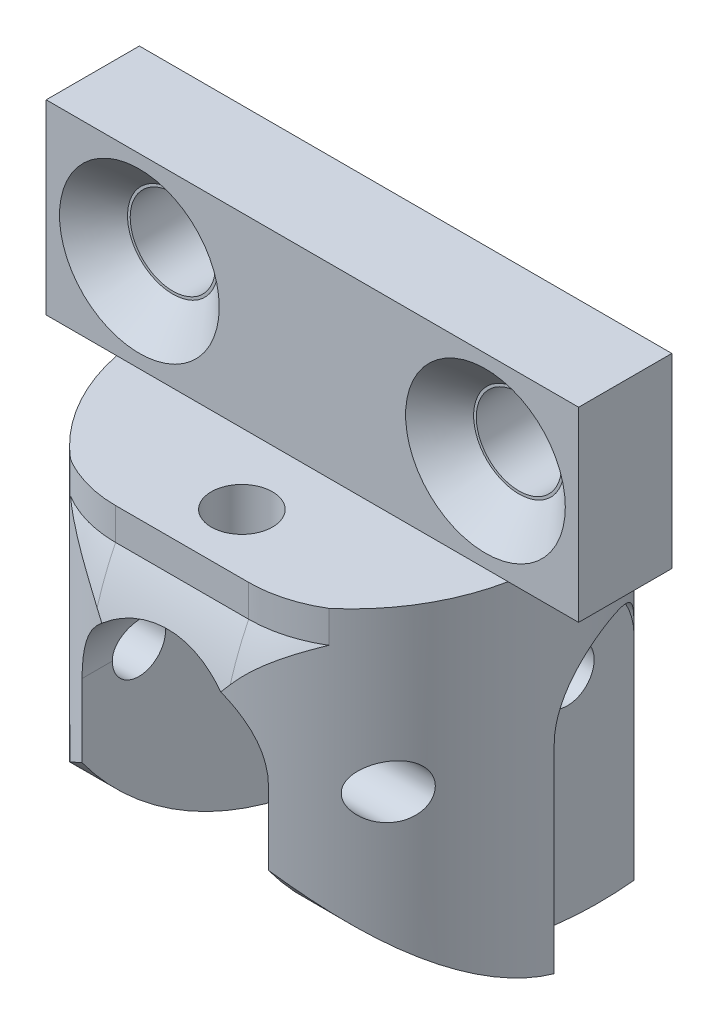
ISO-10303-21;
HEADER;
FILE_DESCRIPTION(('STEP AP214'),'2;1');
FILE_NAME('part.step','',(''),(''),'','','');
FILE_SCHEMA(('AUTOMOTIVE_DESIGN { 1 0 10303 214 1 1 1 1 }'));
ENDSEC;
DATA;
#1=APPLICATION_CONTEXT('core data for automotive mechanical design processes');
#2=APPLICATION_PROTOCOL_DEFINITION('international standard','automotive_design',2000,#1);
#3=PRODUCT_CONTEXT('',#1,'mechanical');
#4=PRODUCT('Part','Part','',(#3));
#5=PRODUCT_RELATED_PRODUCT_CATEGORY('part','',(#4));
#6=PRODUCT_DEFINITION_FORMATION('','',#4);
#7=PRODUCT_DEFINITION_CONTEXT('part definition',#1,'design');
#8=PRODUCT_DEFINITION('design','',#6,#7);
#9=PRODUCT_DEFINITION_SHAPE('','',#8);
#10=(LENGTH_UNIT() NAMED_UNIT(*) SI_UNIT(.MILLI.,.METRE.));
#11=(NAMED_UNIT(*) PLANE_ANGLE_UNIT() SI_UNIT($,.RADIAN.));
#12=(NAMED_UNIT(*) SI_UNIT($,.STERADIAN.) SOLID_ANGLE_UNIT());
#13=UNCERTAINTY_MEASURE_WITH_UNIT(LENGTH_MEASURE(1.E-05),#10,'distance_accuracy_value','');
#14=(GEOMETRIC_REPRESENTATION_CONTEXT(3) GLOBAL_UNCERTAINTY_ASSIGNED_CONTEXT((#13)) GLOBAL_UNIT_ASSIGNED_CONTEXT((#10,
#11,#12)) REPRESENTATION_CONTEXT('',''));
#15=CARTESIAN_POINT('',(0.,0.,0.));
#16=DIRECTION('',(0.,0.,1.));
#17=DIRECTION('',(1.,0.,0.));
#18=AXIS2_PLACEMENT_3D('',#15,#16,#17);
#19=CARTESIAN_POINT('',(0.,0.,0.));
#20=DIRECTION('',(0.,-1.,0.));
#21=DIRECTION('',(0.,0.,-1.));
#22=AXIS2_PLACEMENT_3D('',#19,#20,#21);
#23=CYLINDRICAL_SURFACE('',#22,7.5);
#24=CARTESIAN_POINT('',(0.,5.59999999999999,0.));
#25=DIRECTION('',(-0.866025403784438,0.5,0.));
#26=DIRECTION('',(-0.5,-0.866025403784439,0.));
#27=AXIS2_PLACEMENT_3D('',#24,#25,#26);
#28=ELLIPSE('',#27,15.,7.5);
#29=CARTESIAN_POINT('',(-3.2331615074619,0.,-6.76732344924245));
#30=VERTEX_POINT('',#29);
#31=CARTESIAN_POINT('',(-1.61658075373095,2.8,-7.32370580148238));
#32=VERTEX_POINT('',#31);
#33=EDGE_CURVE('E929',#30,#32,#28,.F.);
#34=ORIENTED_EDGE('',*,*,#33,.F.);
#35=CARTESIAN_POINT('',(0.,-5.6,0.));
#36=DIRECTION('',(-0.866025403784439,-0.5,0.));
#37=DIRECTION('',(0.5,-0.866025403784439,0.));
#38=AXIS2_PLACEMENT_3D('',#35,#36,#37);
#39=ELLIPSE('',#38,15.,7.5);
#40=CARTESIAN_POINT('',(-1.61658075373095,-2.8,-7.32370580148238));
#41=VERTEX_POINT('',#40);
#42=EDGE_CURVE('E964',#30,#41,#39,.T.);
#43=ORIENTED_EDGE('',*,*,#42,.T.);
#44=CARTESIAN_POINT('',(0.,-2.8,0.));
#45=DIRECTION('',(0.,-1.,0.));
#46=DIRECTION('',(0.,0.,-1.));
#47=AXIS2_PLACEMENT_3D('',#44,#45,#46);
#48=CIRCLE('',#47,7.5);
#49=CARTESIAN_POINT('',(1.61658075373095,-2.8,-7.32370580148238));
#50=VERTEX_POINT('',#49);
#51=EDGE_CURVE('E840',#41,#50,#48,.T.);
#52=ORIENTED_EDGE('',*,*,#51,.T.);
#53=CARTESIAN_POINT('',(0.,-5.6,0.));
#54=DIRECTION('',(0.866025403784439,-0.5,0.));
#55=DIRECTION('',(-0.5,-0.866025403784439,0.));
#56=AXIS2_PLACEMENT_3D('',#53,#54,#55);
#57=ELLIPSE('',#56,15.,7.5);
#58=CARTESIAN_POINT('',(3.2331615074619,0.,-6.76732344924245));
#59=VERTEX_POINT('',#58);
#60=EDGE_CURVE('E848',#50,#59,#57,.T.);
#61=ORIENTED_EDGE('',*,*,#60,.T.);
#62=CARTESIAN_POINT('',(0.,5.6,0.));
#63=DIRECTION('',(0.866025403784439,0.5,0.));
#64=DIRECTION('',(0.5,-0.866025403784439,0.));
#65=AXIS2_PLACEMENT_3D('',#62,#63,#64);
#66=ELLIPSE('',#65,15.,7.5);
#67=CARTESIAN_POINT('',(1.61658075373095,2.8,-7.32370580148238));
#68=VERTEX_POINT('',#67);
#69=EDGE_CURVE('E822',#68,#59,#66,.F.);
#70=ORIENTED_EDGE('',*,*,#69,.F.);
#71=CARTESIAN_POINT('',(0.,2.8,0.));
#72=DIRECTION('',(0.,1.,0.));
#73=DIRECTION('',(0.,0.,1.));
#74=AXIS2_PLACEMENT_3D('',#71,#72,#73);
#75=CIRCLE('',#74,7.5);
#76=EDGE_CURVE('E948',#32,#68,#75,.F.);
#77=ORIENTED_EDGE('',*,*,#76,.F.);
#78=EDGE_LOOP('',(#34,#43,#52,#61,#70,#77));
#79=FACE_BOUND('',#78,.T.);
#80=CARTESIAN_POINT('',(6.6332495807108,0.,3.5));
#81=CARTESIAN_POINT('',(6.63324728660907,-0.0509858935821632,3.50000609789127));
#82=CARTESIAN_POINT('',(6.6311845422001,-0.102031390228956,3.50392255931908));
#83=CARTESIAN_POINT('',(6.62296801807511,-0.202687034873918,3.51942706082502));
#84=CARTESIAN_POINT('',(6.61680489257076,-0.252293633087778,3.53103262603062));
#85=CARTESIAN_POINT('',(6.60054926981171,-0.348459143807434,3.56132586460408));
#86=CARTESIAN_POINT('',(6.59046739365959,-0.395025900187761,3.57999439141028));
#87=CARTESIAN_POINT('',(6.5666102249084,-0.484070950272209,3.62356782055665));
#88=CARTESIAN_POINT('',(6.5528363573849,-0.526550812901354,3.6484703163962));
#89=CARTESIAN_POINT('',(6.52134247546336,-0.608008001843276,3.7044779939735));
#90=CARTESIAN_POINT('',(6.50349966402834,-0.646807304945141,3.73577208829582));
#91=CARTESIAN_POINT('',(6.46455981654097,-0.718515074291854,3.80275782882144));
#92=CARTESIAN_POINT('',(6.44346152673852,-0.751421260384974,3.83845116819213));
#93=CARTESIAN_POINT('',(6.39606200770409,-0.814166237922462,3.91697630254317));
#94=CARTESIAN_POINT('',(6.36944711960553,-0.84332069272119,3.9601641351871));
#95=CARTESIAN_POINT('',(6.31332316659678,-0.894011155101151,4.04903918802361));
#96=CARTESIAN_POINT('',(6.2838126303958,-0.915543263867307,4.09472767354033));
#97=CARTESIAN_POINT('',(6.21789267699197,-0.953821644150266,4.19426684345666));
#98=CARTESIAN_POINT('',(6.18110908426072,-0.969385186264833,4.24832343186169));
#99=CARTESIAN_POINT('',(6.10523155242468,-0.991218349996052,4.35666545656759));
#100=CARTESIAN_POINT('',(6.06613653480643,-0.997483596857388,4.4109509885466));
#101=CARTESIAN_POINT('',(5.97955227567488,-1.00159976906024,4.52781335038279));
#102=CARTESIAN_POINT('',(5.93176697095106,-0.99783681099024,4.59022854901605));
#103=CARTESIAN_POINT('',(5.83507842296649,-0.979114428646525,4.71253176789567));
#104=CARTESIAN_POINT('',(5.78617386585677,-0.96414111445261,4.7724165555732));
#105=CARTESIAN_POINT('',(5.68169922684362,-0.920698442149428,4.89650236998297));
#106=CARTESIAN_POINT('',(5.62613717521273,-0.890656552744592,4.9601647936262));
#107=CARTESIAN_POINT('',(5.51714447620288,-0.816896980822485,5.08111371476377));
#108=CARTESIAN_POINT('',(5.46371185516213,-0.773192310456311,5.13840620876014));
#109=CARTESIAN_POINT('',(5.37808479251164,-0.687738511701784,5.2276906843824));
#110=CARTESIAN_POINT('',(5.34451371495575,-0.649733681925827,5.26195744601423));
#111=CARTESIAN_POINT('',(5.2812514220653,-0.566880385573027,5.3254461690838));
#112=CARTESIAN_POINT('',(5.25155346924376,-0.522044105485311,5.35467692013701));
#113=CARTESIAN_POINT('',(5.20450828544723,-0.437129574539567,5.40036133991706));
#114=CARTESIAN_POINT('',(5.18590794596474,-0.398496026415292,5.41819751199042));
#115=CARTESIAN_POINT('',(5.15330318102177,-0.317576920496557,5.44921769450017));
#116=CARTESIAN_POINT('',(5.13929263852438,-0.275296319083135,5.46240789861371));
#117=CARTESIAN_POINT('',(5.11873412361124,-0.194380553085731,5.48167229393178));
#118=CARTESIAN_POINT('',(5.11138823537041,-0.156132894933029,5.48851106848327));
#119=CARTESIAN_POINT('',(5.10152614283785,-0.0784894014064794,5.4976793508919));
#120=CARTESIAN_POINT('',(5.09900700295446,-0.0390942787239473,5.50001159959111));
#121=CARTESIAN_POINT('',(5.09903213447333,0.0397356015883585,5.49998829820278));
#122=CARTESIAN_POINT('',(5.10158200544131,0.0791703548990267,5.49762756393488));
#123=CARTESIAN_POINT('',(5.11151474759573,0.156882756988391,5.48839331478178));
#124=CARTESIAN_POINT('',(5.11889993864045,0.195159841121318,5.48151763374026));
#125=CARTESIAN_POINT('',(5.13787945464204,0.269604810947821,5.46373140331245));
#126=CARTESIAN_POINT('',(5.14946977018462,0.305774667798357,5.45282469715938));
#127=CARTESIAN_POINT('',(5.17609610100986,0.375523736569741,5.42755624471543));
#128=CARTESIAN_POINT('',(5.19113375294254,0.409101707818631,5.41319285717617));
#129=CARTESIAN_POINT('',(5.23316976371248,0.49158258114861,5.37263362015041));
#130=CARTESIAN_POINT('',(5.26213187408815,0.538453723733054,5.34433203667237));
#131=CARTESIAN_POINT('',(5.32441477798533,0.625208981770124,5.2822869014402));
#132=CARTESIAN_POINT('',(5.35774729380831,0.665073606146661,5.24852865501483));
#133=CARTESIAN_POINT('',(5.43933297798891,0.750812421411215,5.16412487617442));
#134=CARTESIAN_POINT('',(5.48871340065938,0.793876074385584,5.11171360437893));
#135=CARTESIAN_POINT('',(5.58975013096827,0.867988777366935,5.00103309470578));
#136=CARTESIAN_POINT('',(5.64140751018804,0.899032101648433,4.9427610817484));
#137=CARTESIAN_POINT('',(5.7460661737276,0.949509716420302,4.82071394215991));
#138=CARTESIAN_POINT('',(5.79907573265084,0.96875016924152,4.75686564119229));
#139=CARTESIAN_POINT('',(5.9041414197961,0.994297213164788,4.62581565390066));
#140=CARTESIAN_POINT('',(5.95619714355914,1.00059843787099,4.55861258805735));
#141=CARTESIAN_POINT('',(6.06126586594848,0.999270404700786,4.41805783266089));
#142=CARTESIAN_POINT('',(6.11412087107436,0.990708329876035,4.34459054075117));
#143=CARTESIAN_POINT('',(6.21529998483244,0.956414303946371,4.19855768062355));
#144=CARTESIAN_POINT('',(6.26363325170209,0.930717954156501,4.12599055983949));
#145=CARTESIAN_POINT('',(6.3400201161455,0.87183127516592,4.00718475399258));
#146=CARTESIAN_POINT('',(6.36975517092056,0.843336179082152,3.95968132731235));
#147=CARTESIAN_POINT('',(6.42542929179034,0.777547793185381,3.86868086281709));
#148=CARTESIAN_POINT('',(6.45137086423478,0.740260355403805,3.82518118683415));
#149=CARTESIAN_POINT('',(6.49891155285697,0.656993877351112,3.74384685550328));
#150=CARTESIAN_POINT('',(6.52048154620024,0.610960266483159,3.70605059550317));
#151=CARTESIAN_POINT('',(6.55839906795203,0.511354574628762,3.63853120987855));
#152=CARTESIAN_POINT('',(6.57474690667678,0.457782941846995,3.6088076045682));
#153=CARTESIAN_POINT('',(6.60007242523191,0.351562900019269,3.56225547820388));
#154=CARTESIAN_POINT('',(6.60969174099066,0.299550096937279,3.54431990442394));
#155=CARTESIAN_POINT('',(6.62415365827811,0.192760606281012,3.51721929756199));
#156=CARTESIAN_POINT('',(6.62901065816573,0.137992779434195,3.50802783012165));
#157=CARTESIAN_POINT('',(6.6326460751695,0.0552834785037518,3.50114345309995));
#158=CARTESIAN_POINT('',(6.63325082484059,0.0276505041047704,3.49999669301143));
#159=CARTESIAN_POINT('',(6.6332495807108,0.,3.5));
#160=B_SPLINE_CURVE_WITH_KNOTS('',3,(#80,#81,#82,#83,#84,#85,#86,#87,#88,#89,#90,#91,#92,#93,
#94,#95,#96,#97,#98,#99,#100,#101,#102,#103,#104,#105,#106,#107,#108,#109,#110,#111,#112,#113,
#114,#115,#116,#117,#118,#119,#120,#121,#122,#123,#124,#125,#126,#127,#128,#129,#130,#131,#132,
#133,#134,#135,#136,#137,#138,#139,#140,#141,#142,#143,#144,#145,#146,#147,#148,#149,#150,#151,
#152,#153,#154,#155,#156,#157,#158,#159),.UNSPECIFIED.,.T.,.F.,(4,2,2,2,2,2,2,2,2,2,2,2,2,2,2,2,
2,2,2,2,2,2,2,2,2,2,2,2,2,2,2,2,2,2,2,2,2,2,2,4),(0.,0.152872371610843,0.306094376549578,
0.458903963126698,0.611654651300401,0.7698314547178,0.928069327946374,1.10291376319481,
1.27784750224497,1.47871508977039,1.67967715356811,1.91484818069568,2.15031107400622,
2.41814796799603,2.6857305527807,2.86877709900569,3.05150085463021,3.19032668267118,
3.32896673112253,3.44707372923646,3.56510887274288,3.68327447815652,3.80149681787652,
3.91960673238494,4.03777283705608,4.22255318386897,4.40783969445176,4.65823367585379,
4.90874678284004,5.1632710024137,5.41790076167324,5.68909376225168,5.95972503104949,
6.14759008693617,6.33533045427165,6.52428314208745,6.7132245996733,6.87989330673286,
7.04605654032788,7.128961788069),.UNSPECIFIED.);
#161=CARTESIAN_POINT('',(6.6332495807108,0.,3.5));
#162=VERTEX_POINT('',#161);
#163=EDGE_CURVE('E538',#162,#162,#160,.T.);
#164=ORIENTED_EDGE('',*,*,#163,.T.);
#165=EDGE_LOOP('',(#164));
#166=FACE_BOUND('',#165,.T.);
#167=CARTESIAN_POINT('',(-6.6332495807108,0.,3.5));
#168=CARTESIAN_POINT('',(-6.63324728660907,0.0509858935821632,3.50000609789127));
#169=CARTESIAN_POINT('',(-6.6311845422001,0.102031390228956,3.50392255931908));
#170=CARTESIAN_POINT('',(-6.62296801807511,0.202687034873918,3.51942706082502));
#171=CARTESIAN_POINT('',(-6.61680489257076,0.252293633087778,3.53103262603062));
#172=CARTESIAN_POINT('',(-6.60054926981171,0.348459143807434,3.56132586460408));
#173=CARTESIAN_POINT('',(-6.59046739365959,0.395025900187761,3.57999439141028));
#174=CARTESIAN_POINT('',(-6.5666102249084,0.484070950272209,3.62356782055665));
#175=CARTESIAN_POINT('',(-6.5528363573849,0.526550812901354,3.6484703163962));
#176=CARTESIAN_POINT('',(-6.52134247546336,0.608008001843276,3.7044779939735));
#177=CARTESIAN_POINT('',(-6.50349966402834,0.646807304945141,3.73577208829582));
#178=CARTESIAN_POINT('',(-6.46455981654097,0.718515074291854,3.80275782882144));
#179=CARTESIAN_POINT('',(-6.44346152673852,0.751421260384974,3.83845116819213));
#180=CARTESIAN_POINT('',(-6.39606200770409,0.814166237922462,3.91697630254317));
#181=CARTESIAN_POINT('',(-6.36944711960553,0.84332069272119,3.9601641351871));
#182=CARTESIAN_POINT('',(-6.31332316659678,0.894011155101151,4.04903918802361));
#183=CARTESIAN_POINT('',(-6.2838126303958,0.915543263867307,4.09472767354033));
#184=CARTESIAN_POINT('',(-6.21789267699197,0.953821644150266,4.19426684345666));
#185=CARTESIAN_POINT('',(-6.18110908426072,0.969385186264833,4.24832343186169));
#186=CARTESIAN_POINT('',(-6.10523155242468,0.991218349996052,4.35666545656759));
#187=CARTESIAN_POINT('',(-6.06613653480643,0.997483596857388,4.4109509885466));
#188=CARTESIAN_POINT('',(-5.97955227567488,1.00159976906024,4.52781335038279));
#189=CARTESIAN_POINT('',(-5.93176697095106,0.99783681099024,4.59022854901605));
#190=CARTESIAN_POINT('',(-5.83507842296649,0.979114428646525,4.71253176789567));
#191=CARTESIAN_POINT('',(-5.78617386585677,0.96414111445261,4.7724165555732));
#192=CARTESIAN_POINT('',(-5.68169922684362,0.920698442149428,4.89650236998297));
#193=CARTESIAN_POINT('',(-5.62613717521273,0.890656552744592,4.9601647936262));
#194=CARTESIAN_POINT('',(-5.51714447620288,0.816896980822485,5.08111371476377));
#195=CARTESIAN_POINT('',(-5.46371185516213,0.773192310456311,5.13840620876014));
#196=CARTESIAN_POINT('',(-5.37808479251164,0.687738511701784,5.2276906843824));
#197=CARTESIAN_POINT('',(-5.34451371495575,0.649733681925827,5.26195744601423));
#198=CARTESIAN_POINT('',(-5.2812514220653,0.566880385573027,5.3254461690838));
#199=CARTESIAN_POINT('',(-5.25155346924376,0.522044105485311,5.35467692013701));
#200=CARTESIAN_POINT('',(-5.20450828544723,0.437129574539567,5.40036133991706));
#201=CARTESIAN_POINT('',(-5.18590794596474,0.398496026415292,5.41819751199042));
#202=CARTESIAN_POINT('',(-5.15330318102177,0.317576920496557,5.44921769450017));
#203=CARTESIAN_POINT('',(-5.13929263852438,0.275296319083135,5.46240789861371));
#204=CARTESIAN_POINT('',(-5.11873412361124,0.194380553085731,5.48167229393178));
#205=CARTESIAN_POINT('',(-5.11138823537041,0.156132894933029,5.48851106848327));
#206=CARTESIAN_POINT('',(-5.10152614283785,0.0784894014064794,5.4976793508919));
#207=CARTESIAN_POINT('',(-5.09900700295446,0.0390942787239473,5.50001159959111));
#208=CARTESIAN_POINT('',(-5.09903213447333,-0.0397356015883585,5.49998829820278));
#209=CARTESIAN_POINT('',(-5.10158200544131,-0.0791703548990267,5.49762756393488));
#210=CARTESIAN_POINT('',(-5.11151474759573,-0.156882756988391,5.48839331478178));
#211=CARTESIAN_POINT('',(-5.11889993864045,-0.195159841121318,5.48151763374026));
#212=CARTESIAN_POINT('',(-5.13787945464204,-0.269604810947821,5.46373140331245));
#213=CARTESIAN_POINT('',(-5.14946977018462,-0.305774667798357,5.45282469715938));
#214=CARTESIAN_POINT('',(-5.17609610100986,-0.375523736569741,5.42755624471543));
#215=CARTESIAN_POINT('',(-5.19113375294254,-0.409101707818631,5.41319285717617));
#216=CARTESIAN_POINT('',(-5.23316976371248,-0.49158258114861,5.37263362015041));
#217=CARTESIAN_POINT('',(-5.26213187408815,-0.538453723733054,5.34433203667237));
#218=CARTESIAN_POINT('',(-5.32441477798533,-0.625208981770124,5.2822869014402));
#219=CARTESIAN_POINT('',(-5.35774729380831,-0.665073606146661,5.24852865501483));
#220=CARTESIAN_POINT('',(-5.43933297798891,-0.750812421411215,5.16412487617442));
#221=CARTESIAN_POINT('',(-5.48871340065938,-0.793876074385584,5.11171360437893));
#222=CARTESIAN_POINT('',(-5.58975013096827,-0.867988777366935,5.00103309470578));
#223=CARTESIAN_POINT('',(-5.64140751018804,-0.899032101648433,4.9427610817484));
#224=CARTESIAN_POINT('',(-5.7460661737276,-0.949509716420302,4.82071394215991));
#225=CARTESIAN_POINT('',(-5.79907573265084,-0.96875016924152,4.75686564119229));
#226=CARTESIAN_POINT('',(-5.9041414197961,-0.994297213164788,4.62581565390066));
#227=CARTESIAN_POINT('',(-5.95619714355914,-1.00059843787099,4.55861258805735));
#228=CARTESIAN_POINT('',(-6.06126586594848,-0.999270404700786,4.41805783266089));
#229=CARTESIAN_POINT('',(-6.11412087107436,-0.990708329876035,4.34459054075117));
#230=CARTESIAN_POINT('',(-6.21529998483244,-0.956414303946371,4.19855768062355));
#231=CARTESIAN_POINT('',(-6.26363325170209,-0.930717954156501,4.12599055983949));
#232=CARTESIAN_POINT('',(-6.3400201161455,-0.87183127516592,4.00718475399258));
#233=CARTESIAN_POINT('',(-6.36975517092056,-0.843336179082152,3.95968132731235));
#234=CARTESIAN_POINT('',(-6.42542929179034,-0.777547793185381,3.86868086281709));
#235=CARTESIAN_POINT('',(-6.45137086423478,-0.740260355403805,3.82518118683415));
#236=CARTESIAN_POINT('',(-6.49891155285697,-0.656993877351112,3.74384685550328));
#237=CARTESIAN_POINT('',(-6.52048154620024,-0.610960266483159,3.70605059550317));
#238=CARTESIAN_POINT('',(-6.55839906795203,-0.511354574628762,3.63853120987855));
#239=CARTESIAN_POINT('',(-6.57474690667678,-0.457782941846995,3.6088076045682));
#240=CARTESIAN_POINT('',(-6.60007242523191,-0.351562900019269,3.56225547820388));
#241=CARTESIAN_POINT('',(-6.60969174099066,-0.299550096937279,3.54431990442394));
#242=CARTESIAN_POINT('',(-6.62415365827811,-0.192760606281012,3.51721929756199));
#243=CARTESIAN_POINT('',(-6.62901065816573,-0.137992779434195,3.50802783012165));
#244=CARTESIAN_POINT('',(-6.6326460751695,-0.0552834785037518,3.50114345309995));
#245=CARTESIAN_POINT('',(-6.63325082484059,-0.0276505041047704,3.49999669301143));
#246=CARTESIAN_POINT('',(-6.6332495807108,0.,3.5));
#247=B_SPLINE_CURVE_WITH_KNOTS('',3,(#167,#168,#169,#170,#171,#172,#173,#174,#175,#176,#177,
#178,#179,#180,#181,#182,#183,#184,#185,#186,#187,#188,#189,#190,#191,#192,#193,#194,#195,#196,
#197,#198,#199,#200,#201,#202,#203,#204,#205,#206,#207,#208,#209,#210,#211,#212,#213,#214,#215,
#216,#217,#218,#219,#220,#221,#222,#223,#224,#225,#226,#227,#228,#229,#230,#231,#232,#233,#234,
#235,#236,#237,#238,#239,#240,#241,#242,#243,#244,#245,#246),.UNSPECIFIED.,.T.,.F.,(4,2,2,2,2,2,
2,2,2,2,2,2,2,2,2,2,2,2,2,2,2,2,2,2,2,2,2,2,2,2,2,2,2,2,2,2,2,2,2,4),(0.,0.152872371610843,
0.306094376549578,0.458903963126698,0.611654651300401,0.7698314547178,0.928069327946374,
1.10291376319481,1.27784750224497,1.47871508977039,1.67967715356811,1.91484818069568,
2.15031107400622,2.41814796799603,2.6857305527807,2.86877709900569,3.05150085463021,
3.19032668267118,3.32896673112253,3.44707372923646,3.56510887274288,3.68327447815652,
3.80149681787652,3.91960673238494,4.03777283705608,4.22255318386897,4.40783969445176,
4.65823367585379,4.90874678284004,5.1632710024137,5.41790076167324,5.68909376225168,
5.95972503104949,6.14759008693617,6.33533045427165,6.52428314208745,6.7132245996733,
6.87989330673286,7.04605654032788,7.128961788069),.UNSPECIFIED.);
#248=CARTESIAN_POINT('',(-6.6332495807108,0.,3.5));
#249=VERTEX_POINT('',#248);
#250=EDGE_CURVE('E544',#249,#249,#247,.T.);
#251=ORIENTED_EDGE('',*,*,#250,.T.);
#252=EDGE_LOOP('',(#251));
#253=FACE_BOUND('',#252,.T.);
#254=CARTESIAN_POINT('',(3.5,-2.74183853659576,6.6332495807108));
#255=CARTESIAN_POINT('',(3.61868374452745,-2.82718449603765,6.57060956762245));
#256=CARTESIAN_POINT('',(3.73485276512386,-2.91399106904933,6.50525774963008));
#257=CARTESIAN_POINT('',(3.96233378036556,-3.08974715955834,6.36926434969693));
#258=CARTESIAN_POINT('',(4.07364672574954,-3.17869625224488,6.29862381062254));
#259=CARTESIAN_POINT('',(4.29165809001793,-3.35801263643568,6.15214625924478));
#260=CARTESIAN_POINT('',(4.39835550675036,-3.44838023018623,6.07630812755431));
#261=CARTESIAN_POINT('',(4.60721122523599,-3.62991319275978,5.91951480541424));
#262=CARTESIAN_POINT('',(4.70936925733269,-3.72107860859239,5.8385593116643));
#263=CARTESIAN_POINT('',(5.01059926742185,-3.99631648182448,5.58683850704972));
#264=CARTESIAN_POINT('',(5.20285651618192,-4.18082156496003,5.40827585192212));
#265=CARTESIAN_POINT('',(5.56878170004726,-4.54718940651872,5.03068052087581));
#266=CARTESIAN_POINT('',(5.74245327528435,-4.72905267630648,4.83165186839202));
#267=CARTESIAN_POINT('',(6.0382202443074,-5.05229824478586,4.45373433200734));
#268=CARTESIAN_POINT('',(6.16378686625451,-5.19469258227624,4.27842264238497));
#269=CARTESIAN_POINT('',(6.40101284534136,-5.47414759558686,3.9146114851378));
#270=CARTESIAN_POINT('',(6.5126734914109,-5.61120876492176,3.72611324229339));
#271=CARTESIAN_POINT('',(6.72045675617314,-5.87801119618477,3.33676607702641));
#272=CARTESIAN_POINT('',(6.81662365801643,-6.00777260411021,3.135954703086));
#273=CARTESIAN_POINT('',(6.992210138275,-6.25876937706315,2.72204061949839));
#274=CARTESIAN_POINT('',(7.07163296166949,-6.38000639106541,2.50894030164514));
#275=CARTESIAN_POINT('',(7.19817495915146,-6.58951163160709,2.11432815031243));
#276=CARTESIAN_POINT('',(7.24857474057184,-6.67958178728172,1.93482039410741));
#277=CARTESIAN_POINT('',(7.33641265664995,-6.85229936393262,1.56919767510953));
#278=CARTESIAN_POINT('',(7.3738534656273,-6.93494831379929,1.38308408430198));
#279=CARTESIAN_POINT('',(7.4347977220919,-7.09202349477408,1.0051893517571));
#280=CARTESIAN_POINT('',(7.45830237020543,-7.16645043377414,0.813408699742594));
#281=CARTESIAN_POINT('',(7.4904578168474,-7.30636808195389,0.425368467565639));
#282=CARTESIAN_POINT('',(7.49910838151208,-7.37185865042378,0.229108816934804));
#283=CARTESIAN_POINT('',(7.50076551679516,-7.49367353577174,-0.167591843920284));
#284=CARTESIAN_POINT('',(7.49367915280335,-7.54994128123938,-0.368050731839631));
#285=CARTESIAN_POINT('',(7.46306441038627,-7.65243548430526,-0.77029103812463));
#286=CARTESIAN_POINT('',(7.43953594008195,-7.69866188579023,-0.972072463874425));
#287=CARTESIAN_POINT('',(7.37569970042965,-7.78090843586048,-1.37500932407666));
#288=CARTESIAN_POINT('',(7.3353963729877,-7.81693128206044,-1.57616491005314));
#289=CARTESIAN_POINT('',(7.23795797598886,-7.8789125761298,-1.97592504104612));
#290=CARTESIAN_POINT('',(7.18082422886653,-7.90487181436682,-2.17452978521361));
#291=CARTESIAN_POINT('',(7.05643638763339,-7.94506183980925,-2.54784506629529));
#292=CARTESIAN_POINT('',(6.99073741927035,-7.96019723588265,-2.72297945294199));
#293=CARTESIAN_POINT('',(6.84620611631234,-7.98314030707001,-3.06830655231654));
#294=CARTESIAN_POINT('',(6.76736936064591,-7.990945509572,-3.23849757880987));
#295=CARTESIAN_POINT('',(6.59711638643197,-7.9998689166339,-3.57256112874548));
#296=CARTESIAN_POINT('',(6.50570468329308,-8.00098951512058,-3.73643589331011));
#297=CARTESIAN_POINT('',(6.3108555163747,-7.99732815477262,-4.05688077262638));
#298=CARTESIAN_POINT('',(6.20741335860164,-7.99254388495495,-4.21344800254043));
#299=CARTESIAN_POINT('',(5.98746325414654,-7.97782435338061,-4.52068008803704));
#300=CARTESIAN_POINT('',(5.87077220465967,-7.96780762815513,-4.67120982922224));
#301=CARTESIAN_POINT('',(5.62642039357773,-7.94355482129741,-4.96282164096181));
#302=CARTESIAN_POINT('',(5.49875492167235,-7.92931692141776,-5.10389960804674));
#303=CARTESIAN_POINT('',(5.23326367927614,-7.89764367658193,-5.37578439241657));
#304=CARTESIAN_POINT('',(5.09543674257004,-7.88020796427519,-5.50659002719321));
#305=CARTESIAN_POINT('',(4.81042297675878,-7.84317642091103,-5.75724338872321));
#306=CARTESIAN_POINT('',(4.66323560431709,-7.82358046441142,-5.87709047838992));
#307=CARTESIAN_POINT('',(4.34755757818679,-7.78156382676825,-6.11481761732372));
#308=CARTESIAN_POINT('',(4.17831628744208,-7.75904417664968,-6.23168496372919));
#309=CARTESIAN_POINT('',(3.83087330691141,-7.71396851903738,-6.45109399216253));
#310=CARTESIAN_POINT('',(3.65267440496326,-7.69141252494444,-6.55364009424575));
#311=CARTESIAN_POINT('',(3.28824964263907,-7.64746583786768,-6.74386242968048));
#312=CARTESIAN_POINT('',(3.10201973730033,-7.62607574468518,-6.83153105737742));
#313=CARTESIAN_POINT('',(2.72284090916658,-7.58561187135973,-6.99131229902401));
#314=CARTESIAN_POINT('',(2.52989459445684,-7.56653720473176,-7.06343087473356));
#315=CARTESIAN_POINT('',(2.13276368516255,-7.53119046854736,-7.19348510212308));
#316=CARTESIAN_POINT('',(1.92841544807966,-7.51501573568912,-7.25094870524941));
#317=CARTESIAN_POINT('',(1.51528789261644,-7.48707283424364,-7.34839742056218));
#318=CARTESIAN_POINT('',(1.30650848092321,-7.47530475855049,-7.38838216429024));
#319=CARTESIAN_POINT('',(0.886152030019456,-7.45684160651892,-7.45049380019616));
#320=CARTESIAN_POINT('',(0.674575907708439,-7.45014490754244,-7.47262640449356));
#321=CARTESIAN_POINT('',(0.250210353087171,-7.44219967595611,-7.49883880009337));
#322=CARTESIAN_POINT('',(0.0374209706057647,-7.4409509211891,-7.50291932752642));
#323=CARTESIAN_POINT('',(-0.379156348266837,-7.44391014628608,-7.49318981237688));
#324=CARTESIAN_POINT('',(-0.582962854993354,-7.44790117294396,-7.48009109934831));
#325=CARTESIAN_POINT('',(-0.988672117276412,-7.46075547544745,-7.43734713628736));
#326=CARTESIAN_POINT('',(-1.19057491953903,-7.4696186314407,-7.40770229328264));
#327=CARTESIAN_POINT('',(-1.59108225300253,-7.49175640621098,-7.33212075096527));
#328=CARTESIAN_POINT('',(-1.78968636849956,-7.5050315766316,-7.28618201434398));
#329=CARTESIAN_POINT('',(-2.18223487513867,-7.53530701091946,-7.17838993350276));
#330=CARTESIAN_POINT('',(-2.37617918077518,-7.55230734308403,-7.11653629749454));
#331=CARTESIAN_POINT('',(-2.75852870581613,-7.58919680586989,-6.97724868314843));
#332=CARTESIAN_POINT('',(-2.94692250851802,-7.60909145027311,-6.89978485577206));
#333=CARTESIAN_POINT('',(-3.31668250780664,-7.65072892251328,-6.72986122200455));
#334=CARTESIAN_POINT('',(-3.49804629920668,-7.67247237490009,-6.637396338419));
#335=CARTESIAN_POINT('',(-3.85262395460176,-7.71667244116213,-6.43806337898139));
#336=CARTESIAN_POINT('',(-4.02583652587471,-7.73912916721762,-6.33119302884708));
#337=CARTESIAN_POINT('',(-4.36305065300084,-7.78354308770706,-6.10370029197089));
#338=CARTESIAN_POINT('',(-4.52705214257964,-7.80550027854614,-5.98307780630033));
#339=CARTESIAN_POINT('',(-4.85134401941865,-7.8485197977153,-5.72357646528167));
#340=CARTESIAN_POINT('',(-5.01120907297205,-7.86950892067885,-5.58415309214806));
#341=CARTESIAN_POINT('',(-5.31871015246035,-7.90813265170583,-5.29209482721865));
#342=CARTESIAN_POINT('',(-5.46635079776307,-7.9257685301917,-5.13946497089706));
#343=CARTESIAN_POINT('',(-5.7483706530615,-7.95625939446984,-4.82196177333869));
#344=CARTESIAN_POINT('',(-5.88275039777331,-7.96911457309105,-4.65708892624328));
#345=CARTESIAN_POINT('',(-6.13717535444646,-7.9886530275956,-4.31628195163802));
#346=CARTESIAN_POINT('',(-6.25722136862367,-7.99533664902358,-4.14034844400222));
#347=CARTESIAN_POINT('',(-6.47806831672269,-8.00113293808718,-3.78508221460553));
#348=CARTESIAN_POINT('',(-6.57939232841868,-8.00050015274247,-3.60607902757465));
#349=CARTESIAN_POINT('',(-6.7669260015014,-7.9912388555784,-3.24051041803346));
#350=CARTESIAN_POINT('',(-6.85313597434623,-7.98261050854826,-3.05394515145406));
#351=CARTESIAN_POINT('',(-7.00973195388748,-7.95650983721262,-2.67500700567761));
#352=CARTESIAN_POINT('',(-7.08012713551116,-7.9390426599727,-2.48263756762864));
#353=CARTESIAN_POINT('',(-7.20470095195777,-7.89463933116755,-2.09378969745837));
#354=CARTESIAN_POINT('',(-7.25888072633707,-7.86770384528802,-1.89731155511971));
#355=CARTESIAN_POINT('',(-7.34704624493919,-7.80662782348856,-1.51841300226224));
#356=CARTESIAN_POINT('',(-7.38232737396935,-7.7732631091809,-1.33616707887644));
#357=CARTESIAN_POINT('',(-7.43913523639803,-7.6981816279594,-0.971265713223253));
#358=CARTESIAN_POINT('',(-7.46066287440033,-7.65646541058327,-0.788610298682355));
#359=CARTESIAN_POINT('',(-7.49021906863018,-7.56479126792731,-0.424290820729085));
#360=CARTESIAN_POINT('',(-7.49824778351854,-7.51483343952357,-0.242626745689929));
#361=CARTESIAN_POINT('',(-7.50123800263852,-7.40695346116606,0.118424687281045));
#362=CARTESIAN_POINT('',(-7.4961990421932,-7.34903102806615,0.297811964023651));
#363=CARTESIAN_POINT('',(-7.47356651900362,-7.22531675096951,0.654091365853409));
#364=CARTESIAN_POINT('',(-7.45590720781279,-7.15948520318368,0.83096545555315));
#365=CARTESIAN_POINT('',(-7.40864737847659,-7.0207295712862,1.18025729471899));
#366=CARTESIAN_POINT('',(-7.37904718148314,-6.94780567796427,1.3526751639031));
#367=CARTESIAN_POINT('',(-7.30864183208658,-6.79545025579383,1.69228648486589));
#368=CARTESIAN_POINT('',(-7.26783498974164,-6.71601774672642,1.85947914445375));
#369=CARTESIAN_POINT('',(-7.1757742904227,-6.55128618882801,2.18800784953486));
#370=CARTESIAN_POINT('',(-7.12451840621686,-6.46598600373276,2.34934275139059));
#371=CARTESIAN_POINT('',(-6.9900789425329,-6.25535982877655,2.72830939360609));
#372=CARTESIAN_POINT('',(-6.90228847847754,-6.12755604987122,2.94294518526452));
#373=CARTESIAN_POINT('',(-6.70966515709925,-5.86356509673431,3.35901627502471));
#374=CARTESIAN_POINT('',(-6.6048270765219,-5.72737536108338,3.56044750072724));
#375=CARTESIAN_POINT('',(-6.37940495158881,-5.44796049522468,3.95019289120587));
#376=CARTESIAN_POINT('',(-6.25877487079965,-5.30471559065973,4.13846613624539));
#377=CARTESIAN_POINT('',(-6.0033339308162,-5.01329894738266,4.50101809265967));
#378=CARTESIAN_POINT('',(-5.86852282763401,-4.86512712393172,4.67529656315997));
#379=CARTESIAN_POINT('',(-5.57164564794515,-4.55072759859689,5.02640539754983));
#380=CARTESIAN_POINT('',(-5.40820247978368,-4.38416744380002,5.20177224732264));
#381=CARTESIAN_POINT('',(-5.06608299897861,-4.04963767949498,5.53551529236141));
#382=CARTESIAN_POINT('',(-4.88740649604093,-3.88166805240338,5.69389127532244));
#383=CARTESIAN_POINT('',(-4.60877204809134,-3.6314664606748,5.91804683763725));
#384=CARTESIAN_POINT('',(-4.51447592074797,-3.54864788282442,5.99029850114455));
#385=CARTESIAN_POINT('',(-4.32210150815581,-3.38380099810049,6.1305471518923));
#386=CARTESIAN_POINT('',(-4.22402341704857,-3.30177265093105,6.19854435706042));
#387=CARTESIAN_POINT('',(-4.02399004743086,-3.1389719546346,6.33023347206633));
#388=CARTESIAN_POINT('',(-3.92203447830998,-3.05819970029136,6.39392505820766));
#389=CARTESIAN_POINT('',(-3.71408264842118,-2.89849131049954,6.51691206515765));
#390=CARTESIAN_POINT('',(-3.60808571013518,-2.81955548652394,6.57620674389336));
#391=CARTESIAN_POINT('',(-3.49999999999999,-2.74183853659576,6.6332495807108));
#392=B_SPLINE_CURVE_WITH_KNOTS('',3,(#254,#255,#256,#257,#258,#259,#260,#261,#262,#263,#264,
#265,#266,#267,#268,#269,#270,#271,#272,#273,#274,#275,#276,#277,#278,#279,#280,#281,#282,#283,
#284,#285,#286,#287,#288,#289,#290,#291,#292,#293,#294,#295,#296,#297,#298,#299,#300,#301,#302,
#303,#304,#305,#306,#307,#308,#309,#310,#311,#312,#313,#314,#315,#316,#317,#318,#319,#320,#321,
#322,#323,#324,#325,#326,#327,#328,#329,#330,#331,#332,#333,#334,#335,#336,#337,#338,#339,#340,
#341,#342,#343,#344,#345,#346,#347,#348,#349,#350,#351,#352,#353,#354,#355,#356,#357,#358,#359,
#360,#361,#362,#363,#364,#365,#366,#367,#368,#369,#370,#371,#372,#373,#374,#375,#376,#377,#378,
#379,#380,#381,#382,#383,#384,#385,#386,#387,#388,#389,#390,#391),.UNSPECIFIED.,.F.,.F.,(4,2,2,
2,2,2,2,2,2,2,2,2,2,2,2,2,2,2,2,2,2,2,2,2,2,2,2,2,2,2,2,2,2,2,2,2,2,2,2,2,2,2,2,2,2,2,2,2,2,2,2,
2,2,2,2,2,2,2,2,2,2,2,2,2,2,2,2,2,4),(0.,0.47703206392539,0.953970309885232,1.43101159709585,
1.90808118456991,2.86910256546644,3.82993537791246,4.60447326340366,5.37893930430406,
6.15115097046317,6.92321284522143,7.54381754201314,8.16429408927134,8.78471717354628,
9.40515002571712,10.0292565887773,10.6533666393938,11.2773115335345,11.9012074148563,
12.463534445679,13.0260510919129,13.5883662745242,14.1509015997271,14.7224681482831,
15.2942812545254,15.8661600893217,16.4380721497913,17.0580721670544,17.6778804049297,
18.2980045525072,18.9178905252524,19.5557562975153,20.1936355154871,20.8313105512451,
21.4689595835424,22.0810214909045,22.6930683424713,23.3051917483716,23.9173263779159,
24.5306428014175,25.1441672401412,25.75778865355,26.3714144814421,27.0101091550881,
27.6485613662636,28.286987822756,28.9253785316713,29.5416276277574,30.1578640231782,
30.7737419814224,31.3895766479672,31.9547067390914,32.5197996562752,33.0848859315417,
33.6499923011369,34.218064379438,34.7861211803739,35.3542636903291,35.9225165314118,
36.7157148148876,37.5091565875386,38.3049651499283,39.1007874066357,39.9755962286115,
40.8504159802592,41.2847645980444,41.7190909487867,42.1534499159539,42.5878820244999),.UNSPECIFIED.);
#393=CARTESIAN_POINT('',(3.5,-2.74183853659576,6.6332495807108));
#394=VERTEX_POINT('',#393);
#395=CARTESIAN_POINT('',(7.49933330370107,-7.47215413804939,-0.0999999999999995));
#396=VERTEX_POINT('',#395);
#397=EDGE_CURVE('E560',#394,#396,#392,.T.);
#398=ORIENTED_EDGE('',*,*,#397,.T.);
#399=DIRECTION('',(0.,-1.,0.));
#400=VECTOR('',#399,1.);
#401=CARTESIAN_POINT('',(7.49933330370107,0.,-0.0999999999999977));
#402=LINE('',#401,#400);
#403=CARTESIAN_POINT('',(7.49933330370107,0.,-0.0999999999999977));
#404=VERTEX_POINT('',#403);
#405=EDGE_CURVE('E307',#396,#404,#402,.F.);
#406=ORIENTED_EDGE('',*,*,#405,.T.);
#407=CARTESIAN_POINT('',(7.49933330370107,0.,-0.0999999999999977));
#408=CARTESIAN_POINT('',(7.49932607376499,0.0701968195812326,-0.099993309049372));
#409=CARTESIAN_POINT('',(7.49929368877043,0.14039049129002,-0.10295653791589));
#410=CARTESIAN_POINT('',(7.49912605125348,0.280277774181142,-0.114771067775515));
#411=CARTESIAN_POINT('',(7.49899080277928,0.349971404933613,-0.123622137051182));
#412=CARTESIAN_POINT('',(7.49856497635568,0.488341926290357,-0.147155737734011));
#413=CARTESIAN_POINT('',(7.49827446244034,0.557019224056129,-0.161835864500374));
#414=CARTESIAN_POINT('',(7.49743501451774,0.692877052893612,-0.196908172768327));
#415=CARTESIAN_POINT('',(7.49688608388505,0.760057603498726,-0.217300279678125));
#416=CARTESIAN_POINT('',(7.4946573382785,0.958715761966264,-0.286882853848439));
#417=CARTESIAN_POINT('',(7.49239559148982,1.08735579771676,-0.344487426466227));
#418=CARTESIAN_POINT('',(7.48490782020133,1.33299315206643,-0.480365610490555));
#419=CARTESIAN_POINT('',(7.47968262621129,1.44999372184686,-0.558633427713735));
#420=CARTESIAN_POINT('',(7.46459921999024,1.66850679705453,-0.733047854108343));
#421=CARTESIAN_POINT('',(7.4547652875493,1.77009681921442,-0.829099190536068));
#422=CARTESIAN_POINT('',(7.42879320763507,1.95554246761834,-1.03629260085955));
#423=CARTESIAN_POINT('',(7.41265537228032,2.03939897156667,-1.14743392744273));
#424=CARTESIAN_POINT('',(7.37306578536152,2.18571803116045,-1.37891824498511));
#425=CARTESIAN_POINT('',(7.34975361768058,2.2485447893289,-1.49905506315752));
#426=CARTESIAN_POINT('',(7.29497046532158,2.3535415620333,-1.74625795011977));
#427=CARTESIAN_POINT('',(7.26350053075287,2.39571423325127,-1.87332312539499));
#428=CARTESIAN_POINT('',(7.19235635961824,2.45901998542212,-2.13020052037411));
#429=CARTESIAN_POINT('',(7.15268912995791,2.48017094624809,-2.26001030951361));
#430=CARTESIAN_POINT('',(7.06572386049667,2.50205477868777,-2.51876903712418));
#431=CARTESIAN_POINT('',(7.01842360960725,2.50278172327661,-2.64771771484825));
#432=CARTESIAN_POINT('',(6.91429703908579,2.48446862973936,-2.90920239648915));
#433=CARTESIAN_POINT('',(6.85707102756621,2.4642481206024,-3.04149429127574));
#434=CARTESIAN_POINT('',(6.73707215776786,2.40398973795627,-3.29879521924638));
#435=CARTESIAN_POINT('',(6.67429778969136,2.36394645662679,-3.4238022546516));
#436=CARTESIAN_POINT('',(6.53775290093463,2.26008535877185,-3.67844818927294));
#437=CARTESIAN_POINT('',(6.4635499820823,2.19405481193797,-3.80695284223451));
#438=CARTESIAN_POINT('',(6.31382955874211,2.04130589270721,-4.05043681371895));
#439=CARTESIAN_POINT('',(6.23831022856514,1.95455624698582,-4.16539529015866));
#440=CARTESIAN_POINT('',(6.08260458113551,1.75237727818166,-4.39002460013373));
#441=CARTESIAN_POINT('',(6.00266912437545,1.63499065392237,-4.49812028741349));
#442=CARTESIAN_POINT('',(5.85223631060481,1.37792796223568,-4.69215812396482));
#443=CARTESIAN_POINT('',(5.7817201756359,1.23829749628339,-4.77814467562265));
#444=CARTESIAN_POINT('',(5.68014861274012,0.99060386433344,-4.89793925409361));
#445=CARTESIAN_POINT('',(5.64389149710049,0.888402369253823,-4.93949935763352));
#446=CARTESIAN_POINT('',(5.58207694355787,0.676644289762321,-5.00925094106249));
#447=CARTESIAN_POINT('',(5.55648563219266,0.567112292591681,-5.03748478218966));
#448=CARTESIAN_POINT('',(5.52689489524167,0.392177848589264,-5.06988007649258));
#449=CARTESIAN_POINT('',(5.51834754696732,0.32844604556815,-5.07916891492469));
#450=CARTESIAN_POINT('',(5.50572747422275,0.199877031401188,-5.0928402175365));
#451=CARTESIAN_POINT('',(5.50166493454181,0.135037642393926,-5.09721151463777));
#452=CARTESIAN_POINT('',(5.5,0.0700105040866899,-5.09901951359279));
#453=B_SPLINE_CURVE_WITH_KNOTS('',3,(#407,#408,#409,#410,#411,#412,#413,#414,#415,#416,#417,
#418,#419,#420,#421,#422,#423,#424,#425,#426,#427,#428,#429,#430,#431,#432,#433,#434,#435,#436,
#437,#438,#439,#440,#441,#442,#443,#444,#445,#446,#447,#448,#449,#450,#451,#452),.UNSPECIFIED.,
.F.,.F.,(4,2,2,2,2,2,2,2,2,2,2,2,2,2,2,2,2,2,2,2,2,2,4),(0.,0.210522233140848,0.421036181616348,
0.631463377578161,0.841887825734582,1.26259871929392,1.68319176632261,2.10159352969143,
2.51997457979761,2.93068153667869,3.34133565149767,3.75164018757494,4.16206379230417,
4.59694402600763,5.031942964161,5.51721300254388,6.00322018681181,6.53602732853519,
7.06775591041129,7.41495222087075,7.76103731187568,7.95562847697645,8.15066064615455),.UNSPECIFIED.);
#454=CARTESIAN_POINT('',(5.5,0.0700105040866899,-5.09901951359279));
#455=VERTEX_POINT('',#454);
#456=EDGE_CURVE('E11',#404,#455,#453,.T.);
#457=ORIENTED_EDGE('',*,*,#456,.T.);
#458=DIRECTION('',(0.,-1.,0.));
#459=VECTOR('',#458,1.);
#460=CARTESIAN_POINT('',(5.5,0.,-5.09901951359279));
#461=LINE('',#460,#459);
#462=CARTESIAN_POINT('',(5.5,-7.92910105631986,-5.09901951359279));
#463=VERTEX_POINT('',#462);
#464=EDGE_CURVE('E286',#463,#455,#461,.F.);
#465=ORIENTED_EDGE('',*,*,#464,.F.);
#466=CARTESIAN_POINT('',(-5.5,-7.92910105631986,-5.09901951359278));
#467=VERTEX_POINT('',#466);
#468=EDGE_CURVE('E79',#463,#467,#392,.T.);
#469=ORIENTED_EDGE('',*,*,#468,.T.);
#470=DIRECTION('',(0.,-1.,0.));
#471=VECTOR('',#470,1.);
#472=CARTESIAN_POINT('',(-5.5,0.,-5.09901951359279));
#473=LINE('',#472,#471);
#474=CARTESIAN_POINT('',(-5.5,0.0700105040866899,-5.09901951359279));
#475=VERTEX_POINT('',#474);
#476=EDGE_CURVE('E329',#475,#467,#473,.T.);
#477=ORIENTED_EDGE('',*,*,#476,.F.);
#478=CARTESIAN_POINT('',(-7.49933330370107,0.,-0.0999999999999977));
#479=CARTESIAN_POINT('',(-7.49932607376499,0.0701968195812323,-0.0999933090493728));
#480=CARTESIAN_POINT('',(-7.49929368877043,0.14039049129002,-0.102956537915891));
#481=CARTESIAN_POINT('',(-7.49912605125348,0.280277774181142,-0.114771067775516));
#482=CARTESIAN_POINT('',(-7.49899080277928,0.349971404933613,-0.123622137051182));
#483=CARTESIAN_POINT('',(-7.49856497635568,0.488341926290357,-0.14715573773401));
#484=CARTESIAN_POINT('',(-7.49827446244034,0.557019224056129,-0.161835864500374));
#485=CARTESIAN_POINT('',(-7.49743501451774,0.692877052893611,-0.196908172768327));
#486=CARTESIAN_POINT('',(-7.49688608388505,0.760057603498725,-0.217300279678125));
#487=CARTESIAN_POINT('',(-7.4946573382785,0.958715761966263,-0.286882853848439));
#488=CARTESIAN_POINT('',(-7.49239559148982,1.08735579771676,-0.344487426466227));
#489=CARTESIAN_POINT('',(-7.48490782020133,1.33299315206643,-0.480365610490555));
#490=CARTESIAN_POINT('',(-7.47968262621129,1.44999372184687,-0.558633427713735));
#491=CARTESIAN_POINT('',(-7.46459921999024,1.66850679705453,-0.733047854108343));
#492=CARTESIAN_POINT('',(-7.4547652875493,1.77009681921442,-0.829099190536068));
#493=CARTESIAN_POINT('',(-7.42879320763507,1.95554246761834,-1.03629260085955));
#494=CARTESIAN_POINT('',(-7.41265537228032,2.03939897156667,-1.14743392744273));
#495=CARTESIAN_POINT('',(-7.37306578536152,2.18571803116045,-1.37891824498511));
#496=CARTESIAN_POINT('',(-7.34975361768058,2.2485447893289,-1.49905506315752));
#497=CARTESIAN_POINT('',(-7.29497046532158,2.3535415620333,-1.74625795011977));
#498=CARTESIAN_POINT('',(-7.26350053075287,2.39571423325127,-1.87332312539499));
#499=CARTESIAN_POINT('',(-7.19235635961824,2.45901998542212,-2.13020052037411));
#500=CARTESIAN_POINT('',(-7.15268912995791,2.48017094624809,-2.26001030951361));
#501=CARTESIAN_POINT('',(-7.06572386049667,2.50205477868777,-2.51876903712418));
#502=CARTESIAN_POINT('',(-7.01842360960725,2.50278172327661,-2.64771771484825));
#503=CARTESIAN_POINT('',(-6.91429703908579,2.48446862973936,-2.90920239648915));
#504=CARTESIAN_POINT('',(-6.85707102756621,2.4642481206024,-3.04149429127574));
#505=CARTESIAN_POINT('',(-6.73707215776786,2.40398973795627,-3.29879521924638));
#506=CARTESIAN_POINT('',(-6.67429778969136,2.36394645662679,-3.4238022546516));
#507=CARTESIAN_POINT('',(-6.53775290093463,2.26008535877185,-3.67844818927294));
#508=CARTESIAN_POINT('',(-6.4635499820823,2.19405481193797,-3.80695284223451));
#509=CARTESIAN_POINT('',(-6.31382955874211,2.04130589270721,-4.05043681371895));
#510=CARTESIAN_POINT('',(-6.23831022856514,1.95455624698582,-4.16539529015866));
#511=CARTESIAN_POINT('',(-6.08260458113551,1.75237727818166,-4.39002460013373));
#512=CARTESIAN_POINT('',(-6.00266912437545,1.63499065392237,-4.49812028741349));
#513=CARTESIAN_POINT('',(-5.85223631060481,1.37792796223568,-4.69215812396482));
#514=CARTESIAN_POINT('',(-5.7817201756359,1.23829749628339,-4.77814467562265));
#515=CARTESIAN_POINT('',(-5.68014861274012,0.990603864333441,-4.89793925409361));
#516=CARTESIAN_POINT('',(-5.64389149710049,0.888402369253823,-4.93949935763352));
#517=CARTESIAN_POINT('',(-5.58207694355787,0.676644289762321,-5.00925094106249));
#518=CARTESIAN_POINT('',(-5.55648563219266,0.567112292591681,-5.03748478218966));
#519=CARTESIAN_POINT('',(-5.52689489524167,0.392177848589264,-5.06988007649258));
#520=CARTESIAN_POINT('',(-5.51834754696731,0.32844604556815,-5.07916891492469));
#521=CARTESIAN_POINT('',(-5.50572747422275,0.199877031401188,-5.0928402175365));
#522=CARTESIAN_POINT('',(-5.50166493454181,0.135037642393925,-5.09721151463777));
#523=CARTESIAN_POINT('',(-5.5,0.0700105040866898,-5.09901951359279));
#524=B_SPLINE_CURVE_WITH_KNOTS('',3,(#478,#479,#480,#481,#482,#483,#484,#485,#486,#487,#488,
#489,#490,#491,#492,#493,#494,#495,#496,#497,#498,#499,#500,#501,#502,#503,#504,#505,#506,#507,
#508,#509,#510,#511,#512,#513,#514,#515,#516,#517,#518,#519,#520,#521,#522,#523),.UNSPECIFIED.,
.F.,.F.,(4,2,2,2,2,2,2,2,2,2,2,2,2,2,2,2,2,2,2,2,2,2,4),(0.,0.210522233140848,0.421036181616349,
0.631463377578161,0.841887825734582,1.26259871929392,1.68319176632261,2.10159352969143,
2.51997457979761,2.93068153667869,3.34133565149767,3.75164018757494,4.16206379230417,
4.59694402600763,5.031942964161,5.51721300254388,6.00322018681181,6.53602732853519,
7.06775591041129,7.41495222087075,7.76103731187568,7.95562847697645,8.15066064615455),.UNSPECIFIED.);
#525=CARTESIAN_POINT('',(-7.49933330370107,0.,-0.0999999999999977));
#526=VERTEX_POINT('',#525);
#527=EDGE_CURVE('E570',#526,#475,#524,.T.);
#528=ORIENTED_EDGE('',*,*,#527,.F.);
#529=DIRECTION('',(0.,-1.,0.));
#530=VECTOR('',#529,1.);
#531=CARTESIAN_POINT('',(-7.49933330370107,0.,-0.0999999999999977));
#532=LINE('',#531,#530);
#533=CARTESIAN_POINT('',(-7.49933330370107,-7.47215413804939,-0.0999999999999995));
#534=VERTEX_POINT('',#533);
#535=EDGE_CURVE('E332',#534,#526,#532,.F.);
#536=ORIENTED_EDGE('',*,*,#535,.F.);
#537=CARTESIAN_POINT('',(-3.5,-2.74183853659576,6.6332495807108));
#538=VERTEX_POINT('',#537);
#539=EDGE_CURVE('E922',#534,#538,#392,.T.);
#540=ORIENTED_EDGE('',*,*,#539,.T.);
#541=DIRECTION('',(0.,-1.,0.));
#542=VECTOR('',#541,1.);
#543=CARTESIAN_POINT('',(-3.5,0.,6.6332495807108));
#544=LINE('',#543,#542);
#545=CARTESIAN_POINT('',(-3.5,0.,6.6332495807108));
#546=VERTEX_POINT('',#545);
#547=EDGE_CURVE('E890',#538,#546,#544,.F.);
#548=ORIENTED_EDGE('',*,*,#547,.T.);
#549=CARTESIAN_POINT('',(-0.869963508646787,3.39015685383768,7.44937336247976));
#550=CARTESIAN_POINT('',(-0.965257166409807,3.36571431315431,7.43825871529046));
#551=CARTESIAN_POINT('',(-1.05929995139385,3.33728863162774,7.42540896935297));
#552=CARTESIAN_POINT('',(-1.24420850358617,3.27284365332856,7.39666405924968));
#553=CARTESIAN_POINT('',(-1.33507605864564,3.23682871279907,7.38077064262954));
#554=CARTESIAN_POINT('',(-1.5127620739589,3.15768597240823,7.34640892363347));
#555=CARTESIAN_POINT('',(-1.59959343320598,3.11458316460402,7.32794970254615));
#556=CARTESIAN_POINT('',(-1.76901509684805,3.0215782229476,7.28890620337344));
#557=CARTESIAN_POINT('',(-1.85160484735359,2.97167520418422,7.26832164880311));
#558=CARTESIAN_POINT('',(-2.09197986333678,2.81254924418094,7.20423476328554));
#559=CARTESIAN_POINT('',(-2.24288600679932,2.69367805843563,7.15829485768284));
#560=CARTESIAN_POINT('',(-2.52309127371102,2.4332567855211,7.06441447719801));
#561=CARTESIAN_POINT('',(-2.65235988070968,2.29167521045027,7.01647129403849));
#562=CARTESIAN_POINT('',(-2.89291514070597,1.98032918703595,6.92088753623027));
#563=CARTESIAN_POINT('',(-3.00284743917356,1.80945314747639,6.87340420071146));
#564=CARTESIAN_POINT('',(-3.14473231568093,1.5398048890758,6.80906454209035));
#565=CARTESIAN_POINT('',(-3.18818297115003,1.44772667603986,6.78877013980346));
#566=CARTESIAN_POINT('',(-3.26706458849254,1.25962977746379,6.75116261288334));
#567=CARTESIAN_POINT('',(-3.30250017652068,1.16361340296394,6.73384776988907));
#568=CARTESIAN_POINT('',(-3.36095472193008,0.980807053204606,6.70484220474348));
#569=CARTESIAN_POINT('',(-3.38498186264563,0.894406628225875,6.69271548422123));
#570=CARTESIAN_POINT('',(-3.42639053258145,0.719658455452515,6.67161039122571));
#571=CARTESIAN_POINT('',(-3.44377333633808,0.63131108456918,6.66263141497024));
#572=CARTESIAN_POINT('',(-3.47175927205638,0.452851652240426,6.64809391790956));
#573=CARTESIAN_POINT('',(-3.48233111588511,0.362733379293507,6.6425511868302));
#574=CARTESIAN_POINT('',(-3.49646110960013,0.181747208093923,6.63511649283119));
#575=CARTESIAN_POINT('',(-3.50001512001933,0.0908788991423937,6.63322668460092));
#576=CARTESIAN_POINT('',(-3.5,0.,6.6332495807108));
#577=B_SPLINE_CURVE_WITH_KNOTS('',3,(#549,#550,#551,#552,#553,#554,#555,#556,#557,#558,#559,
#560,#561,#562,#563,#564,#565,#566,#567,#568,#569,#570,#571,#572,#573,#574,#575,#576),
.UNSPECIFIED.,.F.,.F.,(4,2,2,2,2,2,2,2,2,2,2,2,2,4),(0.,0.296871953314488,0.593573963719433,
0.889251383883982,1.18496731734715,1.77469736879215,2.3652522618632,2.98781500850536,
3.29892687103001,3.60985870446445,3.88104403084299,4.15217731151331,4.42454740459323,
4.69707810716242),.UNSPECIFIED.);
#578=CARTESIAN_POINT('',(-2.2338967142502,2.69438406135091,7.15958835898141));
#579=VERTEX_POINT('',#578);
#580=EDGE_CURVE('E503',#579,#546,#577,.T.);
#581=ORIENTED_EDGE('',*,*,#580,.F.);
#582=CARTESIAN_POINT('',(-2.50000000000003,3.01820276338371,7.07106781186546));
#583=CARTESIAN_POINT('',(-2.40751678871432,2.90550264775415,7.10374274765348));
#584=CARTESIAN_POINT('',(-2.31471540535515,2.79258114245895,7.13452508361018));
#585=CARTESIAN_POINT('',(-2.12847629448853,2.56629535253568,7.19230455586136));
#586=CARTESIAN_POINT('',(-2.03503856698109,2.45293106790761,7.21930169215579));
#587=CARTESIAN_POINT('',(-1.94128266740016,2.3393453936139,7.24440622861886));
#588=B_SPLINE_CURVE_WITH_KNOTS('',3,(#582,#583,#584,#585,#586,#587),.UNSPECIFIED.,.F.,.F.,(4,2,
4),(0.,0.448105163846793,0.896210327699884),.UNSPECIFIED.);
#589=CARTESIAN_POINT('',(-2.49999999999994,3.0182027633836,7.0710678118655));
#590=VERTEX_POINT('',#589);
#591=EDGE_CURVE('E798',#590,#579,#588,.T.);
#592=ORIENTED_EDGE('',*,*,#591,.F.);
#593=CARTESIAN_POINT('',(-1.78424540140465,1.87241937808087,7.28467352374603));
#594=CARTESIAN_POINT('',(-1.84185004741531,2.00050530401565,7.27055805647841));
#595=CARTESIAN_POINT('',(-1.90505903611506,2.12579864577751,7.25435906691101));
#596=CARTESIAN_POINT('',(-2.04140457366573,2.37000475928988,7.21717937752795));
#597=CARTESIAN_POINT('',(-2.11453400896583,2.48892201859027,7.19620209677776));
#598=CARTESIAN_POINT('',(-2.26911553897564,2.7191554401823,7.14895795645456));
#599=CARTESIAN_POINT('',(-2.35052161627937,2.83050844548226,7.12271963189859));
#600=CARTESIAN_POINT('',(-2.52062747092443,3.04585776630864,7.06431341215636));
#601=CARTESIAN_POINT('',(-2.60932822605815,3.14985309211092,7.03214472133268));
#602=CARTESIAN_POINT('',(-2.79241543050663,3.34996036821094,6.96146687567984));
#603=CARTESIAN_POINT('',(-2.88678906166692,3.44608901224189,6.92297169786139));
#604=CARTESIAN_POINT('',(-3.08004345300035,3.63061965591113,6.8391832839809));
#605=CARTESIAN_POINT('',(-3.1789261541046,3.71901827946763,6.79388710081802));
#606=CARTESIAN_POINT('',(-3.37988995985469,3.88810098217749,6.69618077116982));
#607=CARTESIAN_POINT('',(-3.48197384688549,3.96877808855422,6.64376429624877));
#608=CARTESIAN_POINT('',(-3.68791575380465,4.12237395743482,6.53169330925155));
#609=CARTESIAN_POINT('',(-3.79177317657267,4.19529527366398,6.47204119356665));
#610=CARTESIAN_POINT('',(-4.00792407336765,4.3387573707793,6.34064027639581));
#611=CARTESIAN_POINT('',(-4.12026358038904,4.40870483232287,6.2683186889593));
#612=CARTESIAN_POINT('',(-4.3442037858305,4.54003799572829,6.11525075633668));
#613=CARTESIAN_POINT('',(-4.45580445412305,4.60142335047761,6.03450406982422));
#614=CARTESIAN_POINT('',(-4.67699594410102,4.71589249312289,5.86473779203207));
#615=CARTESIAN_POINT('',(-4.78658630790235,4.76897440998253,5.77571634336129));
#616=CARTESIAN_POINT('',(-5.00255928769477,4.86708430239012,5.5896973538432));
#617=CARTESIAN_POINT('',(-5.10894173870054,4.91211186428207,5.49269940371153));
#618=CARTESIAN_POINT('',(-5.3246078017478,4.99720625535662,5.28418060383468));
#619=CARTESIAN_POINT('',(-5.43358842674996,5.03671957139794,5.17211981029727));
#620=CARTESIAN_POINT('',(-5.64553423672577,5.10717251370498,4.93990476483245));
#621=CARTESIAN_POINT('',(-5.74849915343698,5.13811175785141,4.81975015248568));
#622=CARTESIAN_POINT('',(-5.94741482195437,5.19172931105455,4.57203329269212));
#623=CARTESIAN_POINT('',(-6.04336591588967,5.2144080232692,4.44447140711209));
#624=CARTESIAN_POINT('',(-6.22741568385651,5.25181171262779,4.18269028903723));
#625=CARTESIAN_POINT('',(-6.3155141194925,5.26653644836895,4.04847085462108));
#626=CARTESIAN_POINT('',(-6.48608995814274,5.2887060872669,3.76939103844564));
#627=CARTESIAN_POINT('',(-6.56826258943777,5.29587807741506,3.62432263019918));
#628=CARTESIAN_POINT('',(-6.7228168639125,5.30232539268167,3.32889295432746));
#629=CARTESIAN_POINT('',(-6.79519822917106,5.3016004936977,3.17853153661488));
#630=CARTESIAN_POINT('',(-6.92973589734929,5.2925465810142,2.8734254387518));
#631=CARTESIAN_POINT('',(-6.99188633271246,5.28421322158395,2.7186783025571));
#632=CARTESIAN_POINT('',(-7.10561009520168,5.26021086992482,2.40583089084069));
#633=CARTESIAN_POINT('',(-7.15717869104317,5.24453860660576,2.24772915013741));
#634=CARTESIAN_POINT('',(-7.25284860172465,5.20473158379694,1.91775474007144));
#635=CARTESIAN_POINT('',(-7.29614269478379,5.18006783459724,1.74571152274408));
#636=CARTESIAN_POINT('',(-7.37023097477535,5.12291387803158,1.40031508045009));
#637=CARTESIAN_POINT('',(-7.40102971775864,5.09042653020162,1.2269623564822));
#638=CARTESIAN_POINT('',(-7.45019801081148,5.01795620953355,0.880413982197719));
#639=CARTESIAN_POINT('',(-7.4685900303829,4.97798695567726,0.707218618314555));
#640=CARTESIAN_POINT('',(-7.49326190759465,4.89075755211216,0.361886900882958));
#641=CARTESIAN_POINT('',(-7.49954928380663,4.8435019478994,0.189749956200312));
#642=CARTESIAN_POINT('',(-7.4999922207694,4.79085826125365,0.0124834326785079));
#643=CARTESIAN_POINT('',(-7.50000001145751,4.78899925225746,0.00624095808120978));
#644=CARTESIAN_POINT('',(-7.5,4.78713553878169,0.));
#645=B_SPLINE_CURVE_WITH_KNOTS('',3,(#593,#594,#595,#596,#597,#598,#599,#600,#601,#602,#603,
#604,#605,#606,#607,#608,#609,#610,#611,#612,#613,#614,#615,#616,#617,#618,#619,#620,#621,#622,
#623,#624,#625,#626,#627,#628,#629,#630,#631,#632,#633,#634,#635,#636,#637,#638,#639,#640,#641,
#642,#643,#644),.UNSPECIFIED.,.F.,.F.,(4,2,2,2,2,2,2,2,2,2,2,2,2,2,2,2,2,2,2,2,2,2,2,2,2,4),(0.,
0.423245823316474,0.846189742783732,1.26689888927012,1.68766452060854,2.1075127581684,
2.5275434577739,2.94794994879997,3.36821758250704,3.82015006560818,4.27210086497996,
4.72415335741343,5.17622905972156,5.65937025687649,6.14253298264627,6.62567212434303,
7.10882592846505,7.60889482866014,8.10897792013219,8.60934682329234,9.10993896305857,
9.64664918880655,10.1831635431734,10.7187036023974,11.2539109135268,11.2734511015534),.UNSPECIFIED.);
#646=CARTESIAN_POINT('',(-4.85520625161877,4.8,5.71637754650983));
#647=VERTEX_POINT('',#646);
#648=EDGE_CURVE('E799',#590,#647,#645,.T.);
#649=ORIENTED_EDGE('',*,*,#648,.T.);
#650=DIRECTION('',(0.,-1.,0.));
#651=VECTOR('',#650,1.);
#652=CARTESIAN_POINT('',(-4.85520625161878,6.,5.71637754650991));
#653=LINE('',#652,#651);
#654=CARTESIAN_POINT('',(-4.85520625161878,6.,5.71637754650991));
#655=VERTEX_POINT('',#654);
#656=EDGE_CURVE('E677',#655,#647,#653,.T.);
#657=ORIENTED_EDGE('',*,*,#656,.F.);
#658=CARTESIAN_POINT('',(0.,6.,0.));
#659=DIRECTION('',(0.,1.,0.));
#660=DIRECTION('',(0.,0.,1.));
#661=AXIS2_PLACEMENT_3D('',#658,#659,#660);
#662=CIRCLE('',#661,7.50000000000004);
#663=CARTESIAN_POINT('',(-7.3518685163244,6.,1.4832495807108));
#664=VERTEX_POINT('',#663);
#665=EDGE_CURVE('E700',#664,#655,#662,.T.);
#666=ORIENTED_EDGE('',*,*,#665,.F.);
#667=CARTESIAN_POINT('',(-7.49987468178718,6.,0.0433561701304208));
#668=VERTEX_POINT('',#667);
#669=EDGE_CURVE('E1463',#668,#664,#662,.T.);
#670=ORIENTED_EDGE('',*,*,#669,.F.);
#671=DIRECTION('',(0.,-1.,0.));
#672=VECTOR('',#671,1.);
#673=CARTESIAN_POINT('',(-7.49987468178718,6.,0.0433561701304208));
#674=LINE('',#673,#672);
#675=CARTESIAN_POINT('',(-7.49987468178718,4.8,0.0433561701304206));
#676=VERTEX_POINT('',#675);
#677=EDGE_CURVE('E782',#668,#676,#674,.T.);
#678=ORIENTED_EDGE('',*,*,#677,.T.);
#679=CARTESIAN_POINT('',(-7.5,4.78713553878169,0.));
#680=VERTEX_POINT('',#679);
#681=EDGE_CURVE('E795',#676,#680,#645,.T.);
#682=ORIENTED_EDGE('',*,*,#681,.T.);
#683=CARTESIAN_POINT('',(-7.5,4.78713553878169,0.));
#684=CARTESIAN_POINT('',(-7.50000000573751,4.79274209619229,-0.00331503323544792));
#685=CARTESIAN_POINT('',(-7.49999780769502,4.79834589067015,-0.00663494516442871));
#686=CARTESIAN_POINT('',(-7.49965923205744,5.22731459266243,-0.26127129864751));
#687=CARTESIAN_POINT('',(-7.48662559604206,5.63486359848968,-0.540372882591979));
#688=CARTESIAN_POINT('',(-7.41872276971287,6.41421631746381,-1.14206287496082));
#689=CARTESIAN_POINT('',(-7.3637634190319,6.78594104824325,-1.46474376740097));
#690=CARTESIAN_POINT('',(-7.24147689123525,7.29992890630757,-1.9588865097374));
#691=CARTESIAN_POINT('',(-7.19645210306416,7.45866370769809,-2.11901420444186));
#692=CARTESIAN_POINT('',(-7.09265214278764,7.76640996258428,-2.44404396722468));
#693=CARTESIAN_POINT('',(-7.03388233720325,7.91542518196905,-2.60894414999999));
#694=CARTESIAN_POINT('',(-6.90135832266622,8.20280052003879,-2.94164750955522));
#695=CARTESIAN_POINT('',(-6.82762107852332,8.34117245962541,-3.10944720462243));
#696=CARTESIAN_POINT('',(-6.66398332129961,8.60648033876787,-3.44620766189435));
#697=CARTESIAN_POINT('',(-6.57408661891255,8.733418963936,-3.61516814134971));
#698=CARTESIAN_POINT('',(-6.39738370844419,8.95002513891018,-3.91759687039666));
#699=CARTESIAN_POINT('',(-6.3137136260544,9.04200225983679,-4.05124869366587));
#700=CARTESIAN_POINT('',(-6.1352557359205,9.21737104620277,-4.31673564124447));
#701=CARTESIAN_POINT('',(-6.04047030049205,9.30076453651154,-4.44857114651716));
#702=CARTESIAN_POINT('',(-5.83956630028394,9.45829463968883,-4.709197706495));
#703=CARTESIAN_POINT('',(-5.73344468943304,9.53242875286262,-4.83798793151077));
#704=CARTESIAN_POINT('',(-5.50996325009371,9.67061075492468,-5.09104917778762));
#705=CARTESIAN_POINT('',(-5.39260924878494,9.73466382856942,-5.21532249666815));
#706=CARTESIAN_POINT('',(-5.1456913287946,9.85247885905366,-5.459143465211));
#707=CARTESIAN_POINT('',(-5.01602116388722,9.90613629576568,-5.57863440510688));
#708=CARTESIAN_POINT('',(-4.74598240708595,10.0015278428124,-5.81010065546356));
#709=CARTESIAN_POINT('',(-4.6056134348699,10.0432615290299,-5.92207569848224));
#710=CARTESIAN_POINT('',(-4.31526848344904,10.113897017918,-6.13685733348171));
#711=CARTESIAN_POINT('',(-4.16530611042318,10.142816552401,-6.2396764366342));
#712=CARTESIAN_POINT('',(-3.85684879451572,10.1870930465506,-6.43490563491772));
#713=CARTESIAN_POINT('',(-3.69835553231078,10.2024526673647,-6.52731776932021));
#714=CARTESIAN_POINT('',(-3.39760429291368,10.2177198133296,-6.68812920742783));
#715=CARTESIAN_POINT('',(-3.25626412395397,10.2195223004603,-6.75807274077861));
#716=CARTESIAN_POINT('',(-2.96970007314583,10.212265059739,-6.88880858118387));
#717=CARTESIAN_POINT('',(-2.82447693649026,10.2032074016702,-6.94960262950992));
#718=CARTESIAN_POINT('',(-2.53063660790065,10.1738450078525,-7.06191974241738));
#719=CARTESIAN_POINT('',(-2.38200474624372,10.1534761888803,-7.11338774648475));
#720=CARTESIAN_POINT('',(-2.08358979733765,10.1012521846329,-7.20647487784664));
#721=CARTESIAN_POINT('',(-1.93380612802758,10.0693907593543,-7.2480886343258));
#722=CARTESIAN_POINT('',(-1.78424540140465,10.0316964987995,-7.28467352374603));
#723=B_SPLINE_CURVE_WITH_KNOTS('',3,(#683,#684,#685,#686,#687,#688,#689,#690,#691,#692,#693,
#694,#695,#696,#697,#698,#699,#700,#701,#702,#703,#704,#705,#706,#707,#708,#709,#710,#711,#712,
#713,#714,#715,#716,#717,#718,#719,#720,#721,#722),.UNSPECIFIED.,.F.,.F.,(4,2,2,2,2,2,2,2,2,2,2,
2,2,2,2,2,2,2,2,4),(0.,0.0195401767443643,1.49653376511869,2.97671258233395,3.66593491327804,
4.3548885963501,5.04306570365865,5.73108073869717,6.27822052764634,6.82524375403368,
7.37241433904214,7.91930258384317,8.47143251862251,9.0235820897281,9.5749652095,
10.1262400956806,10.5987125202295,11.0710949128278,11.546181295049,12.0215260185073),.UNSPECIFIED.);
#724=CARTESIAN_POINT('',(-7.49999612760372,4.8,-0.00762141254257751));
#725=VERTEX_POINT('',#724);
#726=EDGE_CURVE('E794',#680,#725,#723,.T.);
#727=ORIENTED_EDGE('',*,*,#726,.T.);
#728=DIRECTION('',(0.,-1.,0.));
#729=VECTOR('',#728,1.);
#730=CARTESIAN_POINT('',(-7.49999613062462,6.,-0.00762141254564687));
#731=LINE('',#730,#729);
#732=CARTESIAN_POINT('',(-7.49999613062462,6.,-0.00762141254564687));
#733=VERTEX_POINT('',#732);
#734=EDGE_CURVE('E757',#733,#725,#731,.T.);
#735=ORIENTED_EDGE('',*,*,#734,.F.);
#736=CARTESIAN_POINT('',(0.,6.,0.));
#737=DIRECTION('',(0.,1.,0.));
#738=DIRECTION('',(0.,0.,1.));
#739=AXIS2_PLACEMENT_3D('',#736,#737,#738);
#740=CIRCLE('',#739,7.50000000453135);
#741=CARTESIAN_POINT('',(-7.22376064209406,6.,-2.0167504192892));
#742=VERTEX_POINT('',#741);
#743=EDGE_CURVE('E769',#742,#733,#740,.T.);
#744=ORIENTED_EDGE('',*,*,#743,.F.);
#745=CARTESIAN_POINT('',(7.22376064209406,6.,-2.0167504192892));
#746=VERTEX_POINT('',#745);
#747=EDGE_CURVE('E773',#746,#742,#740,.T.);
#748=ORIENTED_EDGE('',*,*,#747,.F.);
#749=CARTESIAN_POINT('',(7.49999613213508,6.,-0.0076214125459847));
#750=VERTEX_POINT('',#749);
#751=EDGE_CURVE('E775',#750,#746,#740,.T.);
#752=ORIENTED_EDGE('',*,*,#751,.F.);
#753=DIRECTION('',(0.,-1.,0.));
#754=VECTOR('',#753,1.);
#755=CARTESIAN_POINT('',(7.49999613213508,6.,-0.0076214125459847));
#756=LINE('',#755,#754);
#757=CARTESIAN_POINT('',(7.49999613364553,4.8,-0.00762141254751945));
#758=VERTEX_POINT('',#757);
#759=EDGE_CURVE('E750',#750,#758,#756,.T.);
#760=ORIENTED_EDGE('',*,*,#759,.T.);
#761=CARTESIAN_POINT('',(1.78424540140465,10.0316964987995,-7.28467352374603));
#762=CARTESIAN_POINT('',(1.91927456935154,10.0657249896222,-7.2516322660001));
#763=CARTESIAN_POINT('',(2.05449089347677,10.095004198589,-7.21450394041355));
#764=CARTESIAN_POINT('',(2.32413555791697,10.1441812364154,-7.1321901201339));
#765=CARTESIAN_POINT('',(2.45856409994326,10.1640815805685,-7.08700679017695));
#766=CARTESIAN_POINT('',(2.7250206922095,10.1945762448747,-6.98887502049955));
#767=CARTESIAN_POINT('',(2.85705609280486,10.2052067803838,-6.93595775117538));
#768=CARTESIAN_POINT('',(3.1182465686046,10.217501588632,-6.82252174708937));
#769=CARTESIAN_POINT('',(3.24740157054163,10.2191656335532,-6.76200281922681));
#770=CARTESIAN_POINT('',(3.50179538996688,10.2137907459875,-6.63383012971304));
#771=CARTESIAN_POINT('',(3.62703732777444,10.206758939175,-6.56618225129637));
#772=CARTESIAN_POINT('',(3.87295124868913,10.1843130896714,-6.42420540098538));
#773=CARTESIAN_POINT('',(3.99362152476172,10.1688959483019,-6.34987396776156));
#774=CARTESIAN_POINT('',(4.22968283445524,10.1300249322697,-6.19513561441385));
#775=CARTESIAN_POINT('',(4.34507277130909,10.106569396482,-6.11472744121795));
#776=CARTESIAN_POINT('',(4.57003152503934,10.0519928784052,-5.94847758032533));
#777=CARTESIAN_POINT('',(4.67959810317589,10.020868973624,-5.86263383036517));
#778=CARTESIAN_POINT('',(4.89816260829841,9.94948236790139,-5.68147956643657));
#779=CARTESIAN_POINT('',(5.0068134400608,9.90881838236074,-5.58590822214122));
#780=CARTESIAN_POINT('',(5.21679211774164,9.81988450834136,-5.39033382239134));
#781=CARTESIAN_POINT('',(5.31811729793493,9.77161187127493,-5.2903291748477));
#782=CARTESIAN_POINT('',(5.61068954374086,9.61608220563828,-4.98492728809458));
#783=CARTESIAN_POINT('',(5.79066015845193,9.49807117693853,-4.77403565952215));
#784=CARTESIAN_POINT('',(6.143471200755,9.21821730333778,-4.31321152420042));
#785=CARTESIAN_POINT('',(6.31155570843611,9.05251020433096,-4.0620291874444));
#786=CARTESIAN_POINT('',(6.60932187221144,8.69268643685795,-3.55708642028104));
#787=CARTESIAN_POINT('',(6.73896777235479,8.49854356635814,-3.30332381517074));
#788=CARTESIAN_POINT('',(6.93469330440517,8.13779034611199,-2.8639903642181));
#789=CARTESIAN_POINT('',(7.00855849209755,7.97657501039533,-2.67735383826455));
#790=CARTESIAN_POINT('',(7.13835551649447,7.64150295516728,-2.30911024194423));
#791=CARTESIAN_POINT('',(7.19427914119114,7.46764049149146,-2.1275055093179));
#792=CARTESIAN_POINT('',(7.29007708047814,7.10831965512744,-1.7716514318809));
#793=CARTESIAN_POINT('',(7.32994718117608,6.92285825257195,-1.59740402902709));
#794=CARTESIAN_POINT('',(7.39570621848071,6.54115900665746,-1.25831513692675));
#795=CARTESIAN_POINT('',(7.42159349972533,6.34491989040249,-1.09347476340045));
#796=CARTESIAN_POINT('',(7.46269254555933,5.93100512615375,-0.766124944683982));
#797=CARTESIAN_POINT('',(7.47722013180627,5.71274467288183,-0.604270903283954));
#798=CARTESIAN_POINT('',(7.49577062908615,5.26591657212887,-0.29547781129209));
#799=CARTESIAN_POINT('',(7.49980929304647,5.03736490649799,-0.148516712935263));
#800=CARTESIAN_POINT('',(7.49999780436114,4.79834592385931,-0.0066349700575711));
#801=CARTESIAN_POINT('',(7.50000000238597,4.7927421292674,-0.00331505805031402));
#802=CARTESIAN_POINT('',(7.5,4.78713553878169,0.));
#803=B_SPLINE_CURVE_WITH_KNOTS('',3,(#761,#762,#763,#764,#765,#766,#767,#768,#769,#770,#771,
#772,#773,#774,#775,#776,#777,#778,#779,#780,#781,#782,#783,#784,#785,#786,#787,#788,#789,#790,
#791,#792,#793,#794,#795,#796,#797,#798,#799,#800,#801,#802),.UNSPECIFIED.,.F.,.F.,(4,2,2,2,2,2,
2,2,2,2,2,2,2,2,2,2,2,2,2,2,4),(0.,0.429203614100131,0.858292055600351,1.28569652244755,
1.71311184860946,2.1401771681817,2.56740041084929,2.9947119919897,3.42218667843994,
3.87263762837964,4.32325167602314,5.22397221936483,6.25435530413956,7.28569387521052,
8.05707118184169,8.82880105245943,9.6007333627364,10.3727570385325,11.1883076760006,
12.0026327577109,12.0221729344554),.UNSPECIFIED.);
#804=CARTESIAN_POINT('',(7.5,4.78713553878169,0.));
#805=VERTEX_POINT('',#804);
#806=EDGE_CURVE('E837',#758,#805,#803,.T.);
#807=ORIENTED_EDGE('',*,*,#806,.T.);
#808=CARTESIAN_POINT('',(7.5,4.78713553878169,0.));
#809=CARTESIAN_POINT('',(7.50000001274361,4.78899925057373,0.00624095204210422));
#810=CARTESIAN_POINT('',(7.49999222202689,4.79085825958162,0.0124834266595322));
#811=CARTESIAN_POINT('',(7.49952600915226,4.84626390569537,0.19905027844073));
#812=CARTESIAN_POINT('',(7.49255967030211,4.89588807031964,0.38061704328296));
#813=CARTESIAN_POINT('',(7.46515733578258,4.9870285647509,0.744861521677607));
#814=CARTESIAN_POINT('',(7.44471213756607,5.02853933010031,0.927539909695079));
#815=CARTESIAN_POINT('',(7.39001426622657,5.10324402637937,1.29302143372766));
#816=CARTESIAN_POINT('',(7.35572839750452,5.13641764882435,1.47582380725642));
#817=CARTESIAN_POINT('',(7.27326773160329,5.19399352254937,1.83966593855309));
#818=CARTESIAN_POINT('',(7.22509363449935,5.2183962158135,2.02070578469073));
#819=CARTESIAN_POINT('',(7.1156496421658,5.25783511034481,2.37737193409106));
#820=CARTESIAN_POINT('',(7.05454784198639,5.27298266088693,2.55303741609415));
#821=CARTESIAN_POINT('',(6.91922217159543,5.2940055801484,2.8998289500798));
#822=CARTESIAN_POINT('',(6.84499767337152,5.29988050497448,3.07095478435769));
#823=CARTESIAN_POINT('',(6.68403731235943,5.30195613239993,3.40710143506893));
#824=CARTESIAN_POINT('',(6.5973124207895,5.29816527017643,3.57212744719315));
#825=CARTESIAN_POINT('',(6.41207385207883,5.28050344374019,3.89485780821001));
#826=CARTESIAN_POINT('',(6.31356106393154,5.26663323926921,4.05256270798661));
#827=CARTESIAN_POINT('',(6.11280493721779,5.22966580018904,4.34896004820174));
#828=CARTESIAN_POINT('',(6.01126656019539,5.20725738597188,4.48821670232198));
#829=CARTESIAN_POINT('',(5.79984271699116,5.15291613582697,4.75827980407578));
#830=CARTESIAN_POINT('',(5.68995759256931,5.12098368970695,4.88908659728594));
#831=CARTESIAN_POINT('',(5.46306457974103,5.04720594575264,5.14137183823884));
#832=CARTESIAN_POINT('',(5.34605749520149,5.00536176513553,5.26285133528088));
#833=CARTESIAN_POINT('',(5.10632336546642,4.91135487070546,5.49576076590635));
#834=CARTESIAN_POINT('',(4.98359648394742,4.85919245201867,5.60719098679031));
#835=CARTESIAN_POINT('',(4.73941936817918,4.74662048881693,5.81484964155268));
#836=CARTESIAN_POINT('',(4.61814157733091,4.68666259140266,5.91152597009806));
#837=CARTESIAN_POINT('',(4.37343147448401,4.55657439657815,6.09478962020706));
#838=CARTESIAN_POINT('',(4.24999919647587,4.48644425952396,6.18137710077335));
#839=CARTESIAN_POINT('',(4.00272488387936,4.33566726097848,6.34429834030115));
#840=CARTESIAN_POINT('',(3.87888274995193,4.2550176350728,6.42062939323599));
#841=CARTESIAN_POINT('',(3.63278028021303,4.08294851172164,6.56301102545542));
#842=CARTESIAN_POINT('',(3.51051983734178,3.99152974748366,6.62906230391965));
#843=CARTESIAN_POINT('',(3.27450725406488,3.80162262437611,6.74865932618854));
#844=CARTESIAN_POINT('',(3.16061034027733,3.70356266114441,6.80259927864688));
#845=CARTESIAN_POINT('',(2.93819325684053,3.49732192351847,6.90158237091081));
#846=CARTESIAN_POINT('',(2.82967370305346,3.38913999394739,6.9466244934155));
#847=CARTESIAN_POINT('',(2.6203305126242,3.16309988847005,7.02826205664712));
#848=CARTESIAN_POINT('',(2.51948973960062,3.04526455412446,7.06487669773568));
#849=CARTESIAN_POINT('',(2.32732702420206,2.8001837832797,7.13048759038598));
#850=CARTESIAN_POINT('',(2.23599919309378,2.67294425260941,7.1594885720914));
#851=CARTESIAN_POINT('',(2.08131512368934,2.43516289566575,7.20578513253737));
#852=CARTESIAN_POINT('',(2.01596348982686,2.32614352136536,7.22425968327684));
#853=CARTESIAN_POINT('',(1.89361942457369,2.10299063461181,7.2572858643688));
#854=CARTESIAN_POINT('',(1.83662444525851,1.98885869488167,7.27183869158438));
#855=CARTESIAN_POINT('',(1.78424540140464,1.87241937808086,7.28467352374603));
#856=B_SPLINE_CURVE_WITH_KNOTS('',3,(#808,#809,#810,#811,#812,#813,#814,#815,#816,#817,#818,
#819,#820,#821,#822,#823,#824,#825,#826,#827,#828,#829,#830,#831,#832,#833,#834,#835,#836,#837,
#838,#839,#840,#841,#842,#843,#844,#845,#846,#847,#848,#849,#850,#851,#852,#853,#854,#855),
.UNSPECIFIED.,.F.,.F.,(4,2,2,2,2,2,2,2,2,2,2,2,2,2,2,2,2,2,2,2,2,2,2,4),(0.,0.0195401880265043,
0.583851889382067,1.148549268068,1.71460914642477,2.28064049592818,2.83972042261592,
3.39882711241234,3.95744604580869,4.51602287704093,5.03675492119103,5.55746565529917,
6.07811772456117,6.59875490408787,7.09698128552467,7.59519981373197,8.0935495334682,
8.59186534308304,9.07027132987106,9.54873198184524,10.0260915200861,10.5031537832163,
10.8880612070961,11.2728510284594),.UNSPECIFIED.);
#857=CARTESIAN_POINT('',(7.49987468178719,4.79999999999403,0.0433561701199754));
#858=VERTEX_POINT('',#857);
#859=EDGE_CURVE('E859',#805,#858,#856,.T.);
#860=ORIENTED_EDGE('',*,*,#859,.T.);
#861=DIRECTION('',(0.,-1.,0.));
#862=VECTOR('',#861,1.);
#863=CARTESIAN_POINT('',(7.49987468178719,6.,0.0433561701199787));
#864=LINE('',#863,#862);
#865=CARTESIAN_POINT('',(7.49987468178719,6.,0.0433561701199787));
#866=VERTEX_POINT('',#865);
#867=EDGE_CURVE('E745',#866,#858,#864,.T.);
#868=ORIENTED_EDGE('',*,*,#867,.F.);
#869=CARTESIAN_POINT('',(0.,6.,0.));
#870=DIRECTION('',(0.,1.,0.));
#871=DIRECTION('',(0.,0.,1.));
#872=AXIS2_PLACEMENT_3D('',#869,#870,#871);
#873=CIRCLE('',#872,7.49999999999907);
#874=CARTESIAN_POINT('',(7.3518685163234,6.,1.4832495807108));
#875=VERTEX_POINT('',#874);
#876=EDGE_CURVE('E694',#875,#866,#873,.T.);
#877=ORIENTED_EDGE('',*,*,#876,.F.);
#878=CARTESIAN_POINT('',(4.8552062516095,6.,5.7163775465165));
#879=VERTEX_POINT('',#878);
#880=EDGE_CURVE('E699',#879,#875,#873,.T.);
#881=ORIENTED_EDGE('',*,*,#880,.F.);
#882=DIRECTION('',(0.,-1.,0.));
#883=VECTOR('',#882,1.);
#884=CARTESIAN_POINT('',(4.8552062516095,6.,5.7163775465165));
#885=LINE('',#884,#883);
#886=CARTESIAN_POINT('',(4.85520625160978,4.8,5.71637754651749));
#887=VERTEX_POINT('',#886);
#888=EDGE_CURVE('E741',#879,#887,#885,.T.);
#889=ORIENTED_EDGE('',*,*,#888,.T.);
#890=CARTESIAN_POINT('',(2.5,3.01820276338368,7.07106781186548));
#891=VERTEX_POINT('',#890);
#892=EDGE_CURVE('E858',#887,#891,#856,.T.);
#893=ORIENTED_EDGE('',*,*,#892,.T.);
#894=CARTESIAN_POINT('',(1.94128266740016,2.3393453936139,7.24440622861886));
#895=CARTESIAN_POINT('',(2.03503856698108,2.4529310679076,7.21930169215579));
#896=CARTESIAN_POINT('',(2.12847629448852,2.56629535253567,7.19230455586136));
#897=CARTESIAN_POINT('',(2.31471540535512,2.79258114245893,7.13452508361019));
#898=CARTESIAN_POINT('',(2.40751678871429,2.90550264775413,7.1037427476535));
#899=CARTESIAN_POINT('',(2.49999999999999,3.01820276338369,7.0710678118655));
#900=B_SPLINE_CURVE_WITH_KNOTS('',3,(#894,#895,#896,#897,#898,#899),.UNSPECIFIED.,.F.,.F.,(4,2,
4),(0.,0.448105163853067,0.896210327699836),.UNSPECIFIED.);
#901=CARTESIAN_POINT('',(2.23389671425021,2.69438406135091,7.15958835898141));
#902=VERTEX_POINT('',#901);
#903=EDGE_CURVE('E1501',#902,#891,#900,.T.);
#904=ORIENTED_EDGE('',*,*,#903,.F.);
#905=CARTESIAN_POINT('',(3.5,0.,6.6332495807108));
#906=CARTESIAN_POINT('',(3.50001561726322,0.0925710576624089,6.63322539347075));
#907=CARTESIAN_POINT('',(3.49632790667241,0.185128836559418,6.63518679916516));
#908=CARTESIAN_POINT('',(3.48166835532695,0.369459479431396,6.64289921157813));
#909=CARTESIAN_POINT('',(3.47070034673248,0.461232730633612,6.64864822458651));
#910=CARTESIAN_POINT('',(3.44167875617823,0.64285753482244,6.66371502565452));
#911=CARTESIAN_POINT('',(3.42366261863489,0.732716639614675,6.67301394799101));
#912=CARTESIAN_POINT('',(3.38076914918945,0.91036227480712,6.69484707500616));
#913=CARTESIAN_POINT('',(3.35589117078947,0.99814860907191,6.70738158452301));
#914=CARTESIAN_POINT('',(3.27143392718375,1.25722296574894,6.74919955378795));
#915=CARTESIAN_POINT('',(3.20195244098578,1.42471075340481,6.78274109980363));
#916=CARTESIAN_POINT('',(3.0388698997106,1.74579974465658,6.85735187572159));
#917=CARTESIAN_POINT('',(2.94523131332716,1.8993788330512,6.89843279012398));
#918=CARTESIAN_POINT('',(2.72873011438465,2.2001726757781,6.98703535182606));
#919=CARTESIAN_POINT('',(2.60426378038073,2.34615986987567,7.0348072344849));
#920=CARTESIAN_POINT('',(2.33302338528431,2.6160166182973,7.12934454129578));
#921=CARTESIAN_POINT('',(2.18626282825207,2.73989946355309,7.17611055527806));
#922=CARTESIAN_POINT('',(1.9435953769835,2.91267723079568,7.24434369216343));
#923=CARTESIAN_POINT('',(1.85433679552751,2.97031397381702,7.2677636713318));
#924=CARTESIAN_POINT('',(1.67048073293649,3.07746755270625,7.3122109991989));
#925=CARTESIAN_POINT('',(1.57588364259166,3.12698498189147,7.33323852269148));
#926=CARTESIAN_POINT('',(1.38164325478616,3.21754295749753,7.37230582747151));
#927=CARTESIAN_POINT('',(1.28198136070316,3.25854895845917,7.39033337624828));
#928=CARTESIAN_POINT('',(1.07871263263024,3.33137698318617,7.42273936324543));
#929=CARTESIAN_POINT('',(0.975103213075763,3.36319286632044,7.4371153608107));
#930=CARTESIAN_POINT('',(0.869963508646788,3.39015685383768,7.44937336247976));
#931=B_SPLINE_CURVE_WITH_KNOTS('',3,(#905,#906,#907,#908,#909,#910,#911,#912,#913,#914,#915,
#916,#917,#918,#919,#920,#921,#922,#923,#924,#925,#926,#927,#928,#929,#930),.UNSPECIFIED.,.F.,
.F.,(4,2,2,2,2,2,2,2,2,2,2,2,4),(0.,0.277597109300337,0.555048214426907,0.831044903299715,
1.10706760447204,1.65765341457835,2.20909984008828,2.79972832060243,3.39000046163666,
3.71601140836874,4.04199852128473,4.36928391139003,4.69678748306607),.UNSPECIFIED.);
#932=CARTESIAN_POINT('',(3.5,0.,6.6332495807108));
#933=VERTEX_POINT('',#932);
#934=EDGE_CURVE('E493',#933,#902,#931,.T.);
#935=ORIENTED_EDGE('',*,*,#934,.F.);
#936=DIRECTION('',(0.,-1.,0.));
#937=VECTOR('',#936,1.);
#938=CARTESIAN_POINT('',(3.5,0.,6.6332495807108));
#939=LINE('',#938,#937);
#940=EDGE_CURVE('E889',#933,#394,#939,.T.);
#941=ORIENTED_EDGE('',*,*,#940,.T.);
#942=EDGE_LOOP('',(#398,#406,#457,#465,#469,#477,#528,#536,#540,#548,#581,#592,#649,#657,#666,
#670,#678,#682,#727,#735,#744,#748,#752,#760,#807,#860,#868,#877,#881,#889,#893,#904,#935,#941));
#943=FACE_BOUND('',#942,.T.);
#944=ADVANCED_FACE('F48',(#79,#166,#253,#943),#23,.T.);
#945=CARTESIAN_POINT('',(-7.5,4.87987359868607,-3.74945950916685));
#946=DIRECTION('',(1.,0.,0.));
#947=DIRECTION('',(0.,0.,-1.));
#948=AXIS2_PLACEMENT_3D('',#945,#946,#947);
#949=CYLINDRICAL_SURFACE('',#948,12.8798735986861);
#950=CARTESIAN_POINT('',(5.5,4.87987359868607,-3.74945950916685));
#951=DIRECTION('',(1.,0.,0.));
#952=DIRECTION('',(0.,0.,-1.));
#953=AXIS2_PLACEMENT_3D('',#950,#951,#952);
#954=CIRCLE('',#953,12.8798735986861);
#955=CARTESIAN_POINT('',(5.5,-7.47215413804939,-0.0999999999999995));
#956=VERTEX_POINT('',#955);
#957=EDGE_CURVE('E579',#956,#463,#954,.T.);
#958=ORIENTED_EDGE('',*,*,#957,.F.);
#959=DIRECTION('',(1.,0.,0.));
#960=VECTOR('',#959,1.);
#961=CARTESIAN_POINT('',(-7.5,-7.47215413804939,-0.0999999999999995));
#962=LINE('',#961,#960);
#963=EDGE_CURVE('E64',#956,#396,#962,.T.);
#964=ORIENTED_EDGE('',*,*,#963,.T.);
#965=ORIENTED_EDGE('',*,*,#397,.F.);
#966=CARTESIAN_POINT('',(3.5,4.87987359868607,-3.74945950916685));
#967=DIRECTION('',(1.,0.,0.));
#968=DIRECTION('',(0.,1.,0.));
#969=AXIS2_PLACEMENT_3D('',#966,#967,#968);
#970=CIRCLE('',#969,12.8798735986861);
#971=CARTESIAN_POINT('',(3.5,-7.70311556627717,-1.));
#972=VERTEX_POINT('',#971);
#973=EDGE_CURVE('E915',#972,#394,#970,.F.);
#974=ORIENTED_EDGE('',*,*,#973,.F.);
#975=DIRECTION('',(1.,0.,0.));
#976=VECTOR('',#975,1.);
#977=CARTESIAN_POINT('',(-7.5,-7.70311556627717,-1.));
#978=LINE('',#977,#976);
#979=CARTESIAN_POINT('',(-3.5,-7.70311556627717,-1.));
#980=VERTEX_POINT('',#979);
#981=EDGE_CURVE('E925',#972,#980,#978,.F.);
#982=ORIENTED_EDGE('',*,*,#981,.T.);
#983=CARTESIAN_POINT('',(-3.5,4.87987359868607,-3.74945950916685));
#984=DIRECTION('',(-1.,0.,0.));
#985=DIRECTION('',(0.,-1.,0.));
#986=AXIS2_PLACEMENT_3D('',#983,#984,#985);
#987=CIRCLE('',#986,12.8798735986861);
#988=EDGE_CURVE('E830',#538,#980,#987,.F.);
#989=ORIENTED_EDGE('',*,*,#988,.F.);
#990=ORIENTED_EDGE('',*,*,#539,.F.);
#991=DIRECTION('',(1.,0.,0.));
#992=VECTOR('',#991,1.);
#993=CARTESIAN_POINT('',(-7.5,-7.47215413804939,-0.0999999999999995));
#994=LINE('',#993,#992);
#995=CARTESIAN_POINT('',(-5.5,-7.47215413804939,-0.0999999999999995));
#996=VERTEX_POINT('',#995);
#997=EDGE_CURVE('E580',#996,#534,#994,.F.);
#998=ORIENTED_EDGE('',*,*,#997,.F.);
#999=CARTESIAN_POINT('',(-5.5,4.87987359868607,-3.74945950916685));
#1000=DIRECTION('',(-1.,0.,0.));
#1001=DIRECTION('',(0.,0.,1.));
#1002=AXIS2_PLACEMENT_3D('',#999,#1000,#1001);
#1003=CIRCLE('',#1002,12.8798735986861);
#1004=EDGE_CURVE('E1431',#467,#996,#1003,.T.);
#1005=ORIENTED_EDGE('',*,*,#1004,.F.);
#1006=ORIENTED_EDGE('',*,*,#468,.F.);
#1007=EDGE_LOOP('',(#958,#964,#965,#974,#982,#989,#990,#998,#1005,#1006));
#1008=FACE_BOUND('',#1007,.T.);
#1009=ADVANCED_FACE('F550',(#1008),#949,.T.);
#1010=CARTESIAN_POINT('',(-3.72561275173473,6.,6.20812133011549));
#1011=DIRECTION('',(0.,-1.,0.));
#1012=DIRECTION('',(0.,0.,-1.));
#1013=AXIS2_PLACEMENT_3D('',#1010,#1011,#1012);
#1014=PLANE('',#1013);
#1015=DIRECTION('',(-1.,0.,0.));
#1016=VECTOR('',#1015,1.);
#1017=CARTESIAN_POINT('',(-10.,6.,-2.0167504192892));
#1018=LINE('',#1017,#1016);
#1019=EDGE_CURVE('E386',#746,#742,#1018,.T.);
#1020=ORIENTED_EDGE('',*,*,#1019,.F.);
#1021=ORIENTED_EDGE('',*,*,#747,.T.);
#1022=EDGE_LOOP('',(#1020,#1021));
#1023=FACE_BOUND('',#1022,.T.);
#1024=ADVANCED_FACE('F648',(#1023),#1014,.F.);
#1025=CARTESIAN_POINT('',(0.,6.,4.1332495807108));
#1026=DIRECTION('',(0.,1.,0.));
#1027=DIRECTION('',(0.,0.,1.));
#1028=AXIS2_PLACEMENT_3D('',#1025,#1026,#1027);
#1029=CIRCLE('',#1028,1.15);
#1030=CARTESIAN_POINT('',(0.,6.,5.2832495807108));
#1031=VERTEX_POINT('',#1030);
#1032=EDGE_CURVE('E402',#1031,#1031,#1029,.T.);
#1033=ORIENTED_EDGE('',*,*,#1032,.F.);
#1034=EDGE_LOOP('',(#1033));
#1035=FACE_BOUND('',#1034,.T.);
#1036=DIRECTION('',(1.,0.,0.));
#1037=VECTOR('',#1036,1.);
#1038=CARTESIAN_POINT('',(-10.,6.,1.4832495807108));
#1039=LINE('',#1038,#1037);
#1040=EDGE_CURVE('E379',#664,#875,#1039,.T.);
#1041=ORIENTED_EDGE('',*,*,#1040,.F.);
#1042=ORIENTED_EDGE('',*,*,#665,.T.);
#1043=CARTESIAN_POINT('',(-2.5,6.,6.37857230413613));
#1044=CARTESIAN_POINT('',(-2.70597040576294,6.,6.37857230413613));
#1045=CARTESIAN_POINT('',(-2.91133073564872,6.,6.36443581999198));
#1046=CARTESIAN_POINT('',(-3.32082188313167,6.,6.30767298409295));
#1047=CARTESIAN_POINT('',(-3.52646640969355,6.,6.26448513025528));
#1048=CARTESIAN_POINT('',(-4.12390543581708,6.,6.09539372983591));
#1049=CARTESIAN_POINT('',(-4.50021391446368,6.,5.93095533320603));
#1050=CARTESIAN_POINT('',(-4.85520625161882,6.,5.71637754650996));
#1051=B_SPLINE_CURVE_WITH_KNOTS('',3,(#1043,#1044,#1045,#1046,#1047,#1048,#1049,#1050),
.UNSPECIFIED.,.F.,.F.,(4,2,2,4),(0.,0.25,0.5,1.),.UNSPECIFIED.);
#1052=CARTESIAN_POINT('',(-2.5,6.,6.37857230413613));
#1053=VERTEX_POINT('',#1052);
#1054=EDGE_CURVE('E675',#655,#1053,#1051,.F.);
#1055=ORIENTED_EDGE('',*,*,#1054,.T.);
#1056=DIRECTION('',(1.,0.,0.));
#1057=VECTOR('',#1056,1.);
#1058=CARTESIAN_POINT('',(-2.5,6.,6.37857230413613));
#1059=LINE('',#1058,#1057);
#1060=CARTESIAN_POINT('',(2.5,6.,6.37857230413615));
#1061=VERTEX_POINT('',#1060);
#1062=EDGE_CURVE('E681',#1053,#1061,#1059,.T.);
#1063=ORIENTED_EDGE('',*,*,#1062,.T.);
#1064=CARTESIAN_POINT('',(4.8552062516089,6.,5.71637754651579));
#1065=CARTESIAN_POINT('',(4.67877135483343,6.,5.82302494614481));
#1066=CARTESIAN_POINT('',(4.49612044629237,6.,5.9176756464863));
#1067=CARTESIAN_POINT('',(4.11810744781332,6.,6.08244488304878));
#1068=CARTESIAN_POINT('',(3.92121802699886,6.,6.15295105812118));
#1069=CARTESIAN_POINT('',(3.32265513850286,6.,6.32178092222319));
#1070=CARTESIAN_POINT('',(2.9154728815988,6.,6.37857230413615));
#1071=CARTESIAN_POINT('',(2.5,6.,6.37857230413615));
#1072=B_SPLINE_CURVE_WITH_KNOTS('',3,(#1064,#1065,#1066,#1067,#1068,#1069,#1070,#1071),
.UNSPECIFIED.,.F.,.F.,(4,2,2,4),(0.,0.25,0.5,1.),.UNSPECIFIED.);
#1073=EDGE_CURVE('E684',#1061,#879,#1072,.F.);
#1074=ORIENTED_EDGE('',*,*,#1073,.T.);
#1075=ORIENTED_EDGE('',*,*,#880,.T.);
#1076=EDGE_LOOP('',(#1041,#1042,#1055,#1063,#1074,#1075));
#1077=FACE_BOUND('',#1076,.T.);
#1078=ADVANCED_FACE('F652',(#1035,#1077),#1014,.F.);
#1079=CARTESIAN_POINT('',(0.,-15.2,4.1332495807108));
#1080=DIRECTION('',(0.,1.,0.));
#1081=DIRECTION('',(0.,0.,1.));
#1082=AXIS2_PLACEMENT_3D('',#1079,#1080,#1081);
#1083=CYLINDRICAL_SURFACE('',#1082,0.95);
#1084=CARTESIAN_POINT('',(0.,3.49999999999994,5.0832495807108));
#1085=CARTESIAN_POINT('',(0.052336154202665,3.49999924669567,5.08324841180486));
#1086=CARTESIAN_POINT('',(0.104684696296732,3.49881460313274,5.07891024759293));
#1087=CARTESIAN_POINT('',(0.20787150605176,3.49420396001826,5.06170433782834));
#1088=CARTESIAN_POINT('',(0.258709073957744,3.49077693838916,5.04883270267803));
#1089=CARTESIAN_POINT('',(0.357369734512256,3.48205942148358,5.01501086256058));
#1090=CARTESIAN_POINT('',(0.405196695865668,3.47677137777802,4.99407128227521));
#1091=CARTESIAN_POINT('',(0.496660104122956,3.4648893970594,4.94474791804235));
#1092=CARTESIAN_POINT('',(0.540296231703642,3.45829536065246,4.91636356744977));
#1093=CARTESIAN_POINT('',(0.623184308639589,3.44433558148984,4.85223887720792));
#1094=CARTESIAN_POINT('',(0.662321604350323,3.43695627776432,4.81635328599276));
#1095=CARTESIAN_POINT('',(0.734102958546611,3.42234386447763,4.73855514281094));
#1096=CARTESIAN_POINT('',(0.766746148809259,3.41511077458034,4.69664178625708));
#1097=CARTESIAN_POINT('',(0.825177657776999,3.40147040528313,4.60705526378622));
#1098=CARTESIAN_POINT('',(0.85083298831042,3.39508020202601,4.55929251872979));
#1099=CARTESIAN_POINT('',(0.89370352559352,3.38404897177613,4.4599299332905));
#1100=CARTESIAN_POINT('',(0.910920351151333,3.37940760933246,4.40833083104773));
#1101=CARTESIAN_POINT('',(0.93602488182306,3.37253976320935,4.30403256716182));
#1102=CARTESIAN_POINT('',(0.944120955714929,3.37025944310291,4.25138719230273));
#1103=CARTESIAN_POINT('',(0.951403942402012,3.36821110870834,4.14543986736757));
#1104=CARTESIAN_POINT('',(0.950592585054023,3.36844260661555,4.09213804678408));
#1105=CARTESIAN_POINT('',(0.940248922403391,3.37134363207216,3.98802622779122));
#1106=CARTESIAN_POINT('',(0.930969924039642,3.37394234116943,3.9371887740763));
#1107=CARTESIAN_POINT('',(0.904360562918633,3.38117142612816,3.83782081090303));
#1108=CARTESIAN_POINT('',(0.887029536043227,3.38580196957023,3.78929049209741));
#1109=CARTESIAN_POINT('',(0.844604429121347,3.39663445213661,3.69525970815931));
#1110=CARTESIAN_POINT('',(0.819422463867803,3.40285402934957,3.6498010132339));
#1111=CARTESIAN_POINT('',(0.762071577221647,3.41615444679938,3.56366605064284));
#1112=CARTESIAN_POINT('',(0.729901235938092,3.42323546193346,3.52299075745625));
#1113=CARTESIAN_POINT('',(0.658196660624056,3.4377546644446,3.44613133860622));
#1114=CARTESIAN_POINT('',(0.618450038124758,3.44519682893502,3.41014582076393));
#1115=CARTESIAN_POINT('',(0.533394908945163,3.45938521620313,3.34530958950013));
#1116=CARTESIAN_POINT('',(0.488086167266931,3.46613140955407,3.31645917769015));
#1117=CARTESIAN_POINT('',(0.392878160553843,3.47821174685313,3.26662027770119));
#1118=CARTESIAN_POINT('',(0.342958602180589,3.48353920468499,3.24566882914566));
#1119=CARTESIAN_POINT('',(0.240127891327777,3.49213353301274,3.21251339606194));
#1120=CARTESIAN_POINT('',(0.187217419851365,3.4954008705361,3.20030742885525));
#1121=CARTESIAN_POINT('',(0.081600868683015,3.49943574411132,3.18530382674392));
#1122=CARTESIAN_POINT('',(0.0289358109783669,3.50027497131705,3.18223629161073));
#1123=CARTESIAN_POINT('',(-0.076156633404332,3.49956575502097,3.18484975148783));
#1124=CARTESIAN_POINT('',(-0.128584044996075,3.49801756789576,3.19052980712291));
#1125=CARTESIAN_POINT('',(-0.230742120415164,3.49275388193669,3.2102562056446));
#1126=CARTESIAN_POINT('',(-0.280504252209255,3.48907765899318,3.22415103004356));
#1127=CARTESIAN_POINT('',(-0.376985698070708,3.47997586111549,3.25973573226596));
#1128=CARTESIAN_POINT('',(-0.423704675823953,3.47455009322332,3.28142646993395));
#1129=CARTESIAN_POINT('',(-0.513814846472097,3.46238424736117,3.33248132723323));
#1130=CARTESIAN_POINT('',(-0.557120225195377,3.45561993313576,3.36199098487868));
#1131=CARTESIAN_POINT('',(-0.638258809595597,3.44155840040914,3.42766391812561));
#1132=CARTESIAN_POINT('',(-0.676090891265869,3.43426107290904,3.46382855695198));
#1133=CARTESIAN_POINT('',(-0.746353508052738,3.41969057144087,3.54304596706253));
#1134=CARTESIAN_POINT('',(-0.778593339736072,3.41242436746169,3.58626948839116));
#1135=CARTESIAN_POINT('',(-0.835367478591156,3.39897273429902,3.6776677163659));
#1136=CARTESIAN_POINT('',(-0.859902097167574,3.3927872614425,3.72584222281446));
#1137=CARTESIAN_POINT('',(-0.900385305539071,3.38226906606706,3.82554270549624));
#1138=CARTESIAN_POINT('',(-0.916382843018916,3.3779258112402,3.87704763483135));
#1139=CARTESIAN_POINT('',(-0.939448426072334,3.37158456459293,3.9821551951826));
#1140=CARTESIAN_POINT('',(-0.946518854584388,3.369585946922,4.03575726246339));
#1141=CARTESIAN_POINT('',(-0.951388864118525,3.36821386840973,4.141581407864));
#1142=CARTESIAN_POINT('',(-0.949495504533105,3.3687534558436,4.19378843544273));
#1143=CARTESIAN_POINT('',(-0.937206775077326,3.37219265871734,4.29710882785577));
#1144=CARTESIAN_POINT('',(-0.92681163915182,3.37509220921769,4.34822222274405));
#1145=CARTESIAN_POINT('',(-0.897995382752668,3.38287193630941,4.44750231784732));
#1146=CARTESIAN_POINT('',(-0.879641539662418,3.38773548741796,4.49568994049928));
#1147=CARTESIAN_POINT('',(-0.835481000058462,3.39889509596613,4.5883388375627));
#1148=CARTESIAN_POINT('',(-0.809673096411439,3.4051913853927,4.63279950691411));
#1149=CARTESIAN_POINT('',(-0.75041580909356,3.41874613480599,4.7181926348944));
#1150=CARTESIAN_POINT('',(-0.716757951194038,3.42602802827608,4.75897672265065));
#1151=CARTESIAN_POINT('',(-0.643149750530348,3.44060513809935,4.83441770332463));
#1152=CARTESIAN_POINT('',(-0.603197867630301,3.44790035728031,4.86907309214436));
#1153=CARTESIAN_POINT('',(-0.517055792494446,3.46187768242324,4.932037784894));
#1154=CARTESIAN_POINT('',(-0.470745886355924,3.46854238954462,4.96018750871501));
#1155=CARTESIAN_POINT('',(-0.373871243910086,3.48031520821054,5.00825815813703));
#1156=CARTESIAN_POINT('',(-0.32330916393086,3.48542428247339,5.02818417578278));
#1157=CARTESIAN_POINT('',(-0.227471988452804,3.49287811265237,5.05675121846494));
#1158=CARTESIAN_POINT('',(-0.182595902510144,3.49552901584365,5.06666452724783));
#1159=CARTESIAN_POINT('',(-0.0918163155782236,3.49909019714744,5.07991387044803));
#1160=CARTESIAN_POINT('',(-0.0459129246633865,3.50000066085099,5.08325060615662));
#1161=CARTESIAN_POINT('',(0.,3.49999999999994,5.0832495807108));
#1162=B_SPLINE_CURVE_WITH_KNOTS('',3,(#1084,#1085,#1086,#1087,#1088,#1089,#1090,#1091,#1092,
#1093,#1094,#1095,#1096,#1097,#1098,#1099,#1100,#1101,#1102,#1103,#1104,#1105,#1106,#1107,#1108,
#1109,#1110,#1111,#1112,#1113,#1114,#1115,#1116,#1117,#1118,#1119,#1120,#1121,#1122,#1123,#1124,
#1125,#1126,#1127,#1128,#1129,#1130,#1131,#1132,#1133,#1134,#1135,#1136,#1137,#1138,#1139,#1140,
#1141,#1142,#1143,#1144,#1145,#1146,#1147,#1148,#1149,#1150,#1151,#1152,#1153,#1154,#1155,#1156,
#1157,#1158,#1159,#1160,#1161),.UNSPECIFIED.,.T.,.F.,(4,2,2,2,2,2,2,2,2,2,2,2,2,2,2,2,2,2,2,2,2,
2,2,2,2,2,2,2,2,2,2,2,2,2,2,2,2,2,4),(0.,0.156840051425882,0.313751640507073,0.470457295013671,
0.627174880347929,0.787267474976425,0.947381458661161,1.11035802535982,1.27330331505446,
1.43244534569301,1.59155647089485,1.74605850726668,1.90057328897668,2.05688392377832,
2.21322634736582,2.37486042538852,2.53650133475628,2.69889104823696,2.86124393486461,
3.01875176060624,3.17624267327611,3.33091556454,3.48560552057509,3.6434062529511,
3.80123934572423,3.96369611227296,4.12614631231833,4.28765480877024,4.44912018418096,
4.60509529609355,4.76106611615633,4.91574341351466,5.07044577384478,5.2298516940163,
5.3892966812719,5.55231402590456,5.71523027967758,5.85283598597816,5.99042701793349),.UNSPECIFIED.);
#1163=CARTESIAN_POINT('',(0.,3.49999999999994,5.0832495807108));
#1164=VERTEX_POINT('',#1163);
#1165=EDGE_CURVE('E448',#1164,#1164,#1162,.T.);
#1166=ORIENTED_EDGE('',*,*,#1165,.F.);
#1167=EDGE_LOOP('',(#1166));
#1168=FACE_BOUND('',#1167,.T.);
#1169=CARTESIAN_POINT('',(0.,4.3,4.1332495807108));
#1170=DIRECTION('',(0.,1.,0.));
#1171=DIRECTION('',(0.,0.,1.));
#1172=AXIS2_PLACEMENT_3D('',#1169,#1170,#1171);
#1173=CIRCLE('',#1172,0.95);
#1174=CARTESIAN_POINT('',(0.,4.3,5.0832495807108));
#1175=VERTEX_POINT('',#1174);
#1176=EDGE_CURVE('E407',#1175,#1175,#1173,.F.);
#1177=ORIENTED_EDGE('',*,*,#1176,.F.);
#1178=EDGE_LOOP('',(#1177));
#1179=FACE_BOUND('',#1178,.T.);
#1180=ADVANCED_FACE('F432',(#1168,#1179),#1083,.F.);
#1181=CARTESIAN_POINT('',(-2.5,0.,-3.33333333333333));
#1182=DIRECTION('',(1.,0.,0.));
#1183=DIRECTION('',(0.,0.,-1.));
#1184=AXIS2_PLACEMENT_3D('',#1181,#1182,#1183);
#1185=TOROIDAL_SURFACE('',#1184,5.83333333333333,5.);
#1186=CARTESIAN_POINT('',(-7.49860008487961,4.8,-0.231479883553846));
#1187=CARTESIAN_POINT('',(-7.50170476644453,4.8,0.0102434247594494));
#1188=CARTESIAN_POINT('',(-7.49987738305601,4.8,0.25206539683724));
#1189=CARTESIAN_POINT('',(-7.48143269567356,4.8,0.735265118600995));
#1190=CARTESIAN_POINT('',(-7.46481405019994,4.8,0.976642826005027));
#1191=CARTESIAN_POINT('',(-7.4126421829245,4.8,1.45635312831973));
#1192=CARTESIAN_POINT('',(-7.37717345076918,4.8,1.69469448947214));
#1193=CARTESIAN_POINT('',(-7.28391464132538,4.8,2.16698293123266));
#1194=CARTESIAN_POINT('',(-7.22613765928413,4.8,2.4009325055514));
#1195=CARTESIAN_POINT('',(-7.11063213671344,4.8,2.77970295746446));
#1196=CARTESIAN_POINT('',(-7.06013304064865,4.8,2.92674613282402));
#1197=CARTESIAN_POINT('',(-6.94832696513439,4.8,3.21665390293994));
#1198=CARTESIAN_POINT('',(-6.88702272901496,4.8,3.35951954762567));
#1199=CARTESIAN_POINT('',(-6.75322856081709,4.8,3.64014205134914));
#1200=CARTESIAN_POINT('',(-6.68072522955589,4.8,3.77789254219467));
#1201=CARTESIAN_POINT('',(-6.52449375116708,4.8,4.0468985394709));
#1202=CARTESIAN_POINT('',(-6.44076535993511,4.8,4.17815390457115));
#1203=CARTESIAN_POINT('',(-6.26159135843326,4.8,4.43377012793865));
#1204=CARTESIAN_POINT('',(-6.16606959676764,4.8,4.55807775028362));
#1205=CARTESIAN_POINT('',(-5.96411831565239,4.8,4.79749055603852));
#1206=CARTESIAN_POINT('',(-5.85768994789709,4.8,4.91259670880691));
#1207=CARTESIAN_POINT('',(-5.63453960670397,4.8,5.13225868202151));
#1208=CARTESIAN_POINT('',(-5.51782276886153,4.8,5.23681971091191));
#1209=CARTESIAN_POINT('',(-5.27484275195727,4.8,5.43419072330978));
#1210=CARTESIAN_POINT('',(-5.14858063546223,4.8,5.52700201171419));
#1211=CARTESIAN_POINT('',(-4.90007135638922,4.8,5.69139900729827));
#1212=CARTESIAN_POINT('',(-4.77860540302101,4.8,5.76416752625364));
#1213=CARTESIAN_POINT('',(-4.5295712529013,4.8,5.89837265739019));
#1214=CARTESIAN_POINT('',(-4.4020036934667,4.8,5.95981044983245));
#1215=CARTESIAN_POINT('',(-4.14178825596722,4.8,6.07066360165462));
#1216=CARTESIAN_POINT('',(-4.0091418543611,4.8,6.12008242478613));
#1217=CARTESIAN_POINT('',(-3.73982534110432,4.8,6.20635934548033));
#1218=CARTESIAN_POINT('',(-3.60315546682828,4.8,6.2432181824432));
#1219=CARTESIAN_POINT('',(-3.33825895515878,4.8,6.30146955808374));
#1220=CARTESIAN_POINT('',(-3.21025515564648,4.8,6.3238799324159));
#1221=CARTESIAN_POINT('',(-2.9527418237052,4.8,6.35754171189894));
#1222=CARTESIAN_POINT('',(-2.82323181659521,4.8,6.3687894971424));
#1223=CARTESIAN_POINT('',(-2.56380742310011,4.8,6.37999679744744));
#1224=CARTESIAN_POINT('',(-2.4338933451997,4.8,6.37996346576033));
#1225=CARTESIAN_POINT('',(-2.17450948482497,4.8,6.36862472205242));
#1226=CARTESIAN_POINT('',(-2.04503988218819,4.8,6.35731518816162));
#1227=CARTESIAN_POINT('',(-1.79118880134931,4.8,6.32400594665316));
#1228=CARTESIAN_POINT('',(-1.66676658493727,4.8,6.30231560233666));
#1229=CARTESIAN_POINT('',(-1.42013261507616,4.8,6.24858108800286));
#1230=CARTESIAN_POINT('',(-1.29792166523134,4.8,6.21653323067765));
#1231=CARTESIAN_POINT('',(-1.05663184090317,4.8,6.14239320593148));
#1232=CARTESIAN_POINT('',(-0.937551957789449,4.8,6.10030431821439));
#1233=CARTESIAN_POINT('',(-0.703224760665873,4.8,6.00644083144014));
#1234=CARTESIAN_POINT('',(-0.587978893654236,4.8,5.95466262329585));
#1235=CARTESIAN_POINT('',(-0.360700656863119,4.8,5.84119568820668));
#1236=CARTESIAN_POINT('',(-0.248725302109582,4.8,5.77939281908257));
#1237=CARTESIAN_POINT('',(-0.030133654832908,4.8,5.64686757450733));
#1238=CARTESIAN_POINT('',(0.0764806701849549,4.8,5.57614195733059));
#1239=CARTESIAN_POINT('',(0.283656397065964,4.8,5.42643603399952));
#1240=CARTESIAN_POINT('',(0.384220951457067,4.8,5.34746008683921));
#1241=CARTESIAN_POINT('',(0.578885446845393,4.8,5.18185205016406));
#1242=CARTESIAN_POINT('',(0.672983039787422,4.8,5.09521720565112));
#1243=CARTESIAN_POINT('',(0.858964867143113,4.8,4.91032397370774));
#1244=CARTESIAN_POINT('',(0.950482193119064,4.8,4.81169599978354));
#1245=CARTESIAN_POINT('',(1.1255298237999,4.8,4.60757224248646));
#1246=CARTESIAN_POINT('',(1.20905676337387,4.8,4.50207359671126));
#1247=CARTESIAN_POINT('',(1.44733429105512,4.8,4.1763468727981));
#1248=CARTESIAN_POINT('',(1.58977200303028,4.8,3.94689763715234));
#1249=CARTESIAN_POINT('',(1.78475023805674,4.8,3.5770895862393));
#1250=CARTESIAN_POINT('',(1.8490390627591,4.8,3.44267706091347));
#1251=CARTESIAN_POINT('',(1.96754635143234,4.8,3.16944069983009));
#1252=CARTESIAN_POINT('',(2.02176423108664,4.8,3.03061660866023));
#1253=CARTESIAN_POINT('',(2.12031627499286,4.8,2.74983202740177));
#1254=CARTESIAN_POINT('',(2.16466933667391,4.8,2.60787811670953));
#1255=CARTESIAN_POINT('',(2.24412156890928,4.8,2.32138987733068));
#1256=CARTESIAN_POINT('',(2.27921857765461,4.8,2.17685495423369));
#1257=CARTESIAN_POINT('',(2.36114015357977,4.8,1.78954276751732));
#1258=CARTESIAN_POINT('',(2.40032330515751,4.8,1.54513500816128));
#1259=CARTESIAN_POINT('',(2.45830788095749,4.8,1.05394899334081));
#1260=CARTESIAN_POINT('',(2.47709880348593,4.8,0.807169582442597));
#1261=CARTESIAN_POINT('',(2.49881593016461,4.8,0.311855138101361));
#1262=CARTESIAN_POINT('',(2.50166775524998,4.8,0.0633172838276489));
#1263=CARTESIAN_POINT('',(2.49660112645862,4.8,-0.433614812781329));
#1264=CARTESIAN_POINT('',(2.48868045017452,4.8,-0.682009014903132));
#1265=CARTESIAN_POINT('',(2.47052027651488,4.8,-1.11604754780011));
#1266=CARTESIAN_POINT('',(2.46136662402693,4.8,-1.30174557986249));
#1267=CARTESIAN_POINT('',(2.44277828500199,4.8,-1.67312831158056));
#1268=CARTESIAN_POINT('',(2.43334359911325,4.8,-1.858813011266));
#1269=CARTESIAN_POINT('',(2.41646877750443,4.8,-2.23013260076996));
#1270=CARTESIAN_POINT('',(2.40902706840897,4.8,-2.41576741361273));
#1271=CARTESIAN_POINT('',(2.39786733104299,4.8,-2.78714485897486));
#1272=CARTESIAN_POINT('',(2.39414903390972,4.8,-2.97288748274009));
#1273=CARTESIAN_POINT('',(2.39130385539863,4.8,-3.34459765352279));
#1274=CARTESIAN_POINT('',(2.39218159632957,4.8,-3.53056523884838));
#1275=CARTESIAN_POINT('',(2.3983331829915,4.8,-3.90243048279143));
#1276=CARTESIAN_POINT('',(2.40360724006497,4.8,-4.08832813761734));
#1277=CARTESIAN_POINT('',(2.41732330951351,4.8,-4.46016136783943));
#1278=CARTESIAN_POINT('',(2.42576810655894,4.8,-4.64609683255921));
#1279=CARTESIAN_POINT('',(2.44383660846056,4.8,-5.01790595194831));
#1280=CARTESIAN_POINT('',(2.45346032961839,4.8,-5.20377960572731));
#1281=CARTESIAN_POINT('',(2.47662134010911,4.8,-5.68125161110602));
#1282=CARTESIAN_POINT('',(2.48927459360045,4.8,-5.97290275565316));
#1283=CARTESIAN_POINT('',(2.50198506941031,4.8,-6.55655590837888));
#1284=CARTESIAN_POINT('',(2.50204507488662,4.8,-6.84855782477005));
#1285=CARTESIAN_POINT('',(2.48083847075,4.8,-7.42990311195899));
#1286=CARTESIAN_POINT('',(2.45972207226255,4.8,-7.71925072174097));
#1287=CARTESIAN_POINT('',(2.38911794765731,4.8,-8.29451928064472));
#1288=CARTESIAN_POINT('',(2.33965524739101,4.8,-8.58044302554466));
#1289=CARTESIAN_POINT('',(2.23667423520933,4.8,-9.01782562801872));
#1290=CARTESIAN_POINT('',(2.19492043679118,4.8,-9.17208776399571));
#1291=CARTESIAN_POINT('',(2.10045726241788,4.8,-9.47720564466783));
#1292=CARTESIAN_POINT('',(2.04775116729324,4.8,-9.62806239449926));
#1293=CARTESIAN_POINT('',(1.93068249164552,4.8,-9.92576863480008));
#1294=CARTESIAN_POINT('',(1.86628260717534,4.8,-10.0726035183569));
#1295=CARTESIAN_POINT('',(1.72564682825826,4.8,-10.3605173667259));
#1296=CARTESIAN_POINT('',(1.64941074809,4.8,-10.501596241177));
#1297=CARTESIAN_POINT('',(1.48443631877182,4.8,-10.7776591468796));
#1298=CARTESIAN_POINT('',(1.39561134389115,4.8,-10.912591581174));
#1299=CARTESIAN_POINT('',(1.20606454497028,4.8,-11.1738225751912));
#1300=CARTESIAN_POINT('',(1.10534418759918,4.8,-11.3001221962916));
#1301=CARTESIAN_POINT('',(0.892559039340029,4.8,-11.5425060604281));
#1302=CARTESIAN_POINT('',(0.780509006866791,4.8,-11.6586032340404));
#1303=CARTESIAN_POINT('',(0.545636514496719,4.8,-11.8793382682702));
#1304=CARTESIAN_POINT('',(0.422815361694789,4.8,-11.9839775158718));
#1305=CARTESIAN_POINT('',(0.179980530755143,4.8,-12.1707192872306));
#1306=CARTESIAN_POINT('',(0.060892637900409,4.8,-12.2540273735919));
#1307=CARTESIAN_POINT('',(-0.184437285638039,4.8,-12.4093341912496));
#1308=CARTESIAN_POINT('',(-0.310678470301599,4.8,-12.481334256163));
#1309=CARTESIAN_POINT('',(-0.569334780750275,4.8,-12.613205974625));
#1310=CARTESIAN_POINT('',(-0.701749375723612,4.8,-12.6730786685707));
#1311=CARTESIAN_POINT('',(-0.971658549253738,4.8,-12.779998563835));
#1312=CARTESIAN_POINT('',(-1.10915273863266,4.8,-12.8270467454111));
#1313=CARTESIAN_POINT('',(-1.37465462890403,4.8,-12.9038912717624));
#1314=CARTESIAN_POINT('',(-1.50231055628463,4.8,-12.9349079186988));
#1315=CARTESIAN_POINT('',(-1.75988824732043,4.8,-12.9856986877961));
#1316=CARTESIAN_POINT('',(-1.88981072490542,4.8,-13.0054691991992));
#1317=CARTESIAN_POINT('',(-2.15079103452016,4.8,-13.033540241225));
#1318=CARTESIAN_POINT('',(-2.28184795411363,4.8,-13.0418492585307));
#1319=CARTESIAN_POINT('',(-2.54423507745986,4.8,-13.0469415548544));
#1320=CARTESIAN_POINT('',(-2.67556536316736,4.8,-13.0437206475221));
#1321=CARTESIAN_POINT('',(-2.93262829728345,4.8,-13.0261067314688));
#1322=CARTESIAN_POINT('',(-3.05838954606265,4.8,-13.0121279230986));
#1323=CARTESIAN_POINT('',(-3.30833262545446,4.8,-12.9736223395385));
#1324=CARTESIAN_POINT('',(-3.4325138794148,4.8,-12.9490918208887));
#1325=CARTESIAN_POINT('',(-3.67833493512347,4.8,-12.8897221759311));
#1326=CARTESIAN_POINT('',(-3.79997568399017,4.8,-12.8548869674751));
#1327=CARTESIAN_POINT('',(-4.03998223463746,4.8,-12.7752104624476));
#1328=CARTESIAN_POINT('',(-4.15834680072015,4.8,-12.7303654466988));
#1329=CARTESIAN_POINT('',(-4.3915968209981,4.8,-12.6308186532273));
#1330=CARTESIAN_POINT('',(-4.50646045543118,4.8,-12.5760657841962));
#1331=CARTESIAN_POINT('',(-4.73136450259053,4.8,-12.4573338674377));
#1332=CARTESIAN_POINT('',(-4.84140314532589,4.8,-12.3933514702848));
#1333=CARTESIAN_POINT('',(-5.05592120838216,4.8,-12.2567605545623));
#1334=CARTESIAN_POINT('',(-5.16040290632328,4.8,-12.1841556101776));
#1335=CARTESIAN_POINT('',(-5.36332674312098,4.8,-12.0308873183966));
#1336=CARTESIAN_POINT('',(-5.46176668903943,4.8,-11.9502210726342));
#1337=CARTESIAN_POINT('',(-5.65629906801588,4.8,-11.7777716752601));
#1338=CARTESIAN_POINT('',(-5.75209633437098,4.8,-11.685655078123));
#1339=CARTESIAN_POINT('',(-5.93613853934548,4.8,-11.494145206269));
#1340=CARTESIAN_POINT('',(-6.02438027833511,4.8,-11.3947488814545));
#1341=CARTESIAN_POINT('',(-6.2772863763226,4.8,-11.0867432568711));
#1342=CARTESIAN_POINT('',(-6.43020216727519,4.8,-10.8682541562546));
#1343=CARTESIAN_POINT('',(-6.64124497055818,4.8,-10.5153470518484));
#1344=CARTESIAN_POINT('',(-6.71096243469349,4.8,-10.3876004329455));
#1345=CARTESIAN_POINT('',(-6.84066699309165,4.8,-10.1272156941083));
#1346=CARTESIAN_POINT('',(-6.90065361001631,4.8,-9.99457733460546));
#1347=CARTESIAN_POINT('',(-7.01098244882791,4.8,-9.72555650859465));
#1348=CARTESIAN_POINT('',(-7.06133596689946,4.8,-9.58917864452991));
#1349=CARTESIAN_POINT('',(-7.15285044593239,4.8,-9.31335849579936));
#1350=CARTESIAN_POINT('',(-7.19400917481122,4.8,-9.17391547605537));
#1351=CARTESIAN_POINT('',(-7.29386505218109,4.8,-8.79229944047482));
#1352=CARTESIAN_POINT('',(-7.34409301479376,4.8,-8.54788588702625));
#1353=CARTESIAN_POINT('',(-7.42206166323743,4.8,-8.05550543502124));
#1354=CARTESIAN_POINT('',(-7.44978697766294,4.8,-7.80753622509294));
#1355=CARTESIAN_POINT('',(-7.48702071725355,4.8,-7.30904431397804));
#1356=CARTESIAN_POINT('',(-7.49643396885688,4.8,-7.05851503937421));
#1357=CARTESIAN_POINT('',(-7.50186204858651,4.8,-6.55743180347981));
#1358=CARTESIAN_POINT('',(-7.49787786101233,4.8,-6.30687784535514));
#1359=CARTESIAN_POINT('',(-7.48252481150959,4.8,-5.81338192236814));
#1360=CARTESIAN_POINT('',(-7.47137505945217,4.8,-5.57043139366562));
#1361=CARTESIAN_POINT('',(-7.44750734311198,4.8,-5.08461580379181));
#1362=CARTESIAN_POINT('',(-7.43478938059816,4.8,-4.84175074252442));
#1363=CARTESIAN_POINT('',(-7.41840301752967,4.8,-4.47789657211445));
#1364=CARTESIAN_POINT('',(-7.41339803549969,4.8,-4.35697200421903));
#1365=CARTESIAN_POINT('',(-7.4047559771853,4.8,-4.1150749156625));
#1366=CARTESIAN_POINT('',(-7.40111887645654,4.8,-3.99410239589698));
#1367=CARTESIAN_POINT('',(-7.39558161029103,4.8,-3.75213702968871));
#1368=CARTESIAN_POINT('',(-7.39368114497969,4.8,-3.63114419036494));
#1369=CARTESIAN_POINT('',(-7.39180593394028,4.8,-3.38914335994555));
#1370=CARTESIAN_POINT('',(-7.39183118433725,4.8,-3.26813536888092));
#1371=CARTESIAN_POINT('',(-7.39380751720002,4.8,-3.02585467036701));
#1372=CARTESIAN_POINT('',(-7.39576307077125,4.8,-2.90458200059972));
#1373=CARTESIAN_POINT('',(-7.40140912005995,4.8,-2.66207778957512));
#1374=CARTESIAN_POINT('',(-7.40509962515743,4.8,-2.54084624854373));
#1375=CARTESIAN_POINT('',(-7.4138455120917,4.8,-2.29840705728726));
#1376=CARTESIAN_POINT('',(-7.41890119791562,4.8,-2.17719941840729));
#1377=CARTESIAN_POINT('',(-7.42986471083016,4.8,-1.93482207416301));
#1378=CARTESIAN_POINT('',(-7.4357725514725,4.8,-1.81365236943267));
#1379=CARTESIAN_POINT('',(-7.45392758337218,4.8,-1.44908307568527));
#1380=CARTESIAN_POINT('',(-7.46655701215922,4.8,-1.20570330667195));
#1381=CARTESIAN_POINT('',(-7.48732812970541,4.8,-0.718742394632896));
#1382=CARTESIAN_POINT('',(-7.49547025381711,4.8,-0.475161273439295));
#1383=CARTESIAN_POINT('',(-7.49860008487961,4.8,-0.231479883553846));
#1384=B_SPLINE_CURVE_WITH_KNOTS('',3,(#1186,#1187,#1188,#1189,#1190,#1191,#1192,#1193,#1194,
#1195,#1196,#1197,#1198,#1199,#1200,#1201,#1202,#1203,#1204,#1205,#1206,#1207,#1208,#1209,#1210,
#1211,#1212,#1213,#1214,#1215,#1216,#1217,#1218,#1219,#1220,#1221,#1222,#1223,#1224,#1225,#1226,
#1227,#1228,#1229,#1230,#1231,#1232,#1233,#1234,#1235,#1236,#1237,#1238,#1239,#1240,#1241,#1242,
#1243,#1244,#1245,#1246,#1247,#1248,#1249,#1250,#1251,#1252,#1253,#1254,#1255,#1256,#1257,#1258,
#1259,#1260,#1261,#1262,#1263,#1264,#1265,#1266,#1267,#1268,#1269,#1270,#1271,#1272,#1273,#1274,
#1275,#1276,#1277,#1278,#1279,#1280,#1281,#1282,#1283,#1284,#1285,#1286,#1287,#1288,#1289,#1290,
#1291,#1292,#1293,#1294,#1295,#1296,#1297,#1298,#1299,#1300,#1301,#1302,#1303,#1304,#1305,#1306,
#1307,#1308,#1309,#1310,#1311,#1312,#1313,#1314,#1315,#1316,#1317,#1318,#1319,#1320,#1321,#1322,
#1323,#1324,#1325,#1326,#1327,#1328,#1329,#1330,#1331,#1332,#1333,#1334,#1335,#1336,#1337,#1338,
#1339,#1340,#1341,#1342,#1343,#1344,#1345,#1346,#1347,#1348,#1349,#1350,#1351,#1352,#1353,#1354,
#1355,#1356,#1357,#1358,#1359,#1360,#1361,#1362,#1363,#1364,#1365,#1366,#1367,#1368,#1369,#1370,
#1371,#1372,#1373,#1374,#1375,#1376,#1377,#1378,#1379,#1380,#1381,#1382,#1383),.UNSPECIFIED.,
.T.,.F.,(4,2,2,2,2,2,2,2,2,2,2,2,2,2,2,2,2,2,2,2,2,2,2,2,2,2,2,2,2,2,2,2,2,2,2,2,2,2,2,2,2,2,2,
2,2,2,2,2,2,2,2,2,2,2,2,2,2,2,2,2,2,2,2,2,2,2,2,2,2,2,2,2,2,2,2,2,2,2,2,2,2,2,2,2,2,2,2,2,2,2,2,
2,2,2,2,2,2,2,4),(0.,0.72517770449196,1.45042118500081,2.17244106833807,2.8940377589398,
3.36007952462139,3.82600313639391,4.29248858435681,4.7589841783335,5.22866720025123,
5.69830067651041,6.16770104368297,6.63704923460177,7.06127014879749,7.48544684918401,
7.90950116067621,8.3335305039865,8.72290462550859,9.11240497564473,9.50165834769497,
9.89105405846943,10.2695063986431,10.6480936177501,11.0265573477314,11.4051623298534,
11.788427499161,12.1718323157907,12.5550355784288,12.9383772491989,13.3415686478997,
13.7449291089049,14.5516903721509,14.9983606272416,15.4450567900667,15.890889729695,
16.3368267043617,17.0782818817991,17.8201187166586,18.5654144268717,19.3108639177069,
19.8686365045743,20.4264078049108,20.9837374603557,21.541026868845,22.0988768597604,
22.6567536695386,23.2151215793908,23.7734972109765,24.6491971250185,25.524703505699,
26.3940432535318,27.2626166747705,27.7417059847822,28.2206519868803,28.7011535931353,
29.1816627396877,29.6656552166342,30.1495880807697,30.6328984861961,31.1161503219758,
31.5515612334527,31.986920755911,32.4222429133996,32.8575317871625,33.2511533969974,
33.6449013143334,34.0383575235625,34.4319566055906,34.8111159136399,35.1904098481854,
35.5695597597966,35.9488507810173,36.3301564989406,36.7116009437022,37.0928878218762,
37.474312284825,37.8725642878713,38.2709841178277,39.0675426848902,39.5038229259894,
39.940124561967,40.3759113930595,40.8118038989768,41.5590194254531,42.3067449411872,
43.058346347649,43.809892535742,44.539485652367,45.2690779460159,45.6321560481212,
45.995227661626,46.3582365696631,46.7212447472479,47.0850957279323,47.4489486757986,
47.812882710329,48.1768225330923,48.9079454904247,49.6389975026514),.UNSPECIFIED.);
#1385=EDGE_CURVE('E463',#725,#676,#1384,.T.);
#1386=ORIENTED_EDGE('',*,*,#1385,.F.);
#1387=ORIENTED_EDGE('',*,*,#726,.F.);
#1388=ORIENTED_EDGE('',*,*,#681,.F.);
#1389=EDGE_LOOP('',(#1386,#1387,#1388));
#1390=FACE_BOUND('',#1389,.T.);
#1391=ADVANCED_FACE('F1103',(#1390),#1185,.T.);
#1392=CARTESIAN_POINT('',(2.5,0.,-3.33333333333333));
#1393=DIRECTION('',(1.,0.,0.));
#1394=DIRECTION('',(0.,0.,-1.));
#1395=AXIS2_PLACEMENT_3D('',#1392,#1393,#1394);
#1396=TOROIDAL_SURFACE('',#1395,5.83333333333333,5.);
#1397=CARTESIAN_POINT('',(2.5,4.8,6.37857230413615));
#1398=CARTESIAN_POINT('',(2.9154728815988,4.8,6.37857230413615));
#1399=CARTESIAN_POINT('',(3.32265513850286,4.8,6.32178092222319));
#1400=CARTESIAN_POINT('',(3.92121802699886,4.8,6.15295105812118));
#1401=CARTESIAN_POINT('',(4.11810744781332,4.8,6.08244488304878));
#1402=CARTESIAN_POINT('',(4.49612044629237,4.8,5.9176756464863));
#1403=CARTESIAN_POINT('',(4.67877135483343,4.8,5.82302494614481));
#1404=CARTESIAN_POINT('',(4.8552062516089,4.8,5.71637754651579));
#1405=B_SPLINE_CURVE_WITH_KNOTS('',3,(#1397,#1398,#1399,#1400,#1401,#1402,#1403,#1404),
.UNSPECIFIED.,.F.,.F.,(4,2,2,4),(0.,0.5,0.75,1.),.UNSPECIFIED.);
#1406=CARTESIAN_POINT('',(2.5,4.8,6.37857230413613));
#1407=VERTEX_POINT('',#1406);
#1408=EDGE_CURVE('E712',#1407,#887,#1405,.T.);
#1409=ORIENTED_EDGE('',*,*,#1408,.F.);
#1410=CARTESIAN_POINT('',(2.5,0.,-3.33333333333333));
#1411=DIRECTION('',(1.,0.,0.));
#1412=DIRECTION('',(0.,0.,-1.));
#1413=AXIS2_PLACEMENT_3D('',#1410,#1411,#1412);
#1414=CIRCLE('',#1413,10.8333333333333);
#1415=EDGE_CURVE('E829',#891,#1407,#1414,.F.);
#1416=ORIENTED_EDGE('',*,*,#1415,.F.);
#1417=ORIENTED_EDGE('',*,*,#892,.F.);
#1418=EDGE_LOOP('',(#1409,#1416,#1417));
#1419=FACE_BOUND('',#1418,.T.);
#1420=ADVANCED_FACE('F1043',(#1419),#1396,.T.);
#1421=CARTESIAN_POINT('',(1.61658075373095,2.8,-4.9));
#1422=DIRECTION('',(0.866025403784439,0.5,0.));
#1423=DIRECTION('',(-0.5,0.866025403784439,0.));
#1424=AXIS2_PLACEMENT_3D('',#1421,#1422,#1423);
#1425=PLANE('',#1424);
#1426=DIRECTION('',(0.,0.,-1.));
#1427=VECTOR('',#1426,1.);
#1428=CARTESIAN_POINT('',(1.61658075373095,2.8,-4.9));
#1429=LINE('',#1428,#1427);
#1430=CARTESIAN_POINT('',(1.61658075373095,2.8,-4.9));
#1431=VERTEX_POINT('',#1430);
#1432=EDGE_CURVE('E954',#1431,#68,#1429,.T.);
#1433=ORIENTED_EDGE('',*,*,#1432,.T.);
#1434=ORIENTED_EDGE('',*,*,#69,.T.);
#1435=DIRECTION('',(0.,0.,-1.));
#1436=VECTOR('',#1435,1.);
#1437=CARTESIAN_POINT('',(3.2331615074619,0.,-4.9));
#1438=LINE('',#1437,#1436);
#1439=CARTESIAN_POINT('',(3.2331615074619,0.,-4.9));
#1440=VERTEX_POINT('',#1439);
#1441=EDGE_CURVE('E958',#1440,#59,#1438,.T.);
#1442=ORIENTED_EDGE('',*,*,#1441,.F.);
#1443=DIRECTION('',(0.5,-0.866025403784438,0.));
#1444=VECTOR('',#1443,1.);
#1445=CARTESIAN_POINT('',(1.61658075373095,2.8,-4.9));
#1446=LINE('',#1445,#1444);
#1447=EDGE_CURVE('E1004',#1431,#1440,#1446,.T.);
#1448=ORIENTED_EDGE('',*,*,#1447,.F.);
#1449=EDGE_LOOP('',(#1433,#1434,#1442,#1448));
#1450=FACE_BOUND('',#1449,.T.);
#1451=ADVANCED_FACE('F1040',(#1450),#1425,.F.);
#1452=CARTESIAN_POINT('',(-1.61658075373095,2.8,-4.9));
#1453=DIRECTION('',(0.,1.,0.));
#1454=DIRECTION('',(0.,0.,1.));
#1455=AXIS2_PLACEMENT_3D('',#1452,#1453,#1454);
#1456=PLANE('',#1455);
#1457=DIRECTION('',(0.,0.,-1.));
#1458=VECTOR('',#1457,1.);
#1459=CARTESIAN_POINT('',(-1.61658075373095,2.8,-4.9));
#1460=LINE('',#1459,#1458);
#1461=CARTESIAN_POINT('',(-1.61658075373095,2.8,-4.9));
#1462=VERTEX_POINT('',#1461);
#1463=EDGE_CURVE('E940',#1462,#32,#1460,.T.);
#1464=ORIENTED_EDGE('',*,*,#1463,.T.);
#1465=ORIENTED_EDGE('',*,*,#76,.T.);
#1466=ORIENTED_EDGE('',*,*,#1432,.F.);
#1467=DIRECTION('',(1.,0.,0.));
#1468=VECTOR('',#1467,1.);
#1469=CARTESIAN_POINT('',(-1.61658075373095,2.8,-4.9));
#1470=LINE('',#1469,#1468);
#1471=EDGE_CURVE('E951',#1462,#1431,#1470,.T.);
#1472=ORIENTED_EDGE('',*,*,#1471,.F.);
#1473=EDGE_LOOP('',(#1464,#1465,#1466,#1472));
#1474=FACE_BOUND('',#1473,.T.);
#1475=ADVANCED_FACE('F947',(#1474),#1456,.F.);
#1476=CARTESIAN_POINT('',(-3.2331615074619,0.,-4.9));
#1477=DIRECTION('',(-0.866025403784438,0.5,0.));
#1478=DIRECTION('',(-0.5,-0.866025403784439,0.));
#1479=AXIS2_PLACEMENT_3D('',#1476,#1477,#1478);
#1480=PLANE('',#1479);
#1481=DIRECTION('',(0.,0.,-1.));
#1482=VECTOR('',#1481,1.);
#1483=CARTESIAN_POINT('',(-3.2331615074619,0.,-4.9));
#1484=LINE('',#1483,#1482);
#1485=CARTESIAN_POINT('',(-3.2331615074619,0.,-4.9));
#1486=VERTEX_POINT('',#1485);
#1487=EDGE_CURVE('E942',#1486,#30,#1484,.T.);
#1488=ORIENTED_EDGE('',*,*,#1487,.T.);
#1489=ORIENTED_EDGE('',*,*,#33,.T.);
#1490=ORIENTED_EDGE('',*,*,#1463,.F.);
#1491=DIRECTION('',(0.5,0.866025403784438,0.));
#1492=VECTOR('',#1491,1.);
#1493=CARTESIAN_POINT('',(-3.2331615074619,0.,-4.9));
#1494=LINE('',#1493,#1492);
#1495=EDGE_CURVE('E1012',#1486,#1462,#1494,.T.);
#1496=ORIENTED_EDGE('',*,*,#1495,.F.);
#1497=EDGE_LOOP('',(#1488,#1489,#1490,#1496));
#1498=FACE_BOUND('',#1497,.T.);
#1499=ADVANCED_FACE('F938',(#1498),#1480,.F.);
#1500=CARTESIAN_POINT('',(0.,0.,7.5));
#1501=DIRECTION('',(0.,0.,1.));
#1502=DIRECTION('',(0.,-1.,0.));
#1503=AXIS2_PLACEMENT_3D('',#1500,#1501,#1502);
#1504=CYLINDRICAL_SURFACE('',#1503,1.69999999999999);
#1505=CARTESIAN_POINT('',(0.,0.,-4.9));
#1506=DIRECTION('',(0.,0.,-1.));
#1507=DIRECTION('',(-1.,0.,0.));
#1508=AXIS2_PLACEMENT_3D('',#1505,#1506,#1507);
#1509=CIRCLE('',#1508,1.69999999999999);
#1510=CARTESIAN_POINT('',(-1.69999999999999,0.,-4.9));
#1511=VERTEX_POINT('',#1510);
#1512=EDGE_CURVE('E967',#1511,#1511,#1509,.F.);
#1513=ORIENTED_EDGE('',*,*,#1512,.F.);
#1514=EDGE_LOOP('',(#1513));
#1515=FACE_BOUND('',#1514,.T.);
#1516=CARTESIAN_POINT('',(0.,0.,-1.));
#1517=DIRECTION('',(0.,0.,1.));
#1518=DIRECTION('',(1.,0.,0.));
#1519=AXIS2_PLACEMENT_3D('',#1516,#1517,#1518);
#1520=CIRCLE('',#1519,1.69999999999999);
#1521=CARTESIAN_POINT('',(1.69999999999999,0.,-1.));
#1522=VERTEX_POINT('',#1521);
#1523=EDGE_CURVE('E894',#1522,#1522,#1520,.F.);
#1524=ORIENTED_EDGE('',*,*,#1523,.F.);
#1525=EDGE_LOOP('',(#1524));
#1526=FACE_BOUND('',#1525,.T.);
#1527=ADVANCED_FACE('F1024',(#1515,#1526),#1504,.F.);
#1528=CARTESIAN_POINT('',(7.5,0.,-3.33333333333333));
#1529=DIRECTION('',(-1.,0.,0.));
#1530=DIRECTION('',(0.,0.,1.));
#1531=AXIS2_PLACEMENT_3D('',#1528,#1529,#1530);
#1532=CYLINDRICAL_SURFACE('',#1531,10.8333333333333);
#1533=ORIENTED_EDGE('',*,*,#1415,.T.);
#1534=DIRECTION('',(-1.,0.,0.));
#1535=VECTOR('',#1534,1.);
#1536=CARTESIAN_POINT('',(7.5,4.8,6.37857230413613));
#1537=LINE('',#1536,#1535);
#1538=CARTESIAN_POINT('',(-2.5,4.8,6.37857230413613));
#1539=VERTEX_POINT('',#1538);
#1540=EDGE_CURVE('E461',#1407,#1539,#1537,.T.);
#1541=ORIENTED_EDGE('',*,*,#1540,.T.);
#1542=CARTESIAN_POINT('',(-2.5,0.,-3.33333333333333));
#1543=DIRECTION('',(1.,0.,0.));
#1544=DIRECTION('',(0.,0.,-1.));
#1545=AXIS2_PLACEMENT_3D('',#1542,#1543,#1544);
#1546=CIRCLE('',#1545,10.8333333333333);
#1547=EDGE_CURVE('E827',#1539,#590,#1546,.T.);
#1548=ORIENTED_EDGE('',*,*,#1547,.T.);
#1549=ORIENTED_EDGE('',*,*,#591,.T.);
#1550=CARTESIAN_POINT('',(-3.5,0.,7.5));
#1551=CARTESIAN_POINT('',(-3.50001208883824,0.095803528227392,7.50001192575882));
#1552=CARTESIAN_POINT('',(-3.49606666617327,0.191599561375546,7.49872943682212));
#1553=CARTESIAN_POINT('',(-3.4803546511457,0.382461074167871,7.49366433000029));
#1554=CARTESIAN_POINT('',(-3.46858977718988,0.477526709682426,7.48988226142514));
#1555=CARTESIAN_POINT('',(-3.43737334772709,0.666008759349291,7.47991961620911));
#1556=CARTESIAN_POINT('',(-3.41794189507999,0.759428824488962,7.4737453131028));
#1557=CARTESIAN_POINT('',(-3.37158581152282,0.94418895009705,7.45917438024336));
#1558=CARTESIAN_POINT('',(-3.34466099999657,1.03552896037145,7.45077769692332));
#1559=CARTESIAN_POINT('',(-3.25298136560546,1.30542014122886,7.42257485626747));
#1560=CARTESIAN_POINT('',(-3.17728181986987,1.4800784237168,7.39974262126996));
#1561=CARTESIAN_POINT('',(-2.99911745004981,1.81417295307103,7.34836020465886));
#1562=CARTESIAN_POINT('',(-2.89664013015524,1.97360204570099,7.31980735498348));
#1563=CARTESIAN_POINT('',(-2.66429905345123,2.27798408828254,7.25896030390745));
#1564=CARTESIAN_POINT('',(-2.53371950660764,2.42237452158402,7.22658086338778));
#1565=CARTESIAN_POINT('',(-2.25040160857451,2.687633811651,7.16220922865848));
#1566=CARTESIAN_POINT('',(-2.09765772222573,2.80849677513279,7.13021713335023));
#1567=CARTESIAN_POINT('',(-1.76934744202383,3.02642370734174,7.06931274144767));
#1568=CARTESIAN_POINT('',(-1.59328037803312,3.12276567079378,7.04050554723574));
#1569=CARTESIAN_POINT('',(-1.22636978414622,3.28422839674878,6.99052986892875));
#1570=CARTESIAN_POINT('',(-1.03553112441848,3.34935939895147,6.96935888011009));
#1571=CARTESIAN_POINT('',(-0.650903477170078,3.44445984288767,6.93794989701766));
#1572=CARTESIAN_POINT('',(-0.457403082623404,3.47548523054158,6.92738450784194));
#1573=CARTESIAN_POINT('',(-0.0676729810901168,3.50479378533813,6.91741267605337));
#1574=CARTESIAN_POINT('',(0.128555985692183,3.50308566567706,6.91800326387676));
#1575=CARTESIAN_POINT('',(0.509295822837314,3.46779750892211,6.92998912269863));
#1576=CARTESIAN_POINT('',(0.693949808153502,3.43557810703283,6.94092311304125));
#1577=CARTESIAN_POINT('',(1.05507388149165,3.34239475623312,6.97161157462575));
#1578=CARTESIAN_POINT('',(1.23154314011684,3.28142790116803,6.99136693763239));
#1579=CARTESIAN_POINT('',(1.57445721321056,3.13155662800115,7.03781318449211));
#1580=CARTESIAN_POINT('',(1.74070607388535,3.04223689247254,7.06460607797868));
#1581=CARTESIAN_POINT('',(2.05629543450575,2.83847561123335,7.12206427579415));
#1582=CARTESIAN_POINT('',(2.20563141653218,2.72402737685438,7.15273061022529));
#1583=CARTESIAN_POINT('',(2.49079940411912,2.46669729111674,7.21630714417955));
#1584=CARTESIAN_POINT('',(2.62561780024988,2.32270105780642,7.24925384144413));
#1585=CARTESIAN_POINT('',(2.86951390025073,2.01360238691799,7.31238410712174));
#1586=CARTESIAN_POINT('',(2.97858495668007,1.84849451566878,7.34256696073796));
#1587=CARTESIAN_POINT('',(3.12081434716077,1.58760796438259,7.3834069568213));
#1588=CARTESIAN_POINT('',(3.16483211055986,1.49794408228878,7.3963362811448));
#1589=CARTESIAN_POINT('',(3.24511802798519,1.31497952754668,7.4202906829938));
#1590=CARTESIAN_POINT('',(3.28138937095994,1.22168037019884,7.43131654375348));
#1591=CARTESIAN_POINT('',(3.34582767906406,1.03220387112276,7.45113394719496));
#1592=CARTESIAN_POINT('',(3.37400272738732,0.936029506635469,7.4599277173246));
#1593=CARTESIAN_POINT('',(3.42202478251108,0.741471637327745,7.47503597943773));
#1594=CARTESIAN_POINT('',(3.44187551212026,0.643089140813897,7.48135157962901));
#1595=CARTESIAN_POINT('',(3.4716158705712,0.454054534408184,7.49085435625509));
#1596=CARTESIAN_POINT('',(3.48225877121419,0.363532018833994,7.49427740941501));
#1597=CARTESIAN_POINT('',(3.49645068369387,0.182008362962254,7.49885347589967));
#1598=CARTESIAN_POINT('',(3.5000099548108,0.0910081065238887,7.50000977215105));
#1599=CARTESIAN_POINT('',(3.5,0.,7.5));
#1600=B_SPLINE_CURVE_WITH_KNOTS('',3,(#1550,#1551,#1552,#1553,#1554,#1555,#1556,#1557,#1558,
#1559,#1560,#1561,#1562,#1563,#1564,#1565,#1566,#1567,#1568,#1569,#1570,#1571,#1572,#1573,#1574,
#1575,#1576,#1577,#1578,#1579,#1580,#1581,#1582,#1583,#1584,#1585,#1586,#1587,#1588,#1589,#1590,
#1591,#1592,#1593,#1594,#1595,#1596,#1597,#1598,#1599),.UNSPECIFIED.,.F.,.F.,(4,2,2,2,2,2,2,2,2,
2,2,2,2,2,2,2,2,2,2,2,2,2,2,2,4),(0.,0.287308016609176,0.574552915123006,0.861049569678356,
1.14755313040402,1.71985044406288,2.29241529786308,2.88179228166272,3.47131670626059,
4.07658942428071,4.68166342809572,5.26742444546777,5.85302954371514,6.41369167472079,
6.97441049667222,7.54375444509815,8.11325012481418,8.71051651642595,9.30793694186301,
9.60977908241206,9.91149672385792,10.2129120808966,10.5141924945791,10.7875221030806,
11.0604555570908),.UNSPECIFIED.);
#1601=EDGE_CURVE('E482',#579,#902,#1600,.T.);
#1602=ORIENTED_EDGE('',*,*,#1601,.T.);
#1603=ORIENTED_EDGE('',*,*,#903,.T.);
#1604=EDGE_LOOP('',(#1533,#1541,#1548,#1549,#1602,#1603));
#1605=FACE_BOUND('',#1604,.T.);
#1606=ADVANCED_FACE('F552',(#1605),#1532,.T.);
#1607=CARTESIAN_POINT('',(1.61658075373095,-2.8,-4.9));
#1608=DIRECTION('',(0.,-1.,0.));
#1609=DIRECTION('',(0.,0.,-1.));
#1610=AXIS2_PLACEMENT_3D('',#1607,#1608,#1609);
#1611=PLANE('',#1610);
#1612=ORIENTED_EDGE('',*,*,#51,.F.);
#1613=DIRECTION('',(0.,0.,-1.));
#1614=VECTOR('',#1613,1.);
#1615=CARTESIAN_POINT('',(-1.61658075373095,-2.8,-4.9));
#1616=LINE('',#1615,#1614);
#1617=CARTESIAN_POINT('',(-1.61658075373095,-2.8,-4.9));
#1618=VERTEX_POINT('',#1617);
#1619=EDGE_CURVE('E972',#1618,#41,#1616,.T.);
#1620=ORIENTED_EDGE('',*,*,#1619,.F.);
#1621=DIRECTION('',(-1.,0.,0.));
#1622=VECTOR('',#1621,1.);
#1623=CARTESIAN_POINT('',(1.61658075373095,-2.8,-4.9));
#1624=LINE('',#1623,#1622);
#1625=CARTESIAN_POINT('',(1.61658075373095,-2.8,-4.9));
#1626=VERTEX_POINT('',#1625);
#1627=EDGE_CURVE('E960',#1626,#1618,#1624,.T.);
#1628=ORIENTED_EDGE('',*,*,#1627,.F.);
#1629=DIRECTION('',(0.,0.,-1.));
#1630=VECTOR('',#1629,1.);
#1631=CARTESIAN_POINT('',(1.61658075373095,-2.8,-4.9));
#1632=LINE('',#1631,#1630);
#1633=EDGE_CURVE('E977',#1626,#50,#1632,.T.);
#1634=ORIENTED_EDGE('',*,*,#1633,.T.);
#1635=EDGE_LOOP('',(#1612,#1620,#1628,#1634));
#1636=FACE_BOUND('',#1635,.T.);
#1637=ADVANCED_FACE('F999',(#1636),#1611,.F.);
#1638=CARTESIAN_POINT('',(3.2331615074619,0.,-4.9));
#1639=DIRECTION('',(0.866025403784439,-0.5,0.));
#1640=DIRECTION('',(0.5,0.866025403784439,0.));
#1641=AXIS2_PLACEMENT_3D('',#1638,#1639,#1640);
#1642=PLANE('',#1641);
#1643=ORIENTED_EDGE('',*,*,#1633,.F.);
#1644=DIRECTION('',(-0.5,-0.866025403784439,0.));
#1645=VECTOR('',#1644,1.);
#1646=CARTESIAN_POINT('',(3.2331615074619,0.,-4.9));
#1647=LINE('',#1646,#1645);
#1648=EDGE_CURVE('E993',#1440,#1626,#1647,.T.);
#1649=ORIENTED_EDGE('',*,*,#1648,.F.);
#1650=ORIENTED_EDGE('',*,*,#1441,.T.);
#1651=ORIENTED_EDGE('',*,*,#60,.F.);
#1652=EDGE_LOOP('',(#1643,#1649,#1650,#1651));
#1653=FACE_BOUND('',#1652,.T.);
#1654=ADVANCED_FACE('F991',(#1653),#1642,.F.);
#1655=CARTESIAN_POINT('',(-1.61658075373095,-2.8,-4.9));
#1656=DIRECTION('',(-0.866025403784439,-0.5,0.));
#1657=DIRECTION('',(0.5,-0.866025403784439,0.));
#1658=AXIS2_PLACEMENT_3D('',#1655,#1656,#1657);
#1659=PLANE('',#1658);
#1660=ORIENTED_EDGE('',*,*,#1487,.F.);
#1661=DIRECTION('',(-0.5,0.866025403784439,0.));
#1662=VECTOR('',#1661,1.);
#1663=CARTESIAN_POINT('',(-1.61658075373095,-2.8,-4.9));
#1664=LINE('',#1663,#1662);
#1665=EDGE_CURVE('E1015',#1618,#1486,#1664,.T.);
#1666=ORIENTED_EDGE('',*,*,#1665,.F.);
#1667=ORIENTED_EDGE('',*,*,#1619,.T.);
#1668=ORIENTED_EDGE('',*,*,#42,.F.);
#1669=EDGE_LOOP('',(#1660,#1666,#1667,#1668));
#1670=FACE_BOUND('',#1669,.T.);
#1671=ADVANCED_FACE('F1035',(#1670),#1659,.F.);
#1672=CARTESIAN_POINT('',(0.,0.,-4.9));
#1673=DIRECTION('',(0.,0.,-1.));
#1674=DIRECTION('',(-1.,0.,0.));
#1675=AXIS2_PLACEMENT_3D('',#1672,#1673,#1674);
#1676=PLANE('',#1675);
#1677=ORIENTED_EDGE('',*,*,#1665,.T.);
#1678=ORIENTED_EDGE('',*,*,#1495,.T.);
#1679=ORIENTED_EDGE('',*,*,#1471,.T.);
#1680=ORIENTED_EDGE('',*,*,#1447,.T.);
#1681=ORIENTED_EDGE('',*,*,#1648,.T.);
#1682=ORIENTED_EDGE('',*,*,#1627,.T.);
#1683=EDGE_LOOP('',(#1677,#1678,#1679,#1680,#1681,#1682));
#1684=FACE_BOUND('',#1683,.T.);
#1685=ORIENTED_EDGE('',*,*,#1512,.T.);
#1686=EDGE_LOOP('',(#1685));
#1687=FACE_BOUND('',#1686,.T.);
#1688=ADVANCED_FACE('F477',(#1684,#1687),#1676,.T.);
#1689=CARTESIAN_POINT('',(0.,0.,-1.));
#1690=DIRECTION('',(0.,0.,1.));
#1691=DIRECTION('',(1.,0.,0.));
#1692=AXIS2_PLACEMENT_3D('',#1689,#1690,#1691);
#1693=PLANE('',#1692);
#1694=ORIENTED_EDGE('',*,*,#981,.F.);
#1695=DIRECTION('',(0.,1.,0.));
#1696=VECTOR('',#1695,1.);
#1697=CARTESIAN_POINT('',(3.5,-11.1994573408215,-1.));
#1698=LINE('',#1697,#1696);
#1699=CARTESIAN_POINT('',(3.5,0.,-1.));
#1700=VERTEX_POINT('',#1699);
#1701=EDGE_CURVE('E906',#972,#1700,#1698,.T.);
#1702=ORIENTED_EDGE('',*,*,#1701,.T.);
#1703=CARTESIAN_POINT('',(0.,0.,-1.));
#1704=DIRECTION('',(0.,0.,1.));
#1705=DIRECTION('',(1.,0.,0.));
#1706=AXIS2_PLACEMENT_3D('',#1703,#1704,#1705);
#1707=CIRCLE('',#1706,3.5);
#1708=CARTESIAN_POINT('',(-3.5,0.,-1.));
#1709=VERTEX_POINT('',#1708);
#1710=EDGE_CURVE('E912',#1700,#1709,#1707,.T.);
#1711=ORIENTED_EDGE('',*,*,#1710,.T.);
#1712=DIRECTION('',(0.,-1.,0.));
#1713=VECTOR('',#1712,1.);
#1714=CARTESIAN_POINT('',(-3.5,0.,-1.));
#1715=LINE('',#1714,#1713);
#1716=EDGE_CURVE('E909',#1709,#980,#1715,.T.);
#1717=ORIENTED_EDGE('',*,*,#1716,.T.);
#1718=EDGE_LOOP('',(#1694,#1702,#1711,#1717));
#1719=FACE_BOUND('',#1718,.T.);
#1720=ORIENTED_EDGE('',*,*,#1523,.T.);
#1721=EDGE_LOOP('',(#1720));
#1722=FACE_BOUND('',#1721,.T.);
#1723=ADVANCED_FACE('F1022',(#1719,#1722),#1693,.T.);
#1724=CARTESIAN_POINT('',(3.5,-11.1994573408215,-1.));
#1725=DIRECTION('',(1.,0.,0.));
#1726=DIRECTION('',(0.,1.,0.));
#1727=AXIS2_PLACEMENT_3D('',#1724,#1725,#1726);
#1728=PLANE('',#1727);
#1729=DIRECTION('',(0.,0.,1.));
#1730=VECTOR('',#1729,1.);
#1731=CARTESIAN_POINT('',(3.5,0.,-1.));
#1732=LINE('',#1731,#1730);
#1733=CARTESIAN_POINT('',(3.5,0.,5.5));
#1734=VERTEX_POINT('',#1733);
#1735=EDGE_CURVE('E898',#1734,#933,#1732,.T.);
#1736=ORIENTED_EDGE('',*,*,#1735,.F.);
#1737=CARTESIAN_POINT('',(3.5,0.,4.5));
#1738=DIRECTION('',(1.,0.,0.));
#1739=DIRECTION('',(0.,1.,0.));
#1740=AXIS2_PLACEMENT_3D('',#1737,#1738,#1739);
#1741=CIRCLE('',#1740,1.);
#1742=CARTESIAN_POINT('',(3.5,0.,3.5));
#1743=VERTEX_POINT('',#1742);
#1744=EDGE_CURVE('E525',#1734,#1743,#1741,.T.);
#1745=ORIENTED_EDGE('',*,*,#1744,.T.);
#1746=EDGE_CURVE('E895',#1700,#1743,#1732,.T.);
#1747=ORIENTED_EDGE('',*,*,#1746,.F.);
#1748=ORIENTED_EDGE('',*,*,#1701,.F.);
#1749=ORIENTED_EDGE('',*,*,#973,.T.);
#1750=ORIENTED_EDGE('',*,*,#940,.F.);
#1751=EDGE_LOOP('',(#1736,#1745,#1747,#1748,#1749,#1750));
#1752=FACE_BOUND('',#1751,.T.);
#1753=ADVANCED_FACE('F474',(#1752),#1728,.F.);
#1754=CARTESIAN_POINT('',(0.,0.,-1.));
#1755=DIRECTION('',(0.,0.,1.));
#1756=DIRECTION('',(1.,0.,0.));
#1757=AXIS2_PLACEMENT_3D('',#1754,#1755,#1756);
#1758=CYLINDRICAL_SURFACE('',#1757,3.5);
#1759=ORIENTED_EDGE('',*,*,#1165,.T.);
#1760=EDGE_LOOP('',(#1759));
#1761=FACE_BOUND('',#1760,.T.);
#1762=DIRECTION('',(0.,0.,1.));
#1763=VECTOR('',#1762,1.);
#1764=CARTESIAN_POINT('',(-3.5,0.,-1.));
#1765=LINE('',#1764,#1763);
#1766=CARTESIAN_POINT('',(-3.5,0.,5.5));
#1767=VERTEX_POINT('',#1766);
#1768=EDGE_CURVE('E904',#1767,#546,#1765,.T.);
#1769=ORIENTED_EDGE('',*,*,#1768,.F.);
#1770=CARTESIAN_POINT('',(-3.5,0.,5.5));
#1771=CARTESIAN_POINT('',(-3.5000017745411,0.0275402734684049,5.50000043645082));
#1772=CARTESIAN_POINT('',(-3.49967454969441,0.0550668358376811,5.49886156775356));
#1773=CARTESIAN_POINT('',(-3.49838102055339,0.109912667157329,5.49432225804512));
#1774=CARTESIAN_POINT('',(-3.49741483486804,0.137231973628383,5.49092223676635));
#1775=CARTESIAN_POINT('',(-3.49359396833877,0.218455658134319,5.47738352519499));
#1776=CARTESIAN_POINT('',(-3.48981674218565,0.271799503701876,5.46390593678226));
#1777=CARTESIAN_POINT('',(-3.48020415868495,0.375354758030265,5.42849765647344));
#1778=CARTESIAN_POINT('',(-3.47436916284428,0.425566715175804,5.40656844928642));
#1779=CARTESIAN_POINT('',(-3.4612516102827,0.521620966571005,5.3549182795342));
#1780=CARTESIAN_POINT('',(-3.45396855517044,0.567461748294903,5.32519463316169));
#1781=CARTESIAN_POINT('',(-3.43852392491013,0.654646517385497,5.2579835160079));
#1782=CARTESIAN_POINT('',(-3.43034572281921,0.695859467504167,5.2203299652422));
#1783=CARTESIAN_POINT('',(-3.41413417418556,0.771483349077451,5.13867888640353));
#1784=CARTESIAN_POINT('',(-3.40610085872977,0.805892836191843,5.09468001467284));
#1785=CARTESIAN_POINT('',(-3.39091489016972,0.867599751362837,5.00050205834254));
#1786=CARTESIAN_POINT('',(-3.383783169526,0.894740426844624,4.95021658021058));
#1787=CARTESIAN_POINT('',(-3.3714564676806,0.940126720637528,4.84556137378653));
#1788=CARTESIAN_POINT('',(-3.36626097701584,0.958374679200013,4.79119272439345));
#1789=CARTESIAN_POINT('',(-3.35856808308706,0.984992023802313,4.68138321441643));
#1790=CARTESIAN_POINT('',(-3.35600494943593,0.993602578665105,4.62600553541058));
#1791=CARTESIAN_POINT('',(-3.3536710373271,1.00145335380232,4.51453565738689));
#1792=CARTESIAN_POINT('',(-3.35389971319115,1.00069540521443,4.45844360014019));
#1793=CARTESIAN_POINT('',(-3.35706517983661,0.990020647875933,4.34906541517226));
#1794=CARTESIAN_POINT('',(-3.35991394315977,0.980401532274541,4.29574727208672));
#1795=CARTESIAN_POINT('',(-3.36785679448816,0.952756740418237,4.19151586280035));
#1796=CARTESIAN_POINT('',(-3.37295106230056,0.934730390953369,4.14060278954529));
#1797=CARTESIAN_POINT('',(-3.38488436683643,0.890553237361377,4.04187647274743));
#1798=CARTESIAN_POINT('',(-3.39174469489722,0.86430237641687,3.99411068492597));
#1799=CARTESIAN_POINT('',(-3.40642621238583,0.804491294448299,3.90356101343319));
#1800=CARTESIAN_POINT('',(-3.41424759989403,0.770929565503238,3.86077816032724));
#1801=CARTESIAN_POINT('',(-3.4303304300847,0.695956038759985,3.77971798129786));
#1802=CARTESIAN_POINT('',(-3.43859736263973,0.654296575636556,3.74167047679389));
#1803=CARTESIAN_POINT('',(-3.4543797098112,0.565075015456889,3.67304313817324));
#1804=CARTESIAN_POINT('',(-3.46189493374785,0.517511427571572,3.64246519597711));
#1805=CARTESIAN_POINT('',(-3.47538678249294,0.417433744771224,3.58951962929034));
#1806=CARTESIAN_POINT('',(-3.48135373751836,0.364891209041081,3.56720325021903));
#1807=CARTESIAN_POINT('',(-3.49100067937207,0.256618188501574,3.53181645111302));
#1808=CARTESIAN_POINT('',(-3.49468400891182,0.200892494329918,3.51873251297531));
#1809=CARTESIAN_POINT('',(-3.49800618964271,0.120549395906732,3.50699671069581));
#1810=CARTESIAN_POINT('',(-3.49875262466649,0.0965012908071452,3.50437289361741));
#1811=CARTESIAN_POINT('',(-3.4997494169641,0.0483060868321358,3.50087628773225));
#1812=CARTESIAN_POINT('',(-3.50000055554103,0.0241592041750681,3.50000074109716));
#1813=CARTESIAN_POINT('',(-3.5,0.,3.49999999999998));
#1814=B_SPLINE_CURVE_WITH_KNOTS('',3,(#1770,#1771,#1772,#1773,#1774,#1775,#1776,#1777,#1778,
#1779,#1780,#1781,#1782,#1783,#1784,#1785,#1786,#1787,#1788,#1789,#1790,#1791,#1792,#1793,#1794,
#1795,#1796,#1797,#1798,#1799,#1800,#1801,#1802,#1803,#1804,#1805,#1806,#1807,#1808,#1809,#1810,
#1811,#1812,#1813),.UNSPECIFIED.,.F.,.F.,(4,2,2,2,2,2,2,2,2,2,2,2,2,2,2,2,2,2,2,2,2,4),(0.,
0.0825684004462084,0.165121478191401,0.329713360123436,0.494276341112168,0.658896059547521,
0.82738550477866,0.995910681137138,1.1678211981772,1.33968644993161,1.50714740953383,
1.67457563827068,1.83657645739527,1.99859025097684,2.16265704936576,2.32675771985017,
2.49702706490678,2.66733949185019,2.83869131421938,3.00979172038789,3.08234229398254,
3.15477833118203),.UNSPECIFIED.);
#1815=CARTESIAN_POINT('',(-3.5,0.,3.5));
#1816=VERTEX_POINT('',#1815);
#1817=EDGE_CURVE('E510',#1767,#1816,#1814,.T.);
#1818=ORIENTED_EDGE('',*,*,#1817,.T.);
#1819=EDGE_CURVE('E901',#1709,#1816,#1765,.T.);
#1820=ORIENTED_EDGE('',*,*,#1819,.F.);
#1821=ORIENTED_EDGE('',*,*,#1710,.F.);
#1822=ORIENTED_EDGE('',*,*,#1746,.T.);
#1823=CARTESIAN_POINT('',(3.5,0.,3.5));
#1824=CARTESIAN_POINT('',(3.5000017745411,0.0275402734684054,3.49999956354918));
#1825=CARTESIAN_POINT('',(3.49967454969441,0.0550668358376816,3.50113843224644));
#1826=CARTESIAN_POINT('',(3.49838102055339,0.10991266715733,3.50567774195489));
#1827=CARTESIAN_POINT('',(3.49741483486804,0.137231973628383,3.50907776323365));
#1828=CARTESIAN_POINT('',(3.49359396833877,0.218455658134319,3.52261647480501));
#1829=CARTESIAN_POINT('',(3.48981674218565,0.271799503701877,3.53609406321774));
#1830=CARTESIAN_POINT('',(3.48020415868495,0.375354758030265,3.57150234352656));
#1831=CARTESIAN_POINT('',(3.47436916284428,0.425566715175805,3.59343155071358));
#1832=CARTESIAN_POINT('',(3.4612516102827,0.521620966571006,3.6450817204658));
#1833=CARTESIAN_POINT('',(3.45396855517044,0.567461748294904,3.67480536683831));
#1834=CARTESIAN_POINT('',(3.43852392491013,0.654646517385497,3.7420164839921));
#1835=CARTESIAN_POINT('',(3.43034572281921,0.695859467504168,3.7796700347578));
#1836=CARTESIAN_POINT('',(3.41413417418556,0.771483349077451,3.86132111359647));
#1837=CARTESIAN_POINT('',(3.40610085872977,0.805892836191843,3.90531998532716));
#1838=CARTESIAN_POINT('',(3.39091489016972,0.867599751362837,3.99949794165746));
#1839=CARTESIAN_POINT('',(3.383783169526,0.894740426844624,4.04978341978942));
#1840=CARTESIAN_POINT('',(3.3714564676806,0.940126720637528,4.15443862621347));
#1841=CARTESIAN_POINT('',(3.36626097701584,0.958374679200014,4.20880727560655));
#1842=CARTESIAN_POINT('',(3.35856808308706,0.984992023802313,4.31861678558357));
#1843=CARTESIAN_POINT('',(3.35600494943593,0.993602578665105,4.37399446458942));
#1844=CARTESIAN_POINT('',(3.3536710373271,1.00145335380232,4.48546434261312));
#1845=CARTESIAN_POINT('',(3.35389971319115,1.00069540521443,4.54155639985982));
#1846=CARTESIAN_POINT('',(3.35706517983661,0.990020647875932,4.65093458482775));
#1847=CARTESIAN_POINT('',(3.35991394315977,0.980401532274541,4.70425272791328));
#1848=CARTESIAN_POINT('',(3.36785679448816,0.952756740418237,4.80848413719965));
#1849=CARTESIAN_POINT('',(3.37295106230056,0.934730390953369,4.85939721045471));
#1850=CARTESIAN_POINT('',(3.38488436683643,0.890553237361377,4.95812352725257));
#1851=CARTESIAN_POINT('',(3.39174469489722,0.864302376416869,5.00588931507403));
#1852=CARTESIAN_POINT('',(3.40642621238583,0.804491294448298,5.09643898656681));
#1853=CARTESIAN_POINT('',(3.41424759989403,0.770929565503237,5.13922183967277));
#1854=CARTESIAN_POINT('',(3.4303304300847,0.695956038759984,5.22028201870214));
#1855=CARTESIAN_POINT('',(3.43859736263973,0.654296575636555,5.25832952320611));
#1856=CARTESIAN_POINT('',(3.4543797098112,0.565075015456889,5.32695686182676));
#1857=CARTESIAN_POINT('',(3.46189493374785,0.517511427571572,5.35753480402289));
#1858=CARTESIAN_POINT('',(3.47538678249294,0.417433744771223,5.41048037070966));
#1859=CARTESIAN_POINT('',(3.48135373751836,0.364891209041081,5.43279674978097));
#1860=CARTESIAN_POINT('',(3.49100067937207,0.256618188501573,5.46818354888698));
#1861=CARTESIAN_POINT('',(3.49468400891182,0.200892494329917,5.48126748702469));
#1862=CARTESIAN_POINT('',(3.49800618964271,0.120549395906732,5.49300328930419));
#1863=CARTESIAN_POINT('',(3.49875262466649,0.0965012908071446,5.49562710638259));
#1864=CARTESIAN_POINT('',(3.4997494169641,0.0483060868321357,5.49912371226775));
#1865=CARTESIAN_POINT('',(3.50000055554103,0.0241592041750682,5.49999925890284));
#1866=CARTESIAN_POINT('',(3.5,0.,5.50000000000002));
#1867=B_SPLINE_CURVE_WITH_KNOTS('',3,(#1823,#1824,#1825,#1826,#1827,#1828,#1829,#1830,#1831,
#1832,#1833,#1834,#1835,#1836,#1837,#1838,#1839,#1840,#1841,#1842,#1843,#1844,#1845,#1846,#1847,
#1848,#1849,#1850,#1851,#1852,#1853,#1854,#1855,#1856,#1857,#1858,#1859,#1860,#1861,#1862,#1863,
#1864,#1865,#1866),.UNSPECIFIED.,.F.,.F.,(4,2,2,2,2,2,2,2,2,2,2,2,2,2,2,2,2,2,2,2,2,4),(0.,
0.0825684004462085,0.165121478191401,0.329713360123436,0.494276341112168,0.658896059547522,
0.82738550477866,0.995910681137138,1.1678211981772,1.33968644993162,1.50714740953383,
1.67457563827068,1.83657645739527,1.99859025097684,2.16265704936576,2.32675771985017,
2.49702706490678,2.66733949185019,2.83869131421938,3.00979172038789,3.08234229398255,
3.15477833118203),.UNSPECIFIED.);
#1868=EDGE_CURVE('E517',#1743,#1734,#1867,.T.);
#1869=ORIENTED_EDGE('',*,*,#1868,.T.);
#1870=ORIENTED_EDGE('',*,*,#1735,.T.);
#1871=ORIENTED_EDGE('',*,*,#934,.T.);
#1872=ORIENTED_EDGE('',*,*,#1601,.F.);
#1873=ORIENTED_EDGE('',*,*,#580,.T.);
#1874=EDGE_LOOP('',(#1769,#1818,#1820,#1821,#1822,#1869,#1870,#1871,#1872,#1873));
#1875=FACE_BOUND('',#1874,.T.);
#1876=ADVANCED_FACE('F468',(#1761,#1875),#1758,.F.);
#1877=CARTESIAN_POINT('',(-3.5,0.,-1.));
#1878=DIRECTION('',(-1.,0.,0.));
#1879=DIRECTION('',(0.,-1.,0.));
#1880=AXIS2_PLACEMENT_3D('',#1877,#1878,#1879);
#1881=PLANE('',#1880);
#1882=ORIENTED_EDGE('',*,*,#1819,.T.);
#1883=CARTESIAN_POINT('',(-3.5,0.,4.5));
#1884=DIRECTION('',(-1.,0.,0.));
#1885=DIRECTION('',(0.,-1.,0.));
#1886=AXIS2_PLACEMENT_3D('',#1883,#1884,#1885);
#1887=CIRCLE('',#1886,1.);
#1888=EDGE_CURVE('E868',#1816,#1767,#1887,.T.);
#1889=ORIENTED_EDGE('',*,*,#1888,.T.);
#1890=ORIENTED_EDGE('',*,*,#1768,.T.);
#1891=ORIENTED_EDGE('',*,*,#547,.F.);
#1892=ORIENTED_EDGE('',*,*,#988,.T.);
#1893=ORIENTED_EDGE('',*,*,#1716,.F.);
#1894=EDGE_LOOP('',(#1882,#1889,#1890,#1891,#1892,#1893));
#1895=FACE_BOUND('',#1894,.T.);
#1896=ADVANCED_FACE('F473',(#1895),#1881,.F.);
#1897=CARTESIAN_POINT('',(-4.85520625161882,4.8,5.71637754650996));
#1898=CARTESIAN_POINT('',(-4.50021391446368,4.8,5.93095533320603));
#1899=CARTESIAN_POINT('',(-4.12390543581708,4.8,6.09539372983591));
#1900=CARTESIAN_POINT('',(-3.52646640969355,4.8,6.26448513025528));
#1901=CARTESIAN_POINT('',(-3.32082188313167,4.8,6.30767298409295));
#1902=CARTESIAN_POINT('',(-2.91133073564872,4.8,6.36443581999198));
#1903=CARTESIAN_POINT('',(-2.70597040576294,4.8,6.37857230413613));
#1904=CARTESIAN_POINT('',(-2.5,4.8,6.37857230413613));
#1905=B_SPLINE_CURVE_WITH_KNOTS('',3,(#1897,#1898,#1899,#1900,#1901,#1902,#1903,#1904),
.UNSPECIFIED.,.F.,.F.,(4,2,2,4),(0.,0.5,0.75,1.),.UNSPECIFIED.);
#1906=EDGE_CURVE('E876',#647,#1539,#1905,.T.);
#1907=ORIENTED_EDGE('',*,*,#1906,.F.);
#1908=ORIENTED_EDGE('',*,*,#648,.F.);
#1909=ORIENTED_EDGE('',*,*,#1547,.F.);
#1910=EDGE_LOOP('',(#1907,#1908,#1909));
#1911=FACE_BOUND('',#1910,.T.);
#1912=ADVANCED_FACE('F555',(#1911),#1185,.T.);
#1913=CARTESIAN_POINT('',(7.49857815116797,4.8,-0.233180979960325));
#1914=CARTESIAN_POINT('',(7.49549669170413,4.8,-0.471154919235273));
#1915=CARTESIAN_POINT('',(7.487648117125,4.8,-0.709059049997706));
#1916=CARTESIAN_POINT('',(7.46754064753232,4.8,-1.18470277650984));
#1917=CARTESIAN_POINT('',(7.4552804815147,4.8,-1.42244230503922));
#1918=CARTESIAN_POINT('',(7.43155750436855,4.8,-1.8978582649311));
#1919=CARTESIAN_POINT('',(7.42009430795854,4.8,-2.13553467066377));
#1920=CARTESIAN_POINT('',(7.40671787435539,4.8,-2.4921688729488));
#1921=CARTESIAN_POINT('',(7.40289571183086,4.8,-2.61105101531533));
#1922=CARTESIAN_POINT('',(7.39687236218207,4.8,-2.84885666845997));
#1923=CARTESIAN_POINT('',(7.39467116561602,4.8,-2.96778017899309));
#1924=CARTESIAN_POINT('',(7.3921057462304,4.8,-3.20595814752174));
#1925=CARTESIAN_POINT('',(7.39174633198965,4.8,-3.32521265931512));
#1926=CARTESIAN_POINT('',(7.39291080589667,4.8,-3.56371236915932));
#1927=CARTESIAN_POINT('',(7.39443469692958,4.8,-3.68295756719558));
#1928=CARTESIAN_POINT('',(7.39921897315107,4.8,-3.92143513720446));
#1929=CARTESIAN_POINT('',(7.40247969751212,4.8,-4.0406675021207));
#1930=CARTESIAN_POINT('',(7.41041578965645,4.8,-4.27908603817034));
#1931=CARTESIAN_POINT('',(7.41509118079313,4.8,-4.39827220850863));
#1932=CARTESIAN_POINT('',(7.4305890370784,4.8,-4.75597861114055));
#1933=CARTESIAN_POINT('',(7.44287736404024,4.8,-4.99443062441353));
#1934=CARTESIAN_POINT('',(7.46662948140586,4.8,-5.47135162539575));
#1935=CARTESIAN_POINT('',(7.47809337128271,4.8,-5.70982060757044));
#1936=CARTESIAN_POINT('',(7.49400858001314,4.8,-6.16160478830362));
#1937=CARTESIAN_POINT('',(7.49907664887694,4.8,-6.37489444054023));
#1938=CARTESIAN_POINT('',(7.50069427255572,4.8,-6.8014826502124));
#1939=CARTESIAN_POINT('',(7.49724664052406,4.8,-7.01478118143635));
#1940=CARTESIAN_POINT('',(7.47855252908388,4.8,-7.44021169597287));
#1941=CARTESIAN_POINT('',(7.46334495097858,4.8,-7.65234520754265));
#1942=CARTESIAN_POINT('',(7.41829466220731,4.8,-8.07511428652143));
#1943=CARTESIAN_POINT('',(7.38845294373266,4.8,-8.28574995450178));
#1944=CARTESIAN_POINT('',(7.31818511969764,4.8,-8.66876415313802));
#1945=CARTESIAN_POINT('',(7.28038232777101,4.8,-8.84162034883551));
#1946=CARTESIAN_POINT('',(7.19187481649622,4.8,-9.18403004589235));
#1947=CARTESIAN_POINT('',(7.14117050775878,4.8,-9.35358365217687));
#1948=CARTESIAN_POINT('',(7.0259324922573,4.8,-9.68822980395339));
#1949=CARTESIAN_POINT('',(6.96137877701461,4.8,-9.85331550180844));
#1950=CARTESIAN_POINT('',(6.8179420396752,4.8,-10.1771523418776));
#1951=CARTESIAN_POINT('',(6.73906154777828,4.8,-10.3359045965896));
#1952=CARTESIAN_POINT('',(6.58222443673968,4.8,-10.6175587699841));
#1953=CARTESIAN_POINT('',(6.50663921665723,4.8,-10.7417841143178));
#1954=CARTESIAN_POINT('',(6.34571422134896,4.8,-10.9838020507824));
#1955=CARTESIAN_POINT('',(6.26037272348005,4.8,-11.1015935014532));
#1956=CARTESIAN_POINT('',(6.08024843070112,4.8,-11.3295565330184));
#1957=CARTESIAN_POINT('',(5.98547450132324,4.8,-11.4397351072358));
#1958=CARTESIAN_POINT('',(5.78680872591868,4.8,-11.6515362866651));
#1959=CARTESIAN_POINT('',(5.68291772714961,4.8,-11.7531596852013));
#1960=CARTESIAN_POINT('',(5.46597724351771,4.8,-11.9473547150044));
#1961=CARTESIAN_POINT('',(5.35288176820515,4.8,-12.0398750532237));
#1962=CARTESIAN_POINT('',(5.11878782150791,4.8,-12.2142139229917));
#1963=CARTESIAN_POINT('',(4.9977927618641,4.8,-12.2960370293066));
#1964=CARTESIAN_POINT('',(4.74869219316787,4.8,-12.4481366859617));
#1965=CARTESIAN_POINT('',(4.62058451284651,4.8,-12.5184096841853));
#1966=CARTESIAN_POINT('',(4.35831449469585,4.8,-12.6465599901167));
#1967=CARTESIAN_POINT('',(4.22415269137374,4.8,-12.7044383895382));
#1968=CARTESIAN_POINT('',(3.96291261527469,4.8,-12.8026074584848));
#1969=CARTESIAN_POINT('',(3.83624570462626,4.8,-12.8439957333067));
#1970=CARTESIAN_POINT('',(3.5797134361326,4.8,-12.9154847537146));
#1971=CARTESIAN_POINT('',(3.44984702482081,4.8,-12.9455817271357));
#1972=CARTESIAN_POINT('',(3.18806133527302,4.8,-12.9941374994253));
#1973=CARTESIAN_POINT('',(3.05614374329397,4.8,-13.0126053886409));
#1974=CARTESIAN_POINT('',(2.79113863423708,4.8,-13.0377532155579));
#1975=CARTESIAN_POINT('',(2.65805071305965,4.8,-13.0444289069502));
#1976=CARTESIAN_POINT('',(2.39801146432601,4.8,-13.0458758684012));
#1977=CARTESIAN_POINT('',(2.27106281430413,4.8,-13.0411867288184));
#1978=CARTESIAN_POINT('',(2.01797413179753,4.8,-13.0210597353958));
#1979=CARTESIAN_POINT('',(1.89183440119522,4.8,-13.0056180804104));
#1980=CARTESIAN_POINT('',(1.64136004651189,4.8,-12.9641357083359));
#1981=CARTESIAN_POINT('',(1.51702476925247,4.8,-12.9380989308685));
#1982=CARTESIAN_POINT('',(1.27093768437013,4.8,-12.875659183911));
#1983=CARTESIAN_POINT('',(1.14918685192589,4.8,-12.8392523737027));
#1984=CARTESIAN_POINT('',(0.909500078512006,4.8,-12.7565354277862));
#1985=CARTESIAN_POINT('',(0.791553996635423,4.8,-12.7102546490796));
#1986=CARTESIAN_POINT('',(0.559831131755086,4.8,-12.6081271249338));
#1987=CARTESIAN_POINT('',(0.446055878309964,4.8,-12.5522769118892));
#1988=CARTESIAN_POINT('',(0.223490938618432,4.8,-12.4315525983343));
#1989=CARTESIAN_POINT('',(0.114698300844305,4.8,-12.3666839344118));
#1990=CARTESIAN_POINT('',(-0.0973837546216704,4.8,-12.228431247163));
#1991=CARTESIAN_POINT('',(-0.200671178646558,4.8,-12.1550441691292));
#1992=CARTESIAN_POINT('',(-0.404702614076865,4.8,-11.9976475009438));
#1993=CARTESIAN_POINT('',(-0.505227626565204,4.8,-11.9133541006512));
#1994=CARTESIAN_POINT('',(-0.699250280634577,4.8,-11.7370314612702));
#1995=CARTESIAN_POINT('',(-0.792747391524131,4.8,-11.6450016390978));
#1996=CARTESIAN_POINT('',(-0.97240513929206,4.8,-11.4538641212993));
#1997=CARTESIAN_POINT('',(-1.0585579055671,4.8,-11.3547490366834));
#1998=CARTESIAN_POINT('',(-1.22310832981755,4.8,-11.1503250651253));
#1999=CARTESIAN_POINT('',(-1.30150764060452,4.8,-11.0450175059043));
#2000=CARTESIAN_POINT('',(-1.4565488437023,4.8,-10.8200289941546));
#2001=CARTESIAN_POINT('',(-1.53251050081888,4.8,-10.6998793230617));
#2002=CARTESIAN_POINT('',(-1.67507784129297,4.8,-10.4541634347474));
#2003=CARTESIAN_POINT('',(-1.74168319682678,4.8,-10.3285970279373));
#2004=CARTESIAN_POINT('',(-1.86546725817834,4.8,-10.0732451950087));
#2005=CARTESIAN_POINT('',(-1.9226659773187,4.8,-9.94346944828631));
#2006=CARTESIAN_POINT('',(-2.02802115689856,4.8,-9.68028926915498));
#2007=CARTESIAN_POINT('',(-2.07617564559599,4.8,-9.54688405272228));
#2008=CARTESIAN_POINT('',(-2.18882676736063,4.8,-9.20003934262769));
#2009=CARTESIAN_POINT('',(-2.24690126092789,4.8,-8.98449540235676));
#2010=CARTESIAN_POINT('',(-2.34332632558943,4.8,-8.54903635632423));
#2011=CARTESIAN_POINT('',(-2.38166612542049,4.8,-8.32911893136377));
#2012=CARTESIAN_POINT('',(-2.44132635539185,4.8,-7.88571855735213));
#2013=CARTESIAN_POINT('',(-2.46254367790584,4.8,-7.66222215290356));
#2014=CARTESIAN_POINT('',(-2.49076651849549,4.8,-7.21444586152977));
#2015=CARTESIAN_POINT('',(-2.49777419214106,4.8,-6.99016609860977));
#2016=CARTESIAN_POINT('',(-2.50139763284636,4.8,-6.53030589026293));
#2017=CARTESIAN_POINT('',(-2.49747312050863,4.8,-6.29472430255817));
#2018=CARTESIAN_POINT('',(-2.48287342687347,4.8,-5.823740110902));
#2019=CARTESIAN_POINT('',(-2.47219592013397,4.8,-5.58833759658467));
#2020=CARTESIAN_POINT('',(-2.44918511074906,4.8,-5.11765385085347));
#2021=CARTESIAN_POINT('',(-2.4368520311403,4.8,-4.88237260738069));
#2022=CARTESIAN_POINT('',(-2.42063568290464,4.8,-4.52936573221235));
#2023=CARTESIAN_POINT('',(-2.41561122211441,4.8,-4.41169604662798));
#2024=CARTESIAN_POINT('',(-2.40678921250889,4.8,-4.17631149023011));
#2025=CARTESIAN_POINT('',(-2.4029916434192,4.8,-4.05859662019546));
#2026=CARTESIAN_POINT('',(-2.39698697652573,4.8,-3.82311177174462));
#2027=CARTESIAN_POINT('',(-2.3947800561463,4.8,-3.70534178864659));
#2028=CARTESIAN_POINT('',(-2.39216656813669,4.8,-3.46978151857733));
#2029=CARTESIAN_POINT('',(-2.39175999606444,4.8,-3.3519912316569));
#2030=CARTESIAN_POINT('',(-2.39278630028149,4.8,-3.11640957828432));
#2031=CARTESIAN_POINT('',(-2.39421932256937,4.8,-2.99861821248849));
#2032=CARTESIAN_POINT('',(-2.3987882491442,4.8,-2.76306909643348));
#2033=CARTESIAN_POINT('',(-2.40192416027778,4.8,-2.64531134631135));
#2034=CARTESIAN_POINT('',(-2.40960404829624,4.8,-2.40976142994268));
#2035=CARTESIAN_POINT('',(-2.41414900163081,4.8,-2.29196929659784));
#2036=CARTESIAN_POINT('',(-2.42421126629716,4.8,-2.05642590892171));
#2037=CARTESIAN_POINT('',(-2.4297285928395,4.8,-1.93867465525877));
#2038=CARTESIAN_POINT('',(-2.44695516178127,4.8,-1.58545433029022));
#2039=CARTESIAN_POINT('',(-2.4593389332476,4.8,-1.35002016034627));
#2040=CARTESIAN_POINT('',(-2.48101290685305,4.8,-0.87894258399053));
#2041=CARTESIAN_POINT('',(-2.49030249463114,4.8,-0.643299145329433));
#2042=CARTESIAN_POINT('',(-2.50070981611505,4.8,-0.171847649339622));
#2043=CARTESIAN_POINT('',(-2.50183014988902,4.8,0.0639603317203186));
#2044=CARTESIAN_POINT('',(-2.49122565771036,4.8,0.534640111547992));
#2045=CARTESIAN_POINT('',(-2.47954012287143,4.8,0.769512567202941));
#2046=CARTESIAN_POINT('',(-2.43927950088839,4.8,1.23787751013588));
#2047=CARTESIAN_POINT('',(-2.41070758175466,4.8,1.47137024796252));
#2048=CARTESIAN_POINT('',(-2.34288612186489,4.8,1.87744960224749));
#2049=CARTESIAN_POINT('',(-2.3080468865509,4.8,2.05076921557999));
#2050=CARTESIAN_POINT('',(-2.22573296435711,4.8,2.39441346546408));
#2051=CARTESIAN_POINT('',(-2.17825882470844,4.8,2.56473823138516));
#2052=CARTESIAN_POINT('',(-2.0696735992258,4.8,2.90132778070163));
#2053=CARTESIAN_POINT('',(-2.00853983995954,4.8,3.06758529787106));
#2054=CARTESIAN_POINT('',(-1.87206284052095,4.8,3.39417719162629));
#2055=CARTESIAN_POINT('',(-1.7967218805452,4.8,3.55451251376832));
#2056=CARTESIAN_POINT('',(-1.64564023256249,4.8,3.84082603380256));
#2057=CARTESIAN_POINT('',(-1.57216023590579,4.8,3.96799929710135));
#2058=CARTESIAN_POINT('',(-1.41524287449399,4.8,4.21604281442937));
#2059=CARTESIAN_POINT('',(-1.33180701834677,4.8,4.33691401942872));
#2060=CARTESIAN_POINT('',(-1.15522590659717,4.8,4.57118552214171));
#2061=CARTESIAN_POINT('',(-1.06208948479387,4.8,4.68459246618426));
#2062=CARTESIAN_POINT('',(-0.86638867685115,4.8,4.90297715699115));
#2063=CARTESIAN_POINT('',(-0.763824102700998,4.8,5.00795473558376));
#2064=CARTESIAN_POINT('',(-0.54920757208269,4.8,5.20895574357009));
#2065=CARTESIAN_POINT('',(-0.437107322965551,4.8,5.30492769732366));
#2066=CARTESIAN_POINT('',(-0.204609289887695,4.8,5.48622811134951));
#2067=CARTESIAN_POINT('',(-0.084212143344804,4.8,5.57155738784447));
#2068=CARTESIAN_POINT('',(0.164041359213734,4.8,5.73062839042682));
#2069=CARTESIAN_POINT('',(0.291898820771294,4.8,5.80436839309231));
#2070=CARTESIAN_POINT('',(0.554035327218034,4.8,5.93937535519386));
#2071=CARTESIAN_POINT('',(0.688313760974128,4.8,6.00064349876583));
#2072=CARTESIAN_POINT('',(0.949433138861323,4.8,6.10489827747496));
#2073=CARTESIAN_POINT('',(1.07580879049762,4.8,6.14905345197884));
#2074=CARTESIAN_POINT('',(1.33201038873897,4.8,6.22606114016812));
#2075=CARTESIAN_POINT('',(1.46183744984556,4.8,6.25890995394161));
#2076=CARTESIAN_POINT('',(1.72379351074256,4.8,6.31292072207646));
#2077=CARTESIAN_POINT('',(1.85592060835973,4.8,6.33409190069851));
#2078=CARTESIAN_POINT('',(2.12158767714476,4.8,6.36457160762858));
#2079=CARTESIAN_POINT('',(2.2551281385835,4.8,6.37387587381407));
#2080=CARTESIAN_POINT('',(2.51587516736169,4.8,6.38034601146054));
#2081=CARTESIAN_POINT('',(2.64306774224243,4.8,6.378090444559));
#2082=CARTESIAN_POINT('',(2.89684802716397,4.8,6.36278248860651));
#2083=CARTESIAN_POINT('',(3.0234355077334,4.8,6.34972628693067));
#2084=CARTESIAN_POINT('',(3.27498959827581,4.8,6.3129444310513));
#2085=CARTESIAN_POINT('',(3.39995692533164,4.8,6.28922367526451));
#2086=CARTESIAN_POINT('',(3.64749295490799,4.8,6.23132697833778));
#2087=CARTESIAN_POINT('',(3.77006075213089,4.8,6.19714716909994));
#2088=CARTESIAN_POINT('',(4.01127277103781,4.8,6.11885911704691));
#2089=CARTESIAN_POINT('',(4.12993413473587,4.8,6.07480363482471));
#2090=CARTESIAN_POINT('',(4.3632619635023,4.8,5.97704655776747));
#2091=CARTESIAN_POINT('',(4.47792696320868,4.8,5.9233414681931));
#2092=CARTESIAN_POINT('',(4.70246237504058,4.8,5.80679182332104));
#2093=CARTESIAN_POINT('',(4.81233433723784,4.8,5.7439502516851));
#2094=CARTESIAN_POINT('',(5.0267172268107,4.8,5.60963453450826));
#2095=CARTESIAN_POINT('',(5.13122621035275,4.8,5.53815728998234));
#2096=CARTESIAN_POINT('',(5.33767638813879,4.8,5.38465945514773));
#2097=CARTESIAN_POINT('',(5.43941478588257,4.8,5.30236618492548));
#2098=CARTESIAN_POINT('',(5.63600151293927,4.8,5.129921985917));
#2099=CARTESIAN_POINT('',(5.73084934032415,4.8,5.03977048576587));
#2100=CARTESIAN_POINT('',(5.91324612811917,4.8,4.85234098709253));
#2101=CARTESIAN_POINT('',(6.00079380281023,4.8,4.75506173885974));
#2102=CARTESIAN_POINT('',(6.16824173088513,4.8,4.55417815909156));
#2103=CARTESIAN_POINT('',(6.24814364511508,4.8,4.45057520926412));
#2104=CARTESIAN_POINT('',(6.4061118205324,4.8,4.22940120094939));
#2105=CARTESIAN_POINT('',(6.48353758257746,4.8,4.11137272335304));
#2106=CARTESIAN_POINT('',(6.62916837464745,4.8,3.86976983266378));
#2107=CARTESIAN_POINT('',(6.6973731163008,4.8,3.74619524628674));
#2108=CARTESIAN_POINT('',(6.82460826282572,4.8,3.49438170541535));
#2109=CARTESIAN_POINT('',(6.88363642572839,4.8,3.36614162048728));
#2110=CARTESIAN_POINT('',(6.99267580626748,4.8,3.10587510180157));
#2111=CARTESIAN_POINT('',(7.04268509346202,4.8,2.97384786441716));
#2112=CARTESIAN_POINT('',(7.15884845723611,4.8,2.63401017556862));
#2113=CARTESIAN_POINT('',(7.21894775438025,4.8,2.42411269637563));
#2114=CARTESIAN_POINT('',(7.31992463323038,4.8,1.99973762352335));
#2115=CARTESIAN_POINT('',(7.36079214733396,4.8,1.78525769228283));
#2116=CARTESIAN_POINT('',(7.42559298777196,4.8,1.3536069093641));
#2117=CARTESIAN_POINT('',(7.44950969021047,4.8,1.13643362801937));
#2118=CARTESIAN_POINT('',(7.48317300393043,4.8,0.70110412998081));
#2119=CARTESIAN_POINT('',(7.49292288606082,4.8,0.482948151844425));
#2120=CARTESIAN_POINT('',(7.49891018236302,4.8,0.181706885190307));
#2121=CARTESIAN_POINT('',(7.49977680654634,4.8,0.0986738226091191));
#2122=CARTESIAN_POINT('',(7.50014696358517,4.8,-0.0673026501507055));
#2123=CARTESIAN_POINT('',(7.49965205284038,4.8,-0.150246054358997));
#2124=CARTESIAN_POINT('',(7.49857815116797,4.8,-0.233180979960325));
#2125=B_SPLINE_CURVE_WITH_KNOTS('',3,(#1913,#1914,#1915,#1916,#1917,#1918,#1919,#1920,#1921,
#1922,#1923,#1924,#1925,#1926,#1927,#1928,#1929,#1930,#1931,#1932,#1933,#1934,#1935,#1936,#1937,
#1938,#1939,#1940,#1941,#1942,#1943,#1944,#1945,#1946,#1947,#1948,#1949,#1950,#1951,#1952,#1953,
#1954,#1955,#1956,#1957,#1958,#1959,#1960,#1961,#1962,#1963,#1964,#1965,#1966,#1967,#1968,#1969,
#1970,#1971,#1972,#1973,#1974,#1975,#1976,#1977,#1978,#1979,#1980,#1981,#1982,#1983,#1984,#1985,
#1986,#1987,#1988,#1989,#1990,#1991,#1992,#1993,#1994,#1995,#1996,#1997,#1998,#1999,#2000,#2001,
#2002,#2003,#2004,#2005,#2006,#2007,#2008,#2009,#2010,#2011,#2012,#2013,#2014,#2015,#2016,#2017,
#2018,#2019,#2020,#2021,#2022,#2023,#2024,#2025,#2026,#2027,#2028,#2029,#2030,#2031,#2032,#2033,
#2034,#2035,#2036,#2037,#2038,#2039,#2040,#2041,#2042,#2043,#2044,#2045,#2046,#2047,#2048,#2049,
#2050,#2051,#2052,#2053,#2054,#2055,#2056,#2057,#2058,#2059,#2060,#2061,#2062,#2063,#2064,#2065,
#2066,#2067,#2068,#2069,#2070,#2071,#2072,#2073,#2074,#2075,#2076,#2077,#2078,#2079,#2080,#2081,
#2082,#2083,#2084,#2085,#2086,#2087,#2088,#2089,#2090,#2091,#2092,#2093,#2094,#2095,#2096,#2097,
#2098,#2099,#2100,#2101,#2102,#2103,#2104,#2105,#2106,#2107,#2108,#2109,#2110,#2111,#2112,#2113,
#2114,#2115,#2116,#2117,#2118,#2119,#2120,#2121,#2122,#2123,#2124),.UNSPECIFIED.,.T.,.F.,(4,2,2,
2,2,2,2,2,2,2,2,2,2,2,2,2,2,2,2,2,2,2,2,2,2,2,2,2,2,2,2,2,2,2,2,2,2,2,2,2,2,2,2,2,2,2,2,2,2,2,2,
2,2,2,2,2,2,2,2,2,2,2,2,2,2,2,2,2,2,2,2,2,2,2,2,2,2,2,2,2,2,2,2,2,2,2,2,2,2,2,2,2,2,2,2,2,2,2,2,
2,2,2,2,2,2,4),(0.,0.713974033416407,1.42815393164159,2.14198613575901,2.49880710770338,
2.85562600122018,3.21337601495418,3.57112657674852,3.92894702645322,4.28677338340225,
5.00307454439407,5.71928913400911,6.35923666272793,6.99897281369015,7.6366017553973,
8.2741874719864,8.80456959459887,9.33493483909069,9.8660715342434,10.3971145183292,
10.8329189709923,11.2688004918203,11.7042761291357,12.1397113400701,12.5774742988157,
13.0150494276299,13.4527588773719,13.890429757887,14.2896980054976,14.6890995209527,
15.0881884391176,15.4874210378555,15.8680727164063,16.2488590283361,16.629503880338,
17.0102898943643,17.3899591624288,17.7697663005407,18.1493454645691,18.5290611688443,
18.922200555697,19.3153695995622,19.7089548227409,20.1024559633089,20.5284649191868,
20.9544887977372,21.3795942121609,21.804792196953,22.4733621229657,23.1422965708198,
23.8152297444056,24.4880608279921,25.1947253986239,25.9016334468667,26.6084463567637,
26.9617721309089,27.3150920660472,27.6684514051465,28.0218098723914,28.375196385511,
28.7285843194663,29.0822176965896,29.4358566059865,30.1431388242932,30.8505613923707,
31.5577587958,32.262792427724,32.9676938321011,33.4976387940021,34.0275608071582,
34.5583690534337,35.0890921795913,35.5292790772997,35.9693993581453,36.4091222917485,
36.8488539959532,37.2909629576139,37.7330379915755,38.1751787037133,38.6172774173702,
39.0183719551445,39.4195976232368,39.8205059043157,40.2215581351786,40.6027400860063,
40.9840566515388,41.365198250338,41.7464809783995,42.1257733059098,42.5052032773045,
42.8845096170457,43.2639524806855,43.6560864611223,44.0482489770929,44.4404804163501,
44.8326264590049,45.2556655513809,45.6787178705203,46.1018733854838,46.5251193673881,
47.1790308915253,47.8332843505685,48.4881785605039,49.1429215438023,49.3920291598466,
49.6408521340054),.UNSPECIFIED.);
#2126=EDGE_CURVE('E1488',#858,#758,#2125,.T.);
#2127=ORIENTED_EDGE('',*,*,#2126,.F.);
#2128=ORIENTED_EDGE('',*,*,#859,.F.);
#2129=ORIENTED_EDGE('',*,*,#806,.F.);
#2130=EDGE_LOOP('',(#2127,#2128,#2129));
#2131=FACE_BOUND('',#2130,.T.);
#2132=ADVANCED_FACE('F50',(#2131),#1396,.T.);
#2133=CARTESIAN_POINT('',(-7.5,0.,4.5));
#2134=DIRECTION('',(1.,0.,0.));
#2135=DIRECTION('',(0.,0.,-1.));
#2136=AXIS2_PLACEMENT_3D('',#2133,#2134,#2135);
#2137=CYLINDRICAL_SURFACE('',#2136,1.);
#2138=ORIENTED_EDGE('',*,*,#1888,.F.);
#2139=ORIENTED_EDGE('',*,*,#1817,.F.);
#2140=EDGE_LOOP('',(#2138,#2139));
#2141=FACE_BOUND('',#2140,.T.);
#2142=ORIENTED_EDGE('',*,*,#250,.F.);
#2143=EDGE_LOOP('',(#2142));
#2144=FACE_BOUND('',#2143,.T.);
#2145=ADVANCED_FACE('F527',(#2141,#2144),#2137,.F.);
#2146=ORIENTED_EDGE('',*,*,#1868,.F.);
#2147=ORIENTED_EDGE('',*,*,#1744,.F.);
#2148=EDGE_LOOP('',(#2146,#2147));
#2149=FACE_BOUND('',#2148,.T.);
#2150=ORIENTED_EDGE('',*,*,#163,.F.);
#2151=EDGE_LOOP('',(#2150));
#2152=FACE_BOUND('',#2151,.T.);
#2153=ADVANCED_FACE('F429',(#2149,#2152),#2137,.F.);
#2154=CARTESIAN_POINT('',(-4.85520625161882,6.,5.71637754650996));
#2155=CARTESIAN_POINT('',(-4.50021391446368,6.,5.93095533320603));
#2156=CARTESIAN_POINT('',(-4.12390543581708,6.,6.09539372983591));
#2157=CARTESIAN_POINT('',(-3.52646640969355,6.,6.26448513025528));
#2158=CARTESIAN_POINT('',(-3.32082188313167,6.,6.30767298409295));
#2159=CARTESIAN_POINT('',(-2.91133073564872,6.,6.36443581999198));
#2160=CARTESIAN_POINT('',(-2.70597040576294,6.,6.37857230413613));
#2161=CARTESIAN_POINT('',(-2.5,6.,6.37857230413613));
#2162=B_SPLINE_CURVE_WITH_KNOTS('',3,(#2154,#2155,#2156,#2157,#2158,#2159,#2160,#2161),
.UNSPECIFIED.,.F.,.F.,(4,2,2,4),(0.,0.5,0.75,1.),.UNSPECIFIED.);
#2163=DIRECTION('',(0.,-1.,0.));
#2164=VECTOR('',#2163,1.);
#2165=SURFACE_OF_LINEAR_EXTRUSION('',#2162,#2164);
#2166=ORIENTED_EDGE('',*,*,#1906,.T.);
#2167=DIRECTION('',(0.,-1.,0.));
#2168=VECTOR('',#2167,1.);
#2169=CARTESIAN_POINT('',(-2.5,6.,6.37857230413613));
#2170=LINE('',#2169,#2168);
#2171=EDGE_CURVE('E462',#1053,#1539,#2170,.T.);
#2172=ORIENTED_EDGE('',*,*,#2171,.F.);
#2173=ORIENTED_EDGE('',*,*,#1054,.F.);
#2174=ORIENTED_EDGE('',*,*,#656,.T.);
#2175=EDGE_LOOP('',(#2166,#2172,#2173,#2174));
#2176=FACE_BOUND('',#2175,.T.);
#2177=ADVANCED_FACE('F423',(#2176),#2165,.F.);
#2178=CARTESIAN_POINT('',(-2.5,6.,6.37857230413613));
#2179=DIRECTION('',(0.,0.,-1.));
#2180=DIRECTION('',(-1.,0.,0.));
#2181=AXIS2_PLACEMENT_3D('',#2178,#2179,#2180);
#2182=PLANE('',#2181);
#2183=ORIENTED_EDGE('',*,*,#1540,.F.);
#2184=DIRECTION('',(0.,-1.,0.));
#2185=VECTOR('',#2184,1.);
#2186=CARTESIAN_POINT('',(2.5,6.,6.37857230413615));
#2187=LINE('',#2186,#2185);
#2188=EDGE_CURVE('E738',#1061,#1407,#2187,.T.);
#2189=ORIENTED_EDGE('',*,*,#2188,.F.);
#2190=ORIENTED_EDGE('',*,*,#1062,.F.);
#2191=ORIENTED_EDGE('',*,*,#2171,.T.);
#2192=EDGE_LOOP('',(#2183,#2189,#2190,#2191));
#2193=FACE_BOUND('',#2192,.T.);
#2194=ADVANCED_FACE('F428',(#2193),#2182,.F.);
#2195=CARTESIAN_POINT('',(2.5,6.,6.37857230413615));
#2196=CARTESIAN_POINT('',(2.9154728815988,6.,6.37857230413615));
#2197=CARTESIAN_POINT('',(3.32265513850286,6.,6.32178092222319));
#2198=CARTESIAN_POINT('',(3.92121802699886,6.,6.15295105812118));
#2199=CARTESIAN_POINT('',(4.11810744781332,6.,6.08244488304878));
#2200=CARTESIAN_POINT('',(4.49612044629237,6.,5.9176756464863));
#2201=CARTESIAN_POINT('',(4.67877135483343,6.,5.82302494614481));
#2202=CARTESIAN_POINT('',(4.8552062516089,6.,5.71637754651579));
#2203=B_SPLINE_CURVE_WITH_KNOTS('',3,(#2195,#2196,#2197,#2198,#2199,#2200,#2201,#2202),
.UNSPECIFIED.,.F.,.F.,(4,2,2,4),(0.,0.5,0.75,1.),.UNSPECIFIED.);
#2204=DIRECTION('',(0.,-1.,0.));
#2205=VECTOR('',#2204,1.);
#2206=SURFACE_OF_LINEAR_EXTRUSION('',#2203,#2205);
#2207=ORIENTED_EDGE('',*,*,#1408,.T.);
#2208=ORIENTED_EDGE('',*,*,#888,.F.);
#2209=ORIENTED_EDGE('',*,*,#1073,.F.);
#2210=ORIENTED_EDGE('',*,*,#2188,.T.);
#2211=EDGE_LOOP('',(#2207,#2208,#2209,#2210));
#2212=FACE_BOUND('',#2211,.T.);
#2213=ADVANCED_FACE('F716',(#2212),#2206,.F.);
#2214=CARTESIAN_POINT('',(-7.64734334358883,6.,-0.0182203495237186));
#2215=DIRECTION('',(0.,-1.,0.));
#2216=DIRECTION('',(0.,0.,-1.));
#2217=AXIS2_PLACEMENT_3D('',#2214,#2215,#2216);
#2218=CYLINDRICAL_SURFACE('',#2217,15.1473431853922);
#2219=ORIENTED_EDGE('',*,*,#2126,.T.);
#2220=ORIENTED_EDGE('',*,*,#759,.F.);
#2221=CARTESIAN_POINT('',(-7.64734334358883,6.,-0.0182203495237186));
#2222=DIRECTION('',(0.,1.,0.));
#2223=DIRECTION('',(0.,0.,1.));
#2224=AXIS2_PLACEMENT_3D('',#2221,#2222,#2223);
#2225=CIRCLE('',#2224,15.1473431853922);
#2226=EDGE_CURVE('E766',#866,#750,#2225,.T.);
#2227=ORIENTED_EDGE('',*,*,#2226,.F.);
#2228=ORIENTED_EDGE('',*,*,#867,.T.);
#2229=EDGE_LOOP('',(#2219,#2220,#2227,#2228));
#2230=FACE_BOUND('',#2229,.T.);
#2231=ADVANCED_FACE('F724',(#2230),#2218,.T.);
#2232=CARTESIAN_POINT('',(7.64630613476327,6.,-0.0182169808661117));
#2233=DIRECTION('',(0.,-1.,0.));
#2234=DIRECTION('',(0.,0.,-1.));
#2235=AXIS2_PLACEMENT_3D('',#2232,#2233,#2234);
#2236=CYLINDRICAL_SURFACE('',#2235,15.1463059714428);
#2237=ORIENTED_EDGE('',*,*,#1385,.T.);
#2238=ORIENTED_EDGE('',*,*,#677,.F.);
#2239=CARTESIAN_POINT('',(7.64630613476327,6.,-0.0182169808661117));
#2240=DIRECTION('',(0.,1.,0.));
#2241=DIRECTION('',(0.,0.,1.));
#2242=AXIS2_PLACEMENT_3D('',#2239,#2240,#2241);
#2243=CIRCLE('',#2242,15.1463059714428);
#2244=EDGE_CURVE('E778',#733,#668,#2243,.T.);
#2245=ORIENTED_EDGE('',*,*,#2244,.F.);
#2246=ORIENTED_EDGE('',*,*,#734,.T.);
#2247=EDGE_LOOP('',(#2237,#2238,#2245,#2246));
#2248=FACE_BOUND('',#2247,.T.);
#2249=ADVANCED_FACE('F643',(#2248),#2236,.T.);
#2250=CARTESIAN_POINT('',(0.,4.3,4.1332495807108));
#2251=DIRECTION('',(0.,1.,0.));
#2252=DIRECTION('',(0.,0.,1.));
#2253=AXIS2_PLACEMENT_3D('',#2250,#2251,#2252);
#2254=PLANE('',#2253);
#2255=CARTESIAN_POINT('',(0.,4.3,4.1332495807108));
#2256=DIRECTION('',(0.,1.,0.));
#2257=DIRECTION('',(0.,0.,1.));
#2258=AXIS2_PLACEMENT_3D('',#2255,#2256,#2257);
#2259=CIRCLE('',#2258,1.15);
#2260=CARTESIAN_POINT('',(0.,4.3,5.2832495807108));
#2261=VERTEX_POINT('',#2260);
#2262=EDGE_CURVE('E403',#2261,#2261,#2259,.T.);
#2263=ORIENTED_EDGE('',*,*,#2262,.T.);
#2264=EDGE_LOOP('',(#2263));
#2265=FACE_BOUND('',#2264,.T.);
#2266=ORIENTED_EDGE('',*,*,#1176,.T.);
#2267=EDGE_LOOP('',(#2266));
#2268=FACE_BOUND('',#2267,.T.);
#2269=ADVANCED_FACE('F640',(#2265,#2268),#2254,.T.);
#2270=CARTESIAN_POINT('',(0.,4.3,4.1332495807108));
#2271=DIRECTION('',(0.,1.,0.));
#2272=DIRECTION('',(0.,0.,1.));
#2273=AXIS2_PLACEMENT_3D('',#2270,#2271,#2272);
#2274=CYLINDRICAL_SURFACE('',#2273,1.15);
#2275=ORIENTED_EDGE('',*,*,#2262,.F.);
#2276=EDGE_LOOP('',(#2275));
#2277=FACE_BOUND('',#2276,.T.);
#2278=ORIENTED_EDGE('',*,*,#1032,.T.);
#2279=EDGE_LOOP('',(#2278));
#2280=FACE_BOUND('',#2279,.T.);
#2281=ADVANCED_FACE('F623',(#2277,#2280),#2274,.F.);
#2282=CARTESIAN_POINT('',(0.,6.,0.));
#2283=DIRECTION('',(0.,1.,0.));
#2284=DIRECTION('',(0.,0.,1.));
#2285=AXIS2_PLACEMENT_3D('',#2282,#2283,#2284);
#2286=PLANE('',#2285);
#2287=CARTESIAN_POINT('',(10.,6.,1.4832495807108));
#2288=VERTEX_POINT('',#2287);
#2289=EDGE_CURVE('E372',#875,#2288,#1039,.T.);
#2290=ORIENTED_EDGE('',*,*,#2289,.F.);
#2291=ORIENTED_EDGE('',*,*,#876,.T.);
#2292=ORIENTED_EDGE('',*,*,#2226,.T.);
#2293=ORIENTED_EDGE('',*,*,#751,.T.);
#2294=CARTESIAN_POINT('',(10.,6.,-2.0167504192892));
#2295=VERTEX_POINT('',#2294);
#2296=EDGE_CURVE('E358',#2295,#746,#1018,.T.);
#2297=ORIENTED_EDGE('',*,*,#2296,.F.);
#2298=DIRECTION('',(0.,0.,-1.));
#2299=VECTOR('',#2298,1.);
#2300=CARTESIAN_POINT('',(10.,6.,-2.0167504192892));
#2301=LINE('',#2300,#2299);
#2302=EDGE_CURVE('E378',#2288,#2295,#2301,.T.);
#2303=ORIENTED_EDGE('',*,*,#2302,.F.);
#2304=EDGE_LOOP('',(#2290,#2291,#2292,#2293,#2297,#2303));
#2305=FACE_BOUND('',#2304,.T.);
#2306=ADVANCED_FACE('F619',(#2305),#2286,.F.);
#2307=CARTESIAN_POINT('',(-10.,6.,-2.0167504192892));
#2308=VERTEX_POINT('',#2307);
#2309=EDGE_CURVE('E382',#742,#2308,#1018,.T.);
#2310=ORIENTED_EDGE('',*,*,#2309,.F.);
#2311=ORIENTED_EDGE('',*,*,#743,.T.);
#2312=ORIENTED_EDGE('',*,*,#2244,.T.);
#2313=ORIENTED_EDGE('',*,*,#669,.T.);
#2314=CARTESIAN_POINT('',(-10.,6.,1.4832495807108));
#2315=VERTEX_POINT('',#2314);
#2316=EDGE_CURVE('E374',#2315,#664,#1039,.T.);
#2317=ORIENTED_EDGE('',*,*,#2316,.F.);
#2318=DIRECTION('',(0.,0.,1.));
#2319=VECTOR('',#2318,1.);
#2320=CARTESIAN_POINT('',(-10.,6.,-2.0167504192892));
#2321=LINE('',#2320,#2319);
#2322=EDGE_CURVE('E368',#2308,#2315,#2321,.T.);
#2323=ORIENTED_EDGE('',*,*,#2322,.F.);
#2324=EDGE_LOOP('',(#2310,#2311,#2312,#2313,#2317,#2323));
#2325=FACE_BOUND('',#2324,.T.);
#2326=ADVANCED_FACE('F622',(#2325),#2286,.F.);
#2327=CARTESIAN_POINT('',(-10.,13.,-2.0167504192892));
#2328=DIRECTION('',(1.,0.,0.));
#2329=DIRECTION('',(0.,0.,-1.));
#2330=AXIS2_PLACEMENT_3D('',#2327,#2328,#2329);
#2331=PLANE('',#2330);
#2332=ORIENTED_EDGE('',*,*,#2322,.T.);
#2333=DIRECTION('',(0.,-1.,0.));
#2334=VECTOR('',#2333,1.);
#2335=CARTESIAN_POINT('',(-10.,13.,1.4832495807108));
#2336=LINE('',#2335,#2334);
#2337=CARTESIAN_POINT('',(-10.,13.,1.4832495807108));
#2338=VERTEX_POINT('',#2337);
#2339=EDGE_CURVE('E398',#2338,#2315,#2336,.T.);
#2340=ORIENTED_EDGE('',*,*,#2339,.F.);
#2341=DIRECTION('',(0.,0.,1.));
#2342=VECTOR('',#2341,1.);
#2343=CARTESIAN_POINT('',(-10.,13.,-2.0167504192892));
#2344=LINE('',#2343,#2342);
#2345=CARTESIAN_POINT('',(-10.,13.,-2.0167504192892));
#2346=VERTEX_POINT('',#2345);
#2347=EDGE_CURVE('E353',#2346,#2338,#2344,.T.);
#2348=ORIENTED_EDGE('',*,*,#2347,.F.);
#2349=DIRECTION('',(0.,-1.,0.));
#2350=VECTOR('',#2349,1.);
#2351=CARTESIAN_POINT('',(-10.,13.,-2.0167504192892));
#2352=LINE('',#2351,#2350);
#2353=EDGE_CURVE('E367',#2346,#2308,#2352,.T.);
#2354=ORIENTED_EDGE('',*,*,#2353,.T.);
#2355=EDGE_LOOP('',(#2332,#2340,#2348,#2354));
#2356=FACE_BOUND('',#2355,.T.);
#2357=ADVANCED_FACE('F635',(#2356),#2331,.F.);
#2358=CARTESIAN_POINT('',(-10.,13.,1.4832495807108));
#2359=DIRECTION('',(0.,0.,-1.));
#2360=DIRECTION('',(-1.,0.,0.));
#2361=AXIS2_PLACEMENT_3D('',#2358,#2359,#2360);
#2362=PLANE('',#2361);
#2363=CARTESIAN_POINT('',(6.5,9.5,1.4832495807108));
#2364=DIRECTION('',(0.,0.,1.));
#2365=DIRECTION('',(1.,0.,0.));
#2366=AXIS2_PLACEMENT_3D('',#2363,#2364,#2365);
#2367=CIRCLE('',#2366,3.);
#2368=CARTESIAN_POINT('',(9.5,9.5,1.4832495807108));
#2369=VERTEX_POINT('',#2368);
#2370=EDGE_CURVE('E339',#2369,#2369,#2367,.T.);
#2371=ORIENTED_EDGE('',*,*,#2370,.F.);
#2372=EDGE_LOOP('',(#2371));
#2373=FACE_BOUND('',#2372,.T.);
#2374=CARTESIAN_POINT('',(-6.5,9.5,1.4832495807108));
#2375=DIRECTION('',(0.,0.,1.));
#2376=DIRECTION('',(1.,0.,0.));
#2377=AXIS2_PLACEMENT_3D('',#2374,#2375,#2376);
#2378=CIRCLE('',#2377,3.);
#2379=CARTESIAN_POINT('',(-3.5,9.5,1.4832495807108));
#2380=VERTEX_POINT('',#2379);
#2381=EDGE_CURVE('E348',#2380,#2380,#2378,.T.);
#2382=ORIENTED_EDGE('',*,*,#2381,.F.);
#2383=EDGE_LOOP('',(#2382));
#2384=FACE_BOUND('',#2383,.T.);
#2385=ORIENTED_EDGE('',*,*,#2316,.T.);
#2386=ORIENTED_EDGE('',*,*,#1040,.T.);
#2387=ORIENTED_EDGE('',*,*,#2289,.T.);
#2388=DIRECTION('',(0.,-1.,0.));
#2389=VECTOR('',#2388,1.);
#2390=CARTESIAN_POINT('',(10.,13.,1.4832495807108));
#2391=LINE('',#2390,#2389);
#2392=CARTESIAN_POINT('',(10.,13.,1.4832495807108));
#2393=VERTEX_POINT('',#2392);
#2394=EDGE_CURVE('E394',#2393,#2288,#2391,.T.);
#2395=ORIENTED_EDGE('',*,*,#2394,.F.);
#2396=DIRECTION('',(1.,0.,0.));
#2397=VECTOR('',#2396,1.);
#2398=CARTESIAN_POINT('',(-10.,13.,1.4832495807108));
#2399=LINE('',#2398,#2397);
#2400=EDGE_CURVE('E357',#2338,#2393,#2399,.T.);
#2401=ORIENTED_EDGE('',*,*,#2400,.F.);
#2402=ORIENTED_EDGE('',*,*,#2339,.T.);
#2403=EDGE_LOOP('',(#2385,#2386,#2387,#2395,#2401,#2402));
#2404=FACE_BOUND('',#2403,.T.);
#2405=ADVANCED_FACE('F631',(#2373,#2384,#2404),#2362,.F.);
#2406=CARTESIAN_POINT('',(10.,13.,-2.0167504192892));
#2407=DIRECTION('',(-1.,0.,0.));
#2408=DIRECTION('',(0.,0.,1.));
#2409=AXIS2_PLACEMENT_3D('',#2406,#2407,#2408);
#2410=PLANE('',#2409);
#2411=ORIENTED_EDGE('',*,*,#2302,.T.);
#2412=DIRECTION('',(0.,-1.,0.));
#2413=VECTOR('',#2412,1.);
#2414=CARTESIAN_POINT('',(10.,13.,-2.0167504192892));
#2415=LINE('',#2414,#2413);
#2416=CARTESIAN_POINT('',(10.,13.,-2.0167504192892));
#2417=VERTEX_POINT('',#2416);
#2418=EDGE_CURVE('E390',#2417,#2295,#2415,.T.);
#2419=ORIENTED_EDGE('',*,*,#2418,.F.);
#2420=DIRECTION('',(0.,0.,-1.));
#2421=VECTOR('',#2420,1.);
#2422=CARTESIAN_POINT('',(10.,13.,-2.0167504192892));
#2423=LINE('',#2422,#2421);
#2424=EDGE_CURVE('E361',#2393,#2417,#2423,.T.);
#2425=ORIENTED_EDGE('',*,*,#2424,.F.);
#2426=ORIENTED_EDGE('',*,*,#2394,.T.);
#2427=EDGE_LOOP('',(#2411,#2419,#2425,#2426));
#2428=FACE_BOUND('',#2427,.T.);
#2429=ADVANCED_FACE('F627',(#2428),#2410,.F.);
#2430=CARTESIAN_POINT('',(-10.,13.,-2.0167504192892));
#2431=DIRECTION('',(0.,0.,1.));
#2432=DIRECTION('',(1.,0.,0.));
#2433=AXIS2_PLACEMENT_3D('',#2430,#2431,#2432);
#2434=PLANE('',#2433);
#2435=CARTESIAN_POINT('',(-6.5,9.5,-2.0167504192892));
#2436=DIRECTION('',(0.,0.,1.));
#2437=DIRECTION('',(1.,0.,0.));
#2438=AXIS2_PLACEMENT_3D('',#2435,#2436,#2437);
#2439=CIRCLE('',#2438,1.6);
#2440=CARTESIAN_POINT('',(-4.9,9.5,-2.0167504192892));
#2441=VERTEX_POINT('',#2440);
#2442=EDGE_CURVE('E373',#2441,#2441,#2439,.T.);
#2443=ORIENTED_EDGE('',*,*,#2442,.T.);
#2444=EDGE_LOOP('',(#2443));
#2445=FACE_BOUND('',#2444,.T.);
#2446=CARTESIAN_POINT('',(6.5,9.5,-2.0167504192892));
#2447=DIRECTION('',(0.,0.,1.));
#2448=DIRECTION('',(1.,0.,0.));
#2449=AXIS2_PLACEMENT_3D('',#2446,#2447,#2448);
#2450=CIRCLE('',#2449,1.6);
#2451=CARTESIAN_POINT('',(8.1,9.5,-2.0167504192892));
#2452=VERTEX_POINT('',#2451);
#2453=EDGE_CURVE('E1445',#2452,#2452,#2450,.T.);
#2454=ORIENTED_EDGE('',*,*,#2453,.T.);
#2455=EDGE_LOOP('',(#2454));
#2456=FACE_BOUND('',#2455,.T.);
#2457=ORIENTED_EDGE('',*,*,#2296,.T.);
#2458=ORIENTED_EDGE('',*,*,#1019,.T.);
#2459=ORIENTED_EDGE('',*,*,#2309,.T.);
#2460=ORIENTED_EDGE('',*,*,#2353,.F.);
#2461=DIRECTION('',(-1.,0.,0.));
#2462=VECTOR('',#2461,1.);
#2463=CARTESIAN_POINT('',(-10.,13.,-2.0167504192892));
#2464=LINE('',#2463,#2462);
#2465=EDGE_CURVE('E364',#2417,#2346,#2464,.T.);
#2466=ORIENTED_EDGE('',*,*,#2465,.F.);
#2467=ORIENTED_EDGE('',*,*,#2418,.T.);
#2468=EDGE_LOOP('',(#2457,#2458,#2459,#2460,#2466,#2467));
#2469=FACE_BOUND('',#2468,.T.);
#2470=ADVANCED_FACE('F617',(#2445,#2456,#2469),#2434,.F.);
#2471=CARTESIAN_POINT('',(0.,13.,0.));
#2472=DIRECTION('',(0.,1.,0.));
#2473=DIRECTION('',(0.,0.,1.));
#2474=AXIS2_PLACEMENT_3D('',#2471,#2472,#2473);
#2475=PLANE('',#2474);
#2476=ORIENTED_EDGE('',*,*,#2347,.T.);
#2477=ORIENTED_EDGE('',*,*,#2400,.T.);
#2478=ORIENTED_EDGE('',*,*,#2424,.T.);
#2479=ORIENTED_EDGE('',*,*,#2465,.T.);
#2480=EDGE_LOOP('',(#2476,#2477,#2478,#2479));
#2481=FACE_BOUND('',#2480,.T.);
#2482=ADVANCED_FACE('F613',(#2481),#2475,.T.);
#2483=CARTESIAN_POINT('',(6.5,9.5,-5.5167504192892));
#2484=DIRECTION('',(0.,0.,1.));
#2485=DIRECTION('',(1.,0.,0.));
#2486=AXIS2_PLACEMENT_3D('',#2483,#2484,#2485);
#2487=CYLINDRICAL_SURFACE('',#2486,1.6);
#2488=CARTESIAN_POINT('',(6.5,9.5,0.227854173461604));
#2489=DIRECTION('',(0.,0.,-1.));
#2490=DIRECTION('',(-1.,0.,0.));
#2491=AXIS2_PLACEMENT_3D('',#2488,#2489,#2490);
#2492=CIRCLE('',#2491,1.6);
#2493=CARTESIAN_POINT('',(4.9,9.5,0.227854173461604));
#2494=VERTEX_POINT('',#2493);
#2495=EDGE_CURVE('E343',#2494,#2494,#2492,.F.);
#2496=ORIENTED_EDGE('',*,*,#2495,.T.);
#2497=EDGE_LOOP('',(#2496));
#2498=FACE_BOUND('',#2497,.T.);
#2499=ORIENTED_EDGE('',*,*,#2453,.F.);
#2500=EDGE_LOOP('',(#2499));
#2501=FACE_BOUND('',#2500,.T.);
#2502=ADVANCED_FACE('F609',(#2498,#2501),#2487,.F.);
#2503=CARTESIAN_POINT('',(-6.5,9.5,-5.5167504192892));
#2504=DIRECTION('',(0.,0.,1.));
#2505=DIRECTION('',(1.,0.,0.));
#2506=AXIS2_PLACEMENT_3D('',#2503,#2504,#2505);
#2507=CYLINDRICAL_SURFACE('',#2506,1.6);
#2508=CARTESIAN_POINT('',(-6.5,9.5,0.227854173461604));
#2509=DIRECTION('',(0.,0.,-1.));
#2510=DIRECTION('',(-1.,0.,0.));
#2511=AXIS2_PLACEMENT_3D('',#2508,#2509,#2510);
#2512=CIRCLE('',#2511,1.6);
#2513=CARTESIAN_POINT('',(-8.1,9.5,0.227854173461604));
#2514=VERTEX_POINT('',#2513);
#2515=EDGE_CURVE('E352',#2514,#2514,#2512,.F.);
#2516=ORIENTED_EDGE('',*,*,#2515,.T.);
#2517=EDGE_LOOP('',(#2516));
#2518=FACE_BOUND('',#2517,.T.);
#2519=ORIENTED_EDGE('',*,*,#2442,.F.);
#2520=EDGE_LOOP('',(#2519));
#2521=FACE_BOUND('',#2520,.T.);
#2522=ADVANCED_FACE('F602',(#2518,#2521),#2507,.F.);
#2523=CARTESIAN_POINT('',(-4.8,9.5,0.227854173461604));
#2524=DIRECTION('',(0.,0.,-1.));
#2525=DIRECTION('',(-1.,0.,0.));
#2526=AXIS2_PLACEMENT_3D('',#2523,#2524,#2525);
#2527=PLANE('',#2526);
#2528=CARTESIAN_POINT('',(-6.5,9.5,0.227854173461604));
#2529=DIRECTION('',(0.,0.,1.));
#2530=DIRECTION('',(1.,0.,0.));
#2531=AXIS2_PLACEMENT_3D('',#2528,#2529,#2530);
#2532=CIRCLE('',#2531,1.7);
#2533=CARTESIAN_POINT('',(-4.8,9.5,0.227854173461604));
#2534=VERTEX_POINT('',#2533);
#2535=EDGE_CURVE('E344',#2534,#2534,#2532,.T.);
#2536=ORIENTED_EDGE('',*,*,#2535,.T.);
#2537=EDGE_LOOP('',(#2536));
#2538=FACE_BOUND('',#2537,.T.);
#2539=ORIENTED_EDGE('',*,*,#2515,.F.);
#2540=EDGE_LOOP('',(#2539));
#2541=FACE_BOUND('',#2540,.T.);
#2542=ADVANCED_FACE('F599',(#2538,#2541),#2527,.F.);
#2543=CARTESIAN_POINT('',(-6.5,9.5,1.4832495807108));
#2544=DIRECTION('',(0.,0.,1.));
#2545=DIRECTION('',(1.,0.,0.));
#2546=AXIS2_PLACEMENT_3D('',#2543,#2544,#2545);
#2547=CONICAL_SURFACE('',#2546,3.,0.802851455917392);
#2548=ORIENTED_EDGE('',*,*,#2535,.F.);
#2549=EDGE_LOOP('',(#2548));
#2550=FACE_BOUND('',#2549,.T.);
#2551=ORIENTED_EDGE('',*,*,#2381,.T.);
#2552=EDGE_LOOP('',(#2551));
#2553=FACE_BOUND('',#2552,.T.);
#2554=ADVANCED_FACE('F594',(#2550,#2553),#2547,.F.);
#2555=CARTESIAN_POINT('',(8.2,9.5,0.227854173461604));
#2556=DIRECTION('',(0.,0.,-1.));
#2557=DIRECTION('',(-1.,0.,0.));
#2558=AXIS2_PLACEMENT_3D('',#2555,#2556,#2557);
#2559=PLANE('',#2558);
#2560=CARTESIAN_POINT('',(6.5,9.5,0.227854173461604));
#2561=DIRECTION('',(0.,0.,1.));
#2562=DIRECTION('',(1.,0.,0.));
#2563=AXIS2_PLACEMENT_3D('',#2560,#2561,#2562);
#2564=CIRCLE('',#2563,1.7);
#2565=CARTESIAN_POINT('',(8.2,9.5,0.227854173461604));
#2566=VERTEX_POINT('',#2565);
#2567=EDGE_CURVE('E335',#2566,#2566,#2564,.T.);
#2568=ORIENTED_EDGE('',*,*,#2567,.T.);
#2569=EDGE_LOOP('',(#2568));
#2570=FACE_BOUND('',#2569,.T.);
#2571=ORIENTED_EDGE('',*,*,#2495,.F.);
#2572=EDGE_LOOP('',(#2571));
#2573=FACE_BOUND('',#2572,.T.);
#2574=ADVANCED_FACE('F591',(#2570,#2573),#2559,.F.);
#2575=CARTESIAN_POINT('',(6.5,9.5,1.4832495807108));
#2576=DIRECTION('',(0.,0.,1.));
#2577=DIRECTION('',(1.,0.,0.));
#2578=AXIS2_PLACEMENT_3D('',#2575,#2576,#2577);
#2579=CONICAL_SURFACE('',#2578,3.,0.802851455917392);
#2580=ORIENTED_EDGE('',*,*,#2567,.F.);
#2581=EDGE_LOOP('',(#2580));
#2582=FACE_BOUND('',#2581,.T.);
#2583=ORIENTED_EDGE('',*,*,#2370,.T.);
#2584=EDGE_LOOP('',(#2583));
#2585=FACE_BOUND('',#2584,.T.);
#2586=ADVANCED_FACE('F588',(#2582,#2585),#2579,.F.);
#2587=CARTESIAN_POINT('',(-5.5,0.,-2.6));
#2588=DIRECTION('',(-1.,0.,0.));
#2589=DIRECTION('',(0.,0.,1.));
#2590=AXIS2_PLACEMENT_3D('',#2587,#2588,#2589);
#2591=CYLINDRICAL_SURFACE('',#2590,2.5);
#2592=ORIENTED_EDGE('',*,*,#527,.T.);
#2593=CARTESIAN_POINT('',(-5.5,0.,-2.6));
#2594=DIRECTION('',(1.,0.,0.));
#2595=DIRECTION('',(0.,0.,1.));
#2596=AXIS2_PLACEMENT_3D('',#2593,#2594,#2595);
#2597=CIRCLE('',#2596,2.5);
#2598=CARTESIAN_POINT('',(-5.5,0.,-0.0999999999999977));
#2599=VERTEX_POINT('',#2598);
#2600=EDGE_CURVE('E315',#475,#2599,#2597,.T.);
#2601=ORIENTED_EDGE('',*,*,#2600,.T.);
#2602=DIRECTION('',(-1.,0.,0.));
#2603=VECTOR('',#2602,1.);
#2604=CARTESIAN_POINT('',(-5.5,0.,-0.0999999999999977));
#2605=LINE('',#2604,#2603);
#2606=EDGE_CURVE('E325',#2599,#526,#2605,.T.);
#2607=ORIENTED_EDGE('',*,*,#2606,.T.);
#2608=EDGE_LOOP('',(#2592,#2601,#2607));
#2609=FACE_BOUND('',#2608,.T.);
#2610=ADVANCED_FACE('F582',(#2609),#2591,.F.);
#2611=CARTESIAN_POINT('',(-5.5,-8.5,-0.0999999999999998));
#2612=DIRECTION('',(0.,0.,-1.));
#2613=DIRECTION('',(0.,1.,0.));
#2614=AXIS2_PLACEMENT_3D('',#2611,#2612,#2613);
#2615=PLANE('',#2614);
#2616=ORIENTED_EDGE('',*,*,#535,.T.);
#2617=ORIENTED_EDGE('',*,*,#2606,.F.);
#2618=DIRECTION('',(0.,-1.,0.));
#2619=VECTOR('',#2618,1.);
#2620=CARTESIAN_POINT('',(-5.5,-8.5,-0.0999999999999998));
#2621=LINE('',#2620,#2619);
#2622=EDGE_CURVE('E321',#2599,#996,#2621,.T.);
#2623=ORIENTED_EDGE('',*,*,#2622,.T.);
#2624=ORIENTED_EDGE('',*,*,#997,.T.);
#2625=EDGE_LOOP('',(#2616,#2617,#2623,#2624));
#2626=FACE_BOUND('',#2625,.T.);
#2627=ADVANCED_FACE('F587',(#2626),#2615,.T.);
#2628=CARTESIAN_POINT('',(-5.5,0.,-2.6));
#2629=DIRECTION('',(-1.,0.,0.));
#2630=DIRECTION('',(0.,0.,1.));
#2631=AXIS2_PLACEMENT_3D('',#2628,#2629,#2630);
#2632=PLANE('',#2631);
#2633=CARTESIAN_POINT('',(-5.5,0.,-2.6));
#2634=DIRECTION('',(-1.,0.,0.));
#2635=DIRECTION('',(0.,0.,1.));
#2636=AXIS2_PLACEMENT_3D('',#2633,#2634,#2635);
#2637=CIRCLE('',#2636,1.);
#2638=CARTESIAN_POINT('',(-5.5,0.,-1.6));
#2639=VERTEX_POINT('',#2638);
#2640=EDGE_CURVE('E310',#2639,#2639,#2637,.T.);
#2641=ORIENTED_EDGE('',*,*,#2640,.F.);
#2642=EDGE_LOOP('',(#2641));
#2643=FACE_BOUND('',#2642,.T.);
#2644=ORIENTED_EDGE('',*,*,#476,.T.);
#2645=ORIENTED_EDGE('',*,*,#1004,.T.);
#2646=ORIENTED_EDGE('',*,*,#2622,.F.);
#2647=ORIENTED_EDGE('',*,*,#2600,.F.);
#2648=EDGE_LOOP('',(#2644,#2645,#2646,#2647));
#2649=FACE_BOUND('',#2648,.T.);
#2650=ADVANCED_FACE('F1337',(#2643,#2649),#2632,.T.);
#2651=CARTESIAN_POINT('',(-2.5,0.,-2.6));
#2652=DIRECTION('',(-1.,0.,0.));
#2653=DIRECTION('',(0.,0.,1.));
#2654=AXIS2_PLACEMENT_3D('',#2651,#2652,#2653);
#2655=CYLINDRICAL_SURFACE('',#2654,1.);
#2656=CARTESIAN_POINT('',(-2.5,0.,-2.6));
#2657=DIRECTION('',(-1.,0.,0.));
#2658=DIRECTION('',(0.,0.,1.));
#2659=AXIS2_PLACEMENT_3D('',#2656,#2657,#2658);
#2660=CIRCLE('',#2659,1.);
#2661=CARTESIAN_POINT('',(-2.5,0.,-1.6));
#2662=VERTEX_POINT('',#2661);
#2663=EDGE_CURVE('E311',#2662,#2662,#2660,.T.);
#2664=ORIENTED_EDGE('',*,*,#2663,.F.);
#2665=EDGE_LOOP('',(#2664));
#2666=FACE_BOUND('',#2665,.T.);
#2667=ORIENTED_EDGE('',*,*,#2640,.T.);
#2668=EDGE_LOOP('',(#2667));
#2669=FACE_BOUND('',#2668,.T.);
#2670=ADVANCED_FACE('F1346',(#2666,#2669),#2655,.F.);
#2671=CARTESIAN_POINT('',(-2.5,0.,-2.6));
#2672=DIRECTION('',(-1.,0.,0.));
#2673=DIRECTION('',(0.,0.,1.));
#2674=AXIS2_PLACEMENT_3D('',#2671,#2672,#2673);
#2675=PLANE('',#2674);
#2676=ORIENTED_EDGE('',*,*,#2663,.T.);
#2677=EDGE_LOOP('',(#2676));
#2678=FACE_BOUND('',#2677,.T.);
#2679=ADVANCED_FACE('F1355',(#2678),#2675,.T.);
#2680=CARTESIAN_POINT('',(5.5,0.,-2.6));
#2681=DIRECTION('',(1.,0.,0.));
#2682=DIRECTION('',(0.,0.,-1.));
#2683=AXIS2_PLACEMENT_3D('',#2680,#2681,#2682);
#2684=CYLINDRICAL_SURFACE('',#2683,2.5);
#2685=DIRECTION('',(1.,0.,0.));
#2686=VECTOR('',#2685,1.);
#2687=CARTESIAN_POINT('',(5.5,0.,-0.0999999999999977));
#2688=LINE('',#2687,#2686);
#2689=CARTESIAN_POINT('',(5.5,0.,-0.0999999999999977));
#2690=VERTEX_POINT('',#2689);
#2691=EDGE_CURVE('E292',#2690,#404,#2688,.T.);
#2692=ORIENTED_EDGE('',*,*,#2691,.F.);
#2693=CARTESIAN_POINT('',(5.5,0.,-2.6));
#2694=DIRECTION('',(1.,0.,0.));
#2695=DIRECTION('',(0.,0.,1.));
#2696=AXIS2_PLACEMENT_3D('',#2693,#2694,#2695);
#2697=CIRCLE('',#2696,2.5);
#2698=EDGE_CURVE('E283',#455,#2690,#2697,.T.);
#2699=ORIENTED_EDGE('',*,*,#2698,.F.);
#2700=ORIENTED_EDGE('',*,*,#456,.F.);
#2701=EDGE_LOOP('',(#2692,#2699,#2700));
#2702=FACE_BOUND('',#2701,.T.);
#2703=ADVANCED_FACE('F293',(#2702),#2684,.F.);
#2704=CARTESIAN_POINT('',(5.5,-8.5,-0.0999999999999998));
#2705=DIRECTION('',(0.,0.,1.));
#2706=DIRECTION('',(0.,-1.,0.));
#2707=AXIS2_PLACEMENT_3D('',#2704,#2705,#2706);
#2708=PLANE('',#2707);
#2709=ORIENTED_EDGE('',*,*,#963,.F.);
#2710=DIRECTION('',(0.,-1.,0.));
#2711=VECTOR('',#2710,1.);
#2712=CARTESIAN_POINT('',(5.5,-8.5,-0.0999999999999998));
#2713=LINE('',#2712,#2711);
#2714=EDGE_CURVE('E71',#2690,#956,#2713,.T.);
#2715=ORIENTED_EDGE('',*,*,#2714,.F.);
#2716=ORIENTED_EDGE('',*,*,#2691,.T.);
#2717=ORIENTED_EDGE('',*,*,#405,.F.);
#2718=EDGE_LOOP('',(#2709,#2715,#2716,#2717));
#2719=FACE_BOUND('',#2718,.T.);
#2720=ADVANCED_FACE('F298',(#2719),#2708,.F.);
#2721=CARTESIAN_POINT('',(5.5,0.,-2.6));
#2722=DIRECTION('',(1.,0.,0.));
#2723=DIRECTION('',(0.,0.,1.));
#2724=AXIS2_PLACEMENT_3D('',#2721,#2722,#2723);
#2725=PLANE('',#2724);
#2726=CARTESIAN_POINT('',(5.5,0.,-2.6));
#2727=DIRECTION('',(-1.,0.,0.));
#2728=DIRECTION('',(0.,0.,1.));
#2729=AXIS2_PLACEMENT_3D('',#2726,#2727,#2728);
#2730=CIRCLE('',#2729,1.);
#2731=CARTESIAN_POINT('',(5.5,0.,-1.6));
#2732=VERTEX_POINT('',#2731);
#2733=EDGE_CURVE('E1416',#2732,#2732,#2730,.T.);
#2734=ORIENTED_EDGE('',*,*,#2733,.T.);
#2735=EDGE_LOOP('',(#2734));
#2736=FACE_BOUND('',#2735,.T.);
#2737=ORIENTED_EDGE('',*,*,#464,.T.);
#2738=ORIENTED_EDGE('',*,*,#2698,.T.);
#2739=ORIENTED_EDGE('',*,*,#2714,.T.);
#2740=ORIENTED_EDGE('',*,*,#957,.T.);
#2741=EDGE_LOOP('',(#2737,#2738,#2739,#2740));
#2742=FACE_BOUND('',#2741,.T.);
#2743=ADVANCED_FACE('F285',(#2736,#2742),#2725,.T.);
#2744=CARTESIAN_POINT('',(2.5,0.,-2.6));
#2745=DIRECTION('',(1.,0.,0.));
#2746=DIRECTION('',(0.,0.,-1.));
#2747=AXIS2_PLACEMENT_3D('',#2744,#2745,#2746);
#2748=CYLINDRICAL_SURFACE('',#2747,1.);
#2749=CARTESIAN_POINT('',(2.5,0.,-2.6));
#2750=DIRECTION('',(-1.,0.,0.));
#2751=DIRECTION('',(0.,0.,1.));
#2752=AXIS2_PLACEMENT_3D('',#2749,#2750,#2751);
#2753=CIRCLE('',#2752,1.);
#2754=CARTESIAN_POINT('',(2.5,0.,-1.6));
#2755=VERTEX_POINT('',#2754);
#2756=EDGE_CURVE('E289',#2755,#2755,#2753,.T.);
#2757=ORIENTED_EDGE('',*,*,#2756,.T.);
#2758=EDGE_LOOP('',(#2757));
#2759=FACE_BOUND('',#2758,.T.);
#2760=ORIENTED_EDGE('',*,*,#2733,.F.);
#2761=EDGE_LOOP('',(#2760));
#2762=FACE_BOUND('',#2761,.T.);
#2763=ADVANCED_FACE('F1389',(#2759,#2762),#2748,.F.);
#2764=CARTESIAN_POINT('',(2.5,0.,-2.6));
#2765=DIRECTION('',(1.,0.,0.));
#2766=DIRECTION('',(0.,0.,1.));
#2767=AXIS2_PLACEMENT_3D('',#2764,#2765,#2766);
#2768=PLANE('',#2767);
#2769=ORIENTED_EDGE('',*,*,#2756,.F.);
#2770=EDGE_LOOP('',(#2769));
#2771=FACE_BOUND('',#2770,.T.);
#2772=ADVANCED_FACE('F1399',(#2771),#2768,.T.);
#2773=CLOSED_SHELL('',(#944,#1009,#1024,#1078,#1180,#1391,#1420,#1451,#1475,#1499,#1527,#1606,
#1637,#1654,#1671,#1688,#1723,#1753,#1876,#1896,#1912,#2132,#2145,#2153,#2177,#2194,#2213,#2231,
#2249,#2269,#2281,#2306,#2326,#2357,#2405,#2429,#2470,#2482,#2502,#2522,#2542,#2554,#2574,#2586,
#2610,#2627,#2650,#2670,#2679,#2703,#2720,#2743,#2763,#2772));
#2774=MANIFOLD_SOLID_BREP('B2',#2773);
#2775=ADVANCED_BREP_SHAPE_REPRESENTATION('',(#18,#2774),#14);
#2776=SHAPE_DEFINITION_REPRESENTATION(#9,#2775);
ENDSEC;
END-ISO-10303-21;
